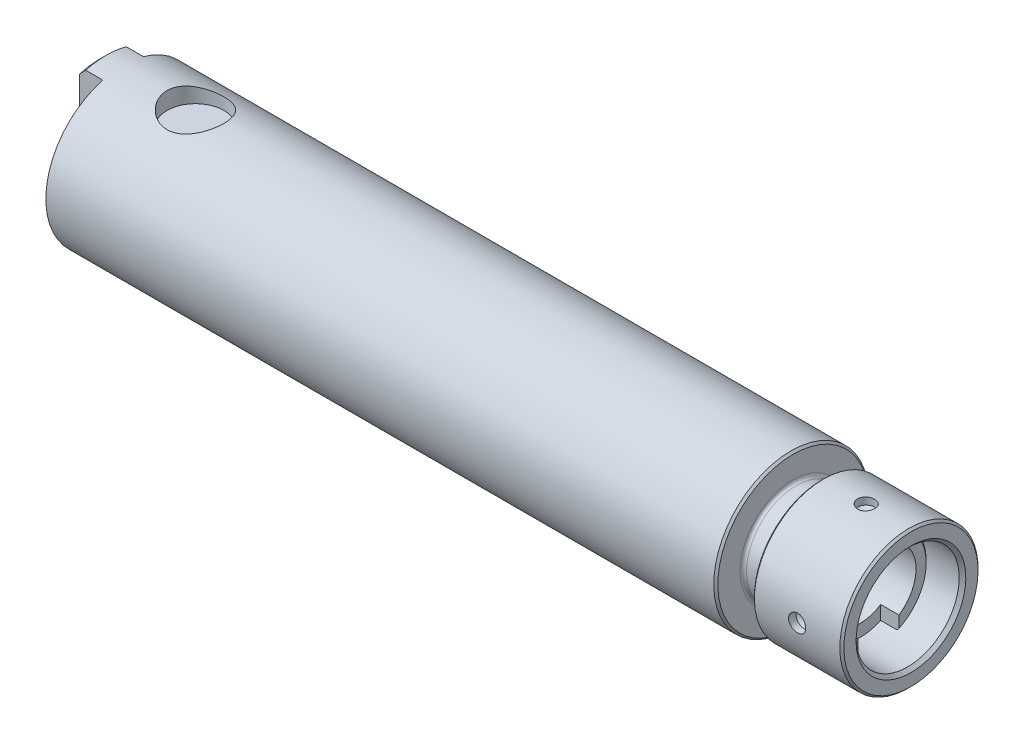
ISO-10303-21;
HEADER;
FILE_DESCRIPTION(('STEP AP214'),'2;1');
FILE_NAME('part.step','',(''),(''),'','','');
FILE_SCHEMA(('AUTOMOTIVE_DESIGN { 1 0 10303 214 1 1 1 1 }'));
ENDSEC;
DATA;
#1=APPLICATION_CONTEXT('core data for automotive mechanical design processes');
#2=APPLICATION_PROTOCOL_DEFINITION('international standard','automotive_design',2000,#1);
#3=PRODUCT_CONTEXT('',#1,'mechanical');
#4=PRODUCT('Part','Part','',(#3));
#5=PRODUCT_RELATED_PRODUCT_CATEGORY('part','',(#4));
#6=PRODUCT_DEFINITION_FORMATION('','',#4);
#7=PRODUCT_DEFINITION_CONTEXT('part definition',#1,'design');
#8=PRODUCT_DEFINITION('design','',#6,#7);
#9=PRODUCT_DEFINITION_SHAPE('','',#8);
#10=(LENGTH_UNIT() NAMED_UNIT(*) SI_UNIT(.MILLI.,.METRE.));
#11=(NAMED_UNIT(*) PLANE_ANGLE_UNIT() SI_UNIT($,.RADIAN.));
#12=(NAMED_UNIT(*) SI_UNIT($,.STERADIAN.) SOLID_ANGLE_UNIT());
#13=UNCERTAINTY_MEASURE_WITH_UNIT(LENGTH_MEASURE(1.E-05),#10,'distance_accuracy_value','');
#14=(GEOMETRIC_REPRESENTATION_CONTEXT(3) GLOBAL_UNCERTAINTY_ASSIGNED_CONTEXT((#13)) GLOBAL_UNIT_ASSIGNED_CONTEXT((#10,
#11,#12)) REPRESENTATION_CONTEXT('',''));
#15=CARTESIAN_POINT('',(0.,0.,0.));
#16=DIRECTION('',(0.,0.,1.));
#17=DIRECTION('',(1.,0.,0.));
#18=AXIS2_PLACEMENT_3D('',#15,#16,#17);
#19=CARTESIAN_POINT('',(176.,0.,0.));
#20=DIRECTION('',(1.,0.,0.));
#21=DIRECTION('',(0.,1.,0.));
#22=AXIS2_PLACEMENT_3D('',#19,#20,#21);
#23=CYLINDRICAL_SURFACE('',#22,17.);
#24=CARTESIAN_POINT('',(154.5,0.,0.));
#25=DIRECTION('',(1.,0.,0.));
#26=DIRECTION('',(0.,1.,0.));
#27=AXIS2_PLACEMENT_3D('',#24,#25,#26);
#28=CIRCLE('',#27,17.);
#29=CARTESIAN_POINT('',(154.5,17.,0.));
#30=VERTEX_POINT('',#29);
#31=EDGE_CURVE('E189',#30,#30,#28,.T.);
#32=ORIENTED_EDGE('',*,*,#31,.T.);
#33=EDGE_LOOP('',(#32));
#34=FACE_BOUND('',#33,.T.);
#35=CARTESIAN_POINT('',(165.,-2.1,16.8697954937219));
#36=CARTESIAN_POINT('',(164.88252590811,-2.09999499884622,16.8697971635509));
#37=CARTESIAN_POINT('',(164.764978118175,-2.09010948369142,16.8710358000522));
#38=CARTESIAN_POINT('',(164.533153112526,-2.05083005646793,16.8758547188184));
#39=CARTESIAN_POINT('',(164.418879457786,-2.02141568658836,16.8794374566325));
#40=CARTESIAN_POINT('',(164.196992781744,-1.94395823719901,16.8885327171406));
#41=CARTESIAN_POINT('',(164.089375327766,-1.89592771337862,16.894043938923));
#42=CARTESIAN_POINT('',(163.883748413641,-1.7826280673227,16.9063736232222));
#43=CARTESIAN_POINT('',(163.785737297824,-1.71736192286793,16.9131918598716));
#44=CARTESIAN_POINT('',(163.601548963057,-1.57106129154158,16.927409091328));
#45=CARTESIAN_POINT('',(163.515431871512,-1.4899513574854,16.9348107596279));
#46=CARTESIAN_POINT('',(163.357995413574,-1.3144279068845,16.9493368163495));
#47=CARTESIAN_POINT('',(163.286676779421,-1.22001373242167,16.9564611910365));
#48=CARTESIAN_POINT('',(163.160646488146,-1.02018451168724,16.9696572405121));
#49=CARTESIAN_POINT('',(163.105989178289,-0.914734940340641,16.9757254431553));
#50=CARTESIAN_POINT('',(163.015181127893,-0.696066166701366,16.9860960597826));
#51=CARTESIAN_POINT('',(162.979029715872,-0.582847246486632,16.9903985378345));
#52=CARTESIAN_POINT('',(162.926439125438,-0.352468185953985,16.9967341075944));
#53=CARTESIAN_POINT('',(162.909900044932,-0.235331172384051,16.9987786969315));
#54=CARTESIAN_POINT('',(162.8966940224,7.24128411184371E-05,17.0004073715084));
#55=CARTESIAN_POINT('',(162.90002631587,0.118338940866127,16.9999915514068));
#56=CARTESIAN_POINT('',(162.926388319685,0.351964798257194,16.9967555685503));
#57=CARTESIAN_POINT('',(162.949310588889,0.467336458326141,16.9939485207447));
#58=CARTESIAN_POINT('',(163.014033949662,0.692582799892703,16.9862602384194));
#59=CARTESIAN_POINT('',(163.05583539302,0.802457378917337,16.9813789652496));
#60=CARTESIAN_POINT('',(163.157244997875,1.01392363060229,16.9700681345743));
#61=CARTESIAN_POINT('',(163.21689972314,1.11549274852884,16.9636345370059));
#62=CARTESIAN_POINT('',(163.352288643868,1.30721886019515,16.9499389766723));
#63=CARTESIAN_POINT('',(163.428023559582,1.3973753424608,16.9426769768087));
#64=CARTESIAN_POINT('',(163.594024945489,1.56434805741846,16.928080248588));
#65=CARTESIAN_POINT('',(163.684385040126,1.64107122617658,16.9207453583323));
#66=CARTESIAN_POINT('',(163.876749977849,1.77827631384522,16.9068774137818));
#67=CARTESIAN_POINT('',(163.978754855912,1.83875818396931,16.9003443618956));
#68=CARTESIAN_POINT('',(164.191596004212,1.94176876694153,16.8888198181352));
#69=CARTESIAN_POINT('',(164.302435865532,1.98429013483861,16.8838289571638));
#70=CARTESIAN_POINT('',(164.529758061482,2.05009073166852,16.8759662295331));
#71=CARTESIAN_POINT('',(164.646240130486,2.07337086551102,16.8730942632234));
#72=CARTESIAN_POINT('',(164.880718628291,2.0999051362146,16.8698126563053));
#73=CARTESIAN_POINT('',(164.998700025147,2.10329019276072,16.8693869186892));
#74=CARTESIAN_POINT('',(165.233548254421,2.09028355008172,16.8710034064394));
#75=CARTESIAN_POINT('',(165.350415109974,2.0738922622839,16.8730455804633));
#76=CARTESIAN_POINT('',(165.579325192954,2.02190840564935,16.8793531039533));
#77=CARTESIAN_POINT('',(165.691383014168,1.9863791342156,16.8836111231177));
#78=CARTESIAN_POINT('',(165.907950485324,1.89719297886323,16.8938646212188));
#79=CARTESIAN_POINT('',(166.012459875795,1.84353547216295,16.8998601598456));
#80=CARTESIAN_POINT('',(166.21155645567,1.71929370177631,16.9129517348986));
#81=CARTESIAN_POINT('',(166.306089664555,1.6486235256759,16.9200532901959));
#82=CARTESIAN_POINT('',(166.481999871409,1.49248404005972,16.9345393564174));
#83=CARTESIAN_POINT('',(166.563376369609,1.40701416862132,16.9419238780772));
#84=CARTESIAN_POINT('',(166.711122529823,1.22312981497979,16.9561932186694));
#85=CARTESIAN_POINT('',(166.777406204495,1.12464597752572,16.9630750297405));
#86=CARTESIAN_POINT('',(166.892490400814,0.917866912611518,16.9755186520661));
#87=CARTESIAN_POINT('',(166.941291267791,0.809571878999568,16.9810804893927));
#88=CARTESIAN_POINT('',(167.019882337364,0.586531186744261,16.9902441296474));
#89=CARTESIAN_POINT('',(167.049722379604,0.471803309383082,16.993851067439));
#90=CARTESIAN_POINT('',(167.089706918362,0.238918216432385,16.9987198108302));
#91=CARTESIAN_POINT('',(167.099852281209,0.120761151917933,16.9999817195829));
#92=CARTESIAN_POINT('',(167.100143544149,-0.114788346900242,17.0000177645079));
#93=CARTESIAN_POINT('',(167.090422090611,-0.232180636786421,16.9988084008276));
#94=CARTESIAN_POINT('',(167.051536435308,-0.463649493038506,16.9940705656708));
#95=CARTESIAN_POINT('',(167.022372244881,-0.577726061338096,16.9905420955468));
#96=CARTESIAN_POINT('',(166.945470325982,-0.799308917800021,16.9815607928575));
#97=CARTESIAN_POINT('',(166.897738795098,-0.906817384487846,16.9761086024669));
#98=CARTESIAN_POINT('',(166.78507086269,-1.11231931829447,16.9638838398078));
#99=CARTESIAN_POINT('',(166.720134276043,-1.21031268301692,16.9571112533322));
#100=CARTESIAN_POINT('',(166.574408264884,-1.39468060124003,16.9429478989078));
#101=CARTESIAN_POINT('',(166.493520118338,-1.48097684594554,16.9355534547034));
#102=CARTESIAN_POINT('',(166.318391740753,-1.63882309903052,16.921009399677));
#103=CARTESIAN_POINT('',(166.224148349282,-1.71036960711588,16.9138598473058));
#104=CARTESIAN_POINT('',(166.024577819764,-1.83691538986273,16.9005863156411));
#105=CARTESIAN_POINT('',(165.919210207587,-1.8918512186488,16.8944663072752));
#106=CARTESIAN_POINT('',(165.700729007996,-1.98317097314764,16.883991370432));
#107=CARTESIAN_POINT('',(165.587624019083,-2.01957512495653,16.8796345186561));
#108=CARTESIAN_POINT('',(165.394941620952,-2.06405903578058,16.8742397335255));
#109=CARTESIAN_POINT('',(165.316580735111,-2.07751757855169,16.8725814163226));
#110=CARTESIAN_POINT('',(165.158824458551,-2.09548971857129,16.8703587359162));
#111=CARTESIAN_POINT('',(165.07942907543,-2.1000033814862,16.8697943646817));
#112=CARTESIAN_POINT('',(165.,-2.1,16.8697954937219));
#113=B_SPLINE_CURVE_WITH_KNOTS('',3,(#35,#36,#37,#38,#39,#40,#41,#42,#43,#44,#45,#46,#47,#48,
#49,#50,#51,#52,#53,#54,#55,#56,#57,#58,#59,#60,#61,#62,#63,#64,#65,#66,#67,#68,#69,#70,#71,#72,
#73,#74,#75,#76,#77,#78,#79,#80,#81,#82,#83,#84,#85,#86,#87,#88,#89,#90,#91,#92,#93,#94,#95,#96,
#97,#98,#99,#100,#101,#102,#103,#104,#105,#106,#107,#108,#109,#110,#111,#112),.UNSPECIFIED.,.T.,
.F.,(4,2,2,2,2,2,2,2,2,2,2,2,2,2,2,2,2,2,2,2,2,2,2,2,2,2,2,2,2,2,2,2,2,2,2,2,2,2,4),(0.,
0.352132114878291,0.704633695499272,1.05689794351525,1.40910137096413,1.76302476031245,
2.11696565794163,2.47204901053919,2.82711947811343,3.180373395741,3.53361372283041,
3.88492904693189,4.23625091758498,4.58849718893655,4.9407592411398,5.29537266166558,
5.64998714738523,6.00474651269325,6.35948919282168,6.71189484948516,7.06429317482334,
7.41553306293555,7.76678501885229,8.11984941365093,8.47292721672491,8.82796888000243,
9.183003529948,9.53710104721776,9.8911829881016,10.2429085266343,10.5946338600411,
10.9462418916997,11.2978537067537,11.6517140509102,12.0056582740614,12.3609378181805,
12.7158287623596,12.9539215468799,13.1920125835),.UNSPECIFIED.);
#114=CARTESIAN_POINT('',(165.,-2.1,16.8697954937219));
#115=VERTEX_POINT('',#114);
#116=EDGE_CURVE('E386',#115,#115,#113,.T.);
#117=ORIENTED_EDGE('',*,*,#116,.T.);
#118=EDGE_LOOP('',(#117));
#119=FACE_BOUND('',#118,.T.);
#120=CARTESIAN_POINT('',(162.9,17.,0.));
#121=CARTESIAN_POINT('',(162.900004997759,16.9999983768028,-0.117477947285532));
#122=CARTESIAN_POINT('',(162.909891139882,16.9987693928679,-0.235029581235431));
#123=CARTESIAN_POINT('',(162.949173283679,16.9939849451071,-0.466862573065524));
#124=CARTESIAN_POINT('',(162.978589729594,16.9904270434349,-0.581140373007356));
#125=CARTESIAN_POINT('',(163.056053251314,16.9813856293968,-0.803035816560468));
#126=CARTESIAN_POINT('',(163.104087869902,16.9759034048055,-0.910657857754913));
#127=CARTESIAN_POINT('',(163.217397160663,16.9636232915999,-1.11629246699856));
#128=CARTESIAN_POINT('',(163.2826688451,16.9568256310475,-1.21430669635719));
#129=CARTESIAN_POINT('',(163.428975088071,16.9426328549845,-1.39849155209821));
#130=CARTESIAN_POINT('',(163.510083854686,16.9352350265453,-1.48460302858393));
#131=CARTESIAN_POINT('',(163.685602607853,16.9206976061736,-1.6420286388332));
#132=CARTESIAN_POINT('',(163.780013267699,16.9135580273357,-1.71334202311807));
#133=CARTESIAN_POINT('',(163.979839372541,16.9003187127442,-1.83936679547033));
#134=CARTESIAN_POINT('',(164.085289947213,16.8942224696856,-1.89402288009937));
#135=CARTESIAN_POINT('',(164.303960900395,16.8837957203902,-1.98482838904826));
#136=CARTESIAN_POINT('',(164.417180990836,16.8794651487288,-2.02097849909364));
#137=CARTESIAN_POINT('',(164.647563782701,16.8730858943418,-2.07356641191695));
#138=CARTESIAN_POINT('',(164.764703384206,16.8710256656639,-2.09010398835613));
#139=CARTESIAN_POINT('',(165.000112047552,16.8693849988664,-2.10330610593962));
#140=CARTESIAN_POINT('',(165.118381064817,16.8698044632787,-2.09997142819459));
#141=CARTESIAN_POINT('',(165.351996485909,16.8730652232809,-2.07360562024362));
#142=CARTESIAN_POINT('',(165.467355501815,16.8758930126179,-2.05068433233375));
#143=CARTESIAN_POINT('',(165.692577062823,16.8836307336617,-1.98596730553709));
#144=CARTESIAN_POINT('',(165.802439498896,16.8885407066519,-1.9441711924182));
#145=CARTESIAN_POINT('',(166.013890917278,16.8999048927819,-1.84277268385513));
#146=CARTESIAN_POINT('',(166.115456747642,16.9063632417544,-1.78312249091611));
#147=CARTESIAN_POINT('',(166.307178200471,16.9200932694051,-1.64774327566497));
#148=CARTESIAN_POINT('',(166.397333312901,16.9273649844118,-1.57201353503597));
#149=CARTESIAN_POINT('',(166.564311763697,16.9419624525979,-1.40601585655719));
#150=CARTESIAN_POINT('',(166.641040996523,16.9492882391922,-1.31565322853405));
#151=CARTESIAN_POINT('',(166.778257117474,16.9631224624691,-1.12328104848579));
#152=CARTESIAN_POINT('',(166.838743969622,16.9696308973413,-1.02127147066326));
#153=CARTESIAN_POINT('',(166.941758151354,16.98110099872,-0.808428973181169));
#154=CARTESIAN_POINT('',(166.984279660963,16.9860621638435,-0.697593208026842));
#155=CARTESIAN_POINT('',(167.050081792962,16.9938741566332,-0.470279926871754));
#156=CARTESIAN_POINT('',(167.073363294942,16.9967250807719,-0.353802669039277));
#157=CARTESIAN_POINT('',(167.099902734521,16.9999828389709,-0.119326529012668));
#158=CARTESIAN_POINT('',(167.103290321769,17.0004054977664,-0.00134253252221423));
#159=CARTESIAN_POINT('',(167.090287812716,16.9988018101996,0.233511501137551));
#160=CARTESIAN_POINT('',(167.07389812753,16.9967755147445,0.350381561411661));
#161=CARTESIAN_POINT('',(167.021914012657,16.9905114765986,0.579308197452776));
#162=CARTESIAN_POINT('',(166.986381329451,16.9862808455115,0.691379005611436));
#163=CARTESIAN_POINT('',(166.897184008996,16.9760818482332,0.907970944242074));
#164=CARTESIAN_POINT('',(166.843518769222,16.9701134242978,1.01249182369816));
#165=CARTESIAN_POINT('',(166.719265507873,16.957064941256,1.21159642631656));
#166=CARTESIAN_POINT('',(166.648593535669,16.9499794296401,1.30612739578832));
#167=CARTESIAN_POINT('',(166.492451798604,16.9355066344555,1.48203224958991));
#168=CARTESIAN_POINT('',(166.406981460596,16.9281193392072,1.56340562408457));
#169=CARTESIAN_POINT('',(166.223098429,16.9138268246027,1.71114475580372));
#170=CARTESIAN_POINT('',(166.124616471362,16.9069245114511,1.77742462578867));
#171=CARTESIAN_POINT('',(165.917842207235,16.894431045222,1.89250215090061));
#172=CARTESIAN_POINT('',(165.809550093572,16.8888398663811,1.94130014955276));
#173=CARTESIAN_POINT('',(165.586507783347,16.8796214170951,2.01988938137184));
#174=CARTESIAN_POINT('',(165.471774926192,16.875989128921,2.04972921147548));
#175=CARTESIAN_POINT('',(165.238879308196,16.8710852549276,2.08971163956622));
#176=CARTESIAN_POINT('',(165.12071670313,16.8698135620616,2.09985513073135));
#177=CARTESIAN_POINT('',(164.885170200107,16.869777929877,2.10014081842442));
#178=CARTESIAN_POINT('',(164.767786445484,16.8709970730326,2.09041794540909));
#179=CARTESIAN_POINT('',(164.536335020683,16.8757693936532,2.05153244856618));
#180=CARTESIAN_POINT('',(164.422267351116,16.8793225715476,2.02236982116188));
#181=CARTESIAN_POINT('',(164.200702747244,16.8883574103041,1.94547451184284));
#182=CARTESIAN_POINT('',(164.093203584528,16.8938384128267,1.89774816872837));
#183=CARTESIAN_POINT('',(163.887718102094,16.9061124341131,1.78509350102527));
#184=CARTESIAN_POINT('',(163.789731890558,16.9129054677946,1.72016498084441));
#185=CARTESIAN_POINT('',(163.605363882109,16.9270934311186,1.57444797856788));
#186=CARTESIAN_POINT('',(163.519061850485,16.9344919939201,1.49355892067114));
#187=CARTESIAN_POINT('',(163.36120434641,16.9490252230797,1.3184263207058));
#188=CARTESIAN_POINT('',(163.28965235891,16.9561598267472,1.22417963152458));
#189=CARTESIAN_POINT('',(163.163100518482,16.9693904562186,1.02460628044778));
#190=CARTESIAN_POINT('',(163.108163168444,16.9754825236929,0.919239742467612));
#191=CARTESIAN_POINT('',(163.016840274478,16.9859014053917,0.70076079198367));
#192=CARTESIAN_POINT('',(162.980434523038,16.9902301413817,0.587656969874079));
#193=CARTESIAN_POINT('',(162.935946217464,16.9955882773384,0.394970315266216));
#194=CARTESIAN_POINT('',(162.92248569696,16.9972346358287,0.31660369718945));
#195=CARTESIAN_POINT('',(162.904510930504,16.9994410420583,0.158835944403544));
#196=CARTESIAN_POINT('',(162.899996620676,17.0000010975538,0.079434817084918));
#197=CARTESIAN_POINT('',(162.9,17.,0.));
#198=B_SPLINE_CURVE_WITH_KNOTS('',3,(#120,#121,#122,#123,#124,#125,#126,#127,#128,#129,#130,
#131,#132,#133,#134,#135,#136,#137,#138,#139,#140,#141,#142,#143,#144,#145,#146,#147,#148,#149,
#150,#151,#152,#153,#154,#155,#156,#157,#158,#159,#160,#161,#162,#163,#164,#165,#166,#167,#168,
#169,#170,#171,#172,#173,#174,#175,#176,#177,#178,#179,#180,#181,#182,#183,#184,#185,#186,#187,
#188,#189,#190,#191,#192,#193,#194,#195,#196,#197),.UNSPECIFIED.,.T.,.F.,(4,2,2,2,2,2,2,2,2,2,2,
2,2,2,2,2,2,2,2,2,2,2,2,2,2,2,2,2,2,2,2,2,2,2,2,2,2,2,4),(0.,0.352143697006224,
0.704656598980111,1.05693404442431,1.40915046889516,1.76305869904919,2.11698484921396,
2.47207357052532,2.82714913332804,3.18041048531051,3.53365795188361,3.88493730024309,
4.23622361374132,4.58845890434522,4.94070993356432,5.29533885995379,5.64996857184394,
6.00471308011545,6.35944136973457,6.71185528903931,7.06426188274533,7.4155385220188,
7.76682683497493,8.11988613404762,8.47295911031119,8.82799360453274,9.18302112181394,
9.53713485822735,9.89123253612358,10.2429332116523,10.5946339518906,10.9462147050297,
11.2977994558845,11.6516748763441,12.005633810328,12.3609082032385,12.7157943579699,
12.953904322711,13.1920125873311),.UNSPECIFIED.);
#199=CARTESIAN_POINT('',(162.9,17.,0.));
#200=VERTEX_POINT('',#199);
#201=EDGE_CURVE('E379',#200,#200,#198,.T.);
#202=ORIENTED_EDGE('',*,*,#201,.T.);
#203=EDGE_LOOP('',(#202));
#204=FACE_BOUND('',#203,.T.);
#205=CARTESIAN_POINT('',(175.5,0.,0.));
#206=DIRECTION('',(1.,0.,0.));
#207=DIRECTION('',(0.,1.,0.));
#208=AXIS2_PLACEMENT_3D('',#205,#206,#207);
#209=CIRCLE('',#208,17.);
#210=CARTESIAN_POINT('',(175.5,17.,0.));
#211=VERTEX_POINT('',#210);
#212=EDGE_CURVE('E192',#211,#211,#209,.T.);
#213=ORIENTED_EDGE('',*,*,#212,.F.);
#214=EDGE_LOOP('',(#213));
#215=FACE_BOUND('',#214,.T.);
#216=CARTESIAN_POINT('',(165.,-2.1,-16.8697954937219));
#217=CARTESIAN_POINT('',(165.11747409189,-2.09999499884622,-16.8697971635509));
#218=CARTESIAN_POINT('',(165.235021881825,-2.09010948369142,-16.8710358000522));
#219=CARTESIAN_POINT('',(165.466846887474,-2.05083005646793,-16.8758547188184));
#220=CARTESIAN_POINT('',(165.581120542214,-2.02141568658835,-16.8794374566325));
#221=CARTESIAN_POINT('',(165.803007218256,-1.94395823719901,-16.8885327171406));
#222=CARTESIAN_POINT('',(165.910624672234,-1.89592771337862,-16.894043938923));
#223=CARTESIAN_POINT('',(166.116251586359,-1.7826280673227,-16.9063736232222));
#224=CARTESIAN_POINT('',(166.214262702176,-1.71736192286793,-16.9131918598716));
#225=CARTESIAN_POINT('',(166.398451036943,-1.57106129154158,-16.927409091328));
#226=CARTESIAN_POINT('',(166.484568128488,-1.4899513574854,-16.9348107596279));
#227=CARTESIAN_POINT('',(166.642004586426,-1.3144279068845,-16.9493368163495));
#228=CARTESIAN_POINT('',(166.713323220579,-1.22001373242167,-16.9564611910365));
#229=CARTESIAN_POINT('',(166.839353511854,-1.02018451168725,-16.9696572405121));
#230=CARTESIAN_POINT('',(166.894010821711,-0.91473494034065,-16.9757254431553));
#231=CARTESIAN_POINT('',(166.984818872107,-0.696066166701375,-16.9860960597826));
#232=CARTESIAN_POINT('',(167.020970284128,-0.582847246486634,-16.9903985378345));
#233=CARTESIAN_POINT('',(167.073560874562,-0.352468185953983,-16.9967341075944));
#234=CARTESIAN_POINT('',(167.090099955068,-0.23533117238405,-16.9987786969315));
#235=CARTESIAN_POINT('',(167.1033059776,7.24128411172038E-05,-17.0004073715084));
#236=CARTESIAN_POINT('',(167.09997368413,0.118338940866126,-16.9999915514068));
#237=CARTESIAN_POINT('',(167.073611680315,0.351964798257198,-16.9967555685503));
#238=CARTESIAN_POINT('',(167.050689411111,0.467336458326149,-16.9939485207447));
#239=CARTESIAN_POINT('',(166.985966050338,0.692582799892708,-16.9862602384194));
#240=CARTESIAN_POINT('',(166.94416460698,0.802457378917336,-16.9813789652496));
#241=CARTESIAN_POINT('',(166.842755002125,1.0139236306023,-16.9700681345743));
#242=CARTESIAN_POINT('',(166.78310027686,1.11549274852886,-16.9636345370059));
#243=CARTESIAN_POINT('',(166.647711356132,1.30721886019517,-16.9499389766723));
#244=CARTESIAN_POINT('',(166.571976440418,1.39737534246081,-16.9426769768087));
#245=CARTESIAN_POINT('',(166.405975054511,1.56434805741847,-16.928080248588));
#246=CARTESIAN_POINT('',(166.315614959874,1.6410712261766,-16.9207453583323));
#247=CARTESIAN_POINT('',(166.123250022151,1.77827631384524,-16.9068774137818));
#248=CARTESIAN_POINT('',(166.021245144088,1.83875818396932,-16.9003443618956));
#249=CARTESIAN_POINT('',(165.808403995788,1.94176876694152,-16.8888198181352));
#250=CARTESIAN_POINT('',(165.697564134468,1.98429013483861,-16.8838289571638));
#251=CARTESIAN_POINT('',(165.470241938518,2.05009073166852,-16.8759662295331));
#252=CARTESIAN_POINT('',(165.353759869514,2.07337086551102,-16.8730942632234));
#253=CARTESIAN_POINT('',(165.119281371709,2.0999051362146,-16.8698126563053));
#254=CARTESIAN_POINT('',(165.001299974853,2.10329019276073,-16.8693869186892));
#255=CARTESIAN_POINT('',(164.766451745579,2.09028355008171,-16.8710034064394));
#256=CARTESIAN_POINT('',(164.649584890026,2.07389226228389,-16.8730455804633));
#257=CARTESIAN_POINT('',(164.420674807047,2.02190840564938,-16.8793531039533));
#258=CARTESIAN_POINT('',(164.308616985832,1.9863791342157,-16.8836111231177));
#259=CARTESIAN_POINT('',(164.092049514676,1.89719297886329,-16.8938646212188));
#260=CARTESIAN_POINT('',(163.987540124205,1.8435354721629,-16.8998601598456));
#261=CARTESIAN_POINT('',(163.78844354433,1.71929370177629,-16.9129517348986));
#262=CARTESIAN_POINT('',(163.693910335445,1.64862352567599,-16.9200532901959));
#263=CARTESIAN_POINT('',(163.518000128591,1.49248404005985,-16.9345393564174));
#264=CARTESIAN_POINT('',(163.436623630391,1.40701416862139,-16.9419238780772));
#265=CARTESIAN_POINT('',(163.288877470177,1.22312981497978,-16.9561932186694));
#266=CARTESIAN_POINT('',(163.222593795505,1.12464597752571,-16.9630750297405));
#267=CARTESIAN_POINT('',(163.107509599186,0.917866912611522,-16.9755186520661));
#268=CARTESIAN_POINT('',(163.058708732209,0.809571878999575,-16.9810804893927));
#269=CARTESIAN_POINT('',(162.980117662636,0.586531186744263,-16.9902441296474));
#270=CARTESIAN_POINT('',(162.950277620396,0.471803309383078,-16.993851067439));
#271=CARTESIAN_POINT('',(162.910293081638,0.238918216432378,-16.9987198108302));
#272=CARTESIAN_POINT('',(162.900147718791,0.120761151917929,-16.9999817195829));
#273=CARTESIAN_POINT('',(162.899856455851,-0.11478834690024,-17.0000177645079));
#274=CARTESIAN_POINT('',(162.909577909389,-0.232180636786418,-16.9988084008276));
#275=CARTESIAN_POINT('',(162.948463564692,-0.463649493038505,-16.9940705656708));
#276=CARTESIAN_POINT('',(162.977627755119,-0.577726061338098,-16.9905420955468));
#277=CARTESIAN_POINT('',(163.054529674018,-0.799308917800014,-16.9815607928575));
#278=CARTESIAN_POINT('',(163.102261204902,-0.906817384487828,-16.9761086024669));
#279=CARTESIAN_POINT('',(163.21492913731,-1.11231931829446,-16.9638838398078));
#280=CARTESIAN_POINT('',(163.279865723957,-1.21031268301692,-16.9571112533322));
#281=CARTESIAN_POINT('',(163.425591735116,-1.39468060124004,-16.9429478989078));
#282=CARTESIAN_POINT('',(163.506479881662,-1.48097684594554,-16.9355534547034));
#283=CARTESIAN_POINT('',(163.681608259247,-1.63882309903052,-16.921009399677));
#284=CARTESIAN_POINT('',(163.775851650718,-1.71036960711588,-16.9138598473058));
#285=CARTESIAN_POINT('',(163.975422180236,-1.83691538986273,-16.9005863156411));
#286=CARTESIAN_POINT('',(164.080789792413,-1.89185121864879,-16.8944663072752));
#287=CARTESIAN_POINT('',(164.299270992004,-1.98317097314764,-16.883991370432));
#288=CARTESIAN_POINT('',(164.412375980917,-2.01957512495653,-16.8796345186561));
#289=CARTESIAN_POINT('',(164.605058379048,-2.06405903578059,-16.8742397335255));
#290=CARTESIAN_POINT('',(164.683419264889,-2.07751757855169,-16.8725814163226));
#291=CARTESIAN_POINT('',(164.841175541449,-2.09548971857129,-16.8703587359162));
#292=CARTESIAN_POINT('',(164.92057092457,-2.1000033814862,-16.8697943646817));
#293=CARTESIAN_POINT('',(165.,-2.1,-16.8697954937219));
#294=B_SPLINE_CURVE_WITH_KNOTS('',3,(#216,#217,#218,#219,#220,#221,#222,#223,#224,#225,#226,
#227,#228,#229,#230,#231,#232,#233,#234,#235,#236,#237,#238,#239,#240,#241,#242,#243,#244,#245,
#246,#247,#248,#249,#250,#251,#252,#253,#254,#255,#256,#257,#258,#259,#260,#261,#262,#263,#264,
#265,#266,#267,#268,#269,#270,#271,#272,#273,#274,#275,#276,#277,#278,#279,#280,#281,#282,#283,
#284,#285,#286,#287,#288,#289,#290,#291,#292,#293),.UNSPECIFIED.,.T.,.F.,(4,2,2,2,2,2,2,2,2,2,2,
2,2,2,2,2,2,2,2,2,2,2,2,2,2,2,2,2,2,2,2,2,2,2,2,2,2,2,4),(0.,0.352132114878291,
0.704633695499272,1.05689794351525,1.40910137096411,1.76302476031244,2.11696565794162,
2.47204901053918,2.82711947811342,3.180373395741,3.53361372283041,3.88492904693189,
4.23625091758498,4.58849718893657,4.9407592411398,5.29537266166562,5.64998714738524,
6.00474651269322,6.35948919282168,6.71189484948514,7.06429317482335,7.41553306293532,
7.76678501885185,8.11984941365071,8.47292721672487,8.82796888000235,9.18300352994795,
9.53710104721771,9.89118298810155,10.2429085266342,10.5946338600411,10.9462418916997,
11.2978537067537,11.6517140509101,12.0056582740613,12.3609378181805,12.7158287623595,
12.9539215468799,13.1920125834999),.UNSPECIFIED.);
#295=CARTESIAN_POINT('',(165.,-2.1,-16.8697954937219));
#296=VERTEX_POINT('',#295);
#297=EDGE_CURVE('E27',#296,#296,#294,.T.);
#298=ORIENTED_EDGE('',*,*,#297,.T.);
#299=EDGE_LOOP('',(#298));
#300=FACE_BOUND('',#299,.T.);
#301=CARTESIAN_POINT('',(162.9,-17.,0.));
#302=CARTESIAN_POINT('',(162.900004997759,-16.9999983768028,0.117477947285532));
#303=CARTESIAN_POINT('',(162.909891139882,-16.9987693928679,0.235029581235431));
#304=CARTESIAN_POINT('',(162.949173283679,-16.9939849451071,0.466862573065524));
#305=CARTESIAN_POINT('',(162.978589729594,-16.9904270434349,0.581140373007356));
#306=CARTESIAN_POINT('',(163.056053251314,-16.9813856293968,0.803035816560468));
#307=CARTESIAN_POINT('',(163.104087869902,-16.9759034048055,0.910657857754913));
#308=CARTESIAN_POINT('',(163.217397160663,-16.9636232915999,1.11629246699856));
#309=CARTESIAN_POINT('',(163.2826688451,-16.9568256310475,1.21430669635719));
#310=CARTESIAN_POINT('',(163.428975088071,-16.9426328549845,1.39849155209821));
#311=CARTESIAN_POINT('',(163.510083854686,-16.9352350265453,1.48460302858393));
#312=CARTESIAN_POINT('',(163.685602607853,-16.9206976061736,1.6420286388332));
#313=CARTESIAN_POINT('',(163.780013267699,-16.9135580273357,1.71334202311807));
#314=CARTESIAN_POINT('',(163.979839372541,-16.9003187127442,1.83936679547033));
#315=CARTESIAN_POINT('',(164.085289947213,-16.8942224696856,1.89402288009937));
#316=CARTESIAN_POINT('',(164.303960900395,-16.8837957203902,1.98482838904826));
#317=CARTESIAN_POINT('',(164.417180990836,-16.8794651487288,2.02097849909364));
#318=CARTESIAN_POINT('',(164.647563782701,-16.8730858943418,2.07356641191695));
#319=CARTESIAN_POINT('',(164.764703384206,-16.8710256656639,2.09010398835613));
#320=CARTESIAN_POINT('',(165.000112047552,-16.8693849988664,2.10330610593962));
#321=CARTESIAN_POINT('',(165.118381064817,-16.8698044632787,2.09997142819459));
#322=CARTESIAN_POINT('',(165.351996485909,-16.8730652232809,2.07360562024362));
#323=CARTESIAN_POINT('',(165.467355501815,-16.8758930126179,2.05068433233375));
#324=CARTESIAN_POINT('',(165.692577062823,-16.8836307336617,1.98596730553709));
#325=CARTESIAN_POINT('',(165.802439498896,-16.8885407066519,1.9441711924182));
#326=CARTESIAN_POINT('',(166.013890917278,-16.8999048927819,1.84277268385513));
#327=CARTESIAN_POINT('',(166.115456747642,-16.9063632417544,1.78312249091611));
#328=CARTESIAN_POINT('',(166.307178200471,-16.9200932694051,1.64774327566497));
#329=CARTESIAN_POINT('',(166.397333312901,-16.9273649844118,1.57201353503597));
#330=CARTESIAN_POINT('',(166.564311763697,-16.9419624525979,1.40601585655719));
#331=CARTESIAN_POINT('',(166.641040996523,-16.9492882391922,1.31565322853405));
#332=CARTESIAN_POINT('',(166.778257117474,-16.9631224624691,1.12328104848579));
#333=CARTESIAN_POINT('',(166.838743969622,-16.9696308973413,1.02127147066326));
#334=CARTESIAN_POINT('',(166.941758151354,-16.98110099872,0.808428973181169));
#335=CARTESIAN_POINT('',(166.984279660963,-16.9860621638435,0.697593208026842));
#336=CARTESIAN_POINT('',(167.050081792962,-16.9938741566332,0.470279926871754));
#337=CARTESIAN_POINT('',(167.073363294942,-16.9967250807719,0.353802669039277));
#338=CARTESIAN_POINT('',(167.099902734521,-16.9999828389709,0.119326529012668));
#339=CARTESIAN_POINT('',(167.103290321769,-17.0004054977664,0.00134253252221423));
#340=CARTESIAN_POINT('',(167.090287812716,-16.9988018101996,-0.233511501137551));
#341=CARTESIAN_POINT('',(167.07389812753,-16.9967755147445,-0.350381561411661));
#342=CARTESIAN_POINT('',(167.021914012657,-16.9905114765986,-0.579308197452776));
#343=CARTESIAN_POINT('',(166.986381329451,-16.9862808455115,-0.691379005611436));
#344=CARTESIAN_POINT('',(166.897184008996,-16.9760818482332,-0.907970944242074));
#345=CARTESIAN_POINT('',(166.843518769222,-16.9701134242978,-1.01249182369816));
#346=CARTESIAN_POINT('',(166.719265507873,-16.957064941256,-1.21159642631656));
#347=CARTESIAN_POINT('',(166.648593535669,-16.9499794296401,-1.30612739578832));
#348=CARTESIAN_POINT('',(166.492451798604,-16.9355066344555,-1.48203224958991));
#349=CARTESIAN_POINT('',(166.406981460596,-16.9281193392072,-1.56340562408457));
#350=CARTESIAN_POINT('',(166.223098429,-16.9138268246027,-1.71114475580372));
#351=CARTESIAN_POINT('',(166.124616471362,-16.9069245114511,-1.77742462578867));
#352=CARTESIAN_POINT('',(165.917842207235,-16.894431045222,-1.89250215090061));
#353=CARTESIAN_POINT('',(165.809550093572,-16.8888398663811,-1.94130014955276));
#354=CARTESIAN_POINT('',(165.586507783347,-16.8796214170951,-2.01988938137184));
#355=CARTESIAN_POINT('',(165.471774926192,-16.875989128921,-2.04972921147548));
#356=CARTESIAN_POINT('',(165.238879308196,-16.8710852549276,-2.08971163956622));
#357=CARTESIAN_POINT('',(165.12071670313,-16.8698135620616,-2.09985513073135));
#358=CARTESIAN_POINT('',(164.885170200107,-16.869777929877,-2.10014081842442));
#359=CARTESIAN_POINT('',(164.767786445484,-16.8709970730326,-2.09041794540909));
#360=CARTESIAN_POINT('',(164.536335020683,-16.8757693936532,-2.05153244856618));
#361=CARTESIAN_POINT('',(164.422267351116,-16.8793225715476,-2.02236982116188));
#362=CARTESIAN_POINT('',(164.200702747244,-16.8883574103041,-1.94547451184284));
#363=CARTESIAN_POINT('',(164.093203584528,-16.8938384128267,-1.89774816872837));
#364=CARTESIAN_POINT('',(163.887718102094,-16.9061124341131,-1.78509350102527));
#365=CARTESIAN_POINT('',(163.789731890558,-16.9129054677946,-1.72016498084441));
#366=CARTESIAN_POINT('',(163.605363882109,-16.9270934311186,-1.57444797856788));
#367=CARTESIAN_POINT('',(163.519061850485,-16.9344919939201,-1.49355892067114));
#368=CARTESIAN_POINT('',(163.36120434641,-16.9490252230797,-1.3184263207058));
#369=CARTESIAN_POINT('',(163.28965235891,-16.9561598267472,-1.22417963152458));
#370=CARTESIAN_POINT('',(163.163100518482,-16.9693904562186,-1.02460628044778));
#371=CARTESIAN_POINT('',(163.108163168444,-16.9754825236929,-0.919239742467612));
#372=CARTESIAN_POINT('',(163.016840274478,-16.9859014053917,-0.70076079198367));
#373=CARTESIAN_POINT('',(162.980434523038,-16.9902301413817,-0.587656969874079));
#374=CARTESIAN_POINT('',(162.935946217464,-16.9955882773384,-0.394970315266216));
#375=CARTESIAN_POINT('',(162.92248569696,-16.9972346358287,-0.31660369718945));
#376=CARTESIAN_POINT('',(162.904510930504,-16.9994410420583,-0.158835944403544));
#377=CARTESIAN_POINT('',(162.899996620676,-17.0000010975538,-0.079434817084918));
#378=CARTESIAN_POINT('',(162.9,-17.,0.));
#379=B_SPLINE_CURVE_WITH_KNOTS('',3,(#301,#302,#303,#304,#305,#306,#307,#308,#309,#310,#311,
#312,#313,#314,#315,#316,#317,#318,#319,#320,#321,#322,#323,#324,#325,#326,#327,#328,#329,#330,
#331,#332,#333,#334,#335,#336,#337,#338,#339,#340,#341,#342,#343,#344,#345,#346,#347,#348,#349,
#350,#351,#352,#353,#354,#355,#356,#357,#358,#359,#360,#361,#362,#363,#364,#365,#366,#367,#368,
#369,#370,#371,#372,#373,#374,#375,#376,#377,#378),.UNSPECIFIED.,.T.,.F.,(4,2,2,2,2,2,2,2,2,2,2,
2,2,2,2,2,2,2,2,2,2,2,2,2,2,2,2,2,2,2,2,2,2,2,2,2,2,2,4),(0.,0.352143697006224,
0.704656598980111,1.05693404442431,1.40915046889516,1.76305869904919,2.11698484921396,
2.47207357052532,2.82714913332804,3.18041048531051,3.53365795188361,3.88493730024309,
4.23622361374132,4.58845890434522,4.94070993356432,5.29533885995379,5.64996857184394,
6.00471308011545,6.35944136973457,6.71185528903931,7.06426188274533,7.4155385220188,
7.76682683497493,8.11988613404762,8.47295911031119,8.82799360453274,9.18302112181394,
9.53713485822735,9.89123253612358,10.2429332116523,10.5946339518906,10.9462147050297,
11.2977994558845,11.6516748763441,12.005633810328,12.3609082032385,12.7157943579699,
12.953904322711,13.1920125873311),.UNSPECIFIED.);
#380=CARTESIAN_POINT('',(162.9,-17.,0.));
#381=VERTEX_POINT('',#380);
#382=EDGE_CURVE('E9',#381,#381,#379,.T.);
#383=ORIENTED_EDGE('',*,*,#382,.T.);
#384=EDGE_LOOP('',(#383));
#385=FACE_BOUND('',#384,.T.);
#386=ADVANCED_FACE('F14',(#34,#119,#204,#215,#300,#385),#23,.T.);
#387=CARTESIAN_POINT('',(168.,0.,0.));
#388=DIRECTION('',(1.,0.,0.));
#389=DIRECTION('',(0.,1.,0.));
#390=AXIS2_PLACEMENT_3D('',#387,#388,#389);
#391=CYLINDRICAL_SURFACE('',#390,19.);
#392=CARTESIAN_POINT('',(146.5,0.,0.));
#393=DIRECTION('',(1.,0.,0.));
#394=DIRECTION('',(0.,1.,0.));
#395=AXIS2_PLACEMENT_3D('',#392,#393,#394);
#396=CIRCLE('',#395,19.);
#397=CARTESIAN_POINT('',(146.5,19.,0.));
#398=VERTEX_POINT('',#397);
#399=EDGE_CURVE('E559',#398,#398,#396,.T.);
#400=ORIENTED_EDGE('',*,*,#399,.F.);
#401=EDGE_LOOP('',(#400));
#402=FACE_BOUND('',#401,.T.);
#403=CARTESIAN_POINT('',(-7.,-19.,0.));
#404=CARTESIAN_POINT('',(-7.00000073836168,-19.0000005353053,-0.189735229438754));
#405=CARTESIAN_POINT('',(-6.99227992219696,-18.9971517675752,-0.379460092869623));
#406=CARTESIAN_POINT('',(-6.96147185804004,-18.9858337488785,-0.757558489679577));
#407=CARTESIAN_POINT('',(-6.93837931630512,-18.9773625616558,-0.945931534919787));
#408=CARTESIAN_POINT('',(-6.87706807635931,-18.9550323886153,-1.3197721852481));
#409=CARTESIAN_POINT('',(-6.83885699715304,-18.9411761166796,-1.50524120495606));
#410=CARTESIAN_POINT('',(-6.74765745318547,-18.9084391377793,-1.87212834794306));
#411=CARTESIAN_POINT('',(-6.69466326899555,-18.8895564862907,-2.05354487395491));
#412=CARTESIAN_POINT('',(-6.57452217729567,-18.8473125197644,-2.41061437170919));
#413=CARTESIAN_POINT('',(-6.50740816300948,-18.8239616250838,-2.58627966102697));
#414=CARTESIAN_POINT('',(-6.35949041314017,-18.7733398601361,-2.93123074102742));
#415=CARTESIAN_POINT('',(-6.27868185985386,-18.7460676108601,-3.10051426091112));
#416=CARTESIAN_POINT('',(-6.1040127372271,-18.6882899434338,-3.43162738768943));
#417=CARTESIAN_POINT('',(-6.01015203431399,-18.6577844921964,-3.59345691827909));
#418=CARTESIAN_POINT('',(-5.81003692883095,-18.5942874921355,-3.9087516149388));
#419=CARTESIAN_POINT('',(-5.70378193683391,-18.5612958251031,-4.06221638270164));
#420=CARTESIAN_POINT('',(-5.47537891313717,-18.492362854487,-4.36550044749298));
#421=CARTESIAN_POINT('',(-5.3527858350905,-18.4563574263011,-4.51497012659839));
#422=CARTESIAN_POINT('',(-5.09582605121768,-18.3834782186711,-4.80310422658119));
#423=CARTESIAN_POINT('',(-4.96146286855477,-18.3466047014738,-4.94177185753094));
#424=CARTESIAN_POINT('',(-4.68164626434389,-18.2729195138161,-5.20763434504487));
#425=CARTESIAN_POINT('',(-4.53618600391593,-18.2361078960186,-5.33482201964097));
#426=CARTESIAN_POINT('',(-4.23514216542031,-18.163565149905,-5.57681406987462));
#427=CARTESIAN_POINT('',(-4.07956223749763,-18.1278336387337,-5.69162287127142));
#428=CARTESIAN_POINT('',(-3.75318453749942,-18.0571340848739,-5.91217516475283));
#429=CARTESIAN_POINT('',(-3.58203673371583,-18.0222431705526,-6.0174262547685));
#430=CARTESIAN_POINT('',(-3.23089743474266,-17.9557511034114,-6.21302459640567));
#431=CARTESIAN_POINT('',(-3.05090928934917,-17.9241487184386,-6.30337743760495));
#432=CARTESIAN_POINT('',(-2.6832365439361,-17.8652411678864,-6.46844982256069));
#433=CARTESIAN_POINT('',(-2.49555269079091,-17.8379355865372,-6.54317087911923));
#434=CARTESIAN_POINT('',(-2.11381108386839,-17.7885466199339,-6.67627561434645));
#435=CARTESIAN_POINT('',(-1.9197536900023,-17.7664629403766,-6.73466021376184));
#436=CARTESIAN_POINT('',(-1.53457742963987,-17.7290627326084,-6.83249356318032));
#437=CARTESIAN_POINT('',(-1.34364934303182,-17.7135117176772,-6.87260386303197));
#438=CARTESIAN_POINT('',(-0.958726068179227,-17.6884787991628,-6.93677944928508));
#439=CARTESIAN_POINT('',(-0.764731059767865,-17.6789965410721,-6.9608456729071));
#440=CARTESIAN_POINT('',(-0.375263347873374,-17.6664357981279,-6.99266330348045));
#441=CARTESIAN_POINT('',(-0.179791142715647,-17.6633552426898,-7.00041998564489));
#442=CARTESIAN_POINT('',(0.211107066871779,-17.6637021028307,-6.99954498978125));
#443=CARTESIAN_POINT('',(0.406533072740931,-17.6671292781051,-6.99091391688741));
#444=CARTESIAN_POINT('',(0.784517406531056,-17.6799848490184,-6.95833427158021));
#445=CARTESIAN_POINT('',(0.967167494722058,-17.6890555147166,-6.93529838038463));
#446=CARTESIAN_POINT('',(1.32980866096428,-17.7125842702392,-6.87498404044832));
#447=CARTESIAN_POINT('',(1.50979885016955,-17.7270441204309,-6.83770093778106));
#448=CARTESIAN_POINT('',(1.8658033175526,-17.7609072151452,-6.74925273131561));
#449=CARTESIAN_POINT('',(2.04181861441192,-17.7803091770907,-6.69809122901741));
#450=CARTESIAN_POINT('',(2.38887871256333,-17.8234979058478,-6.58230489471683));
#451=CARTESIAN_POINT('',(2.55992158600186,-17.8472863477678,-6.51767491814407));
#452=CARTESIAN_POINT('',(2.8990027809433,-17.8990399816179,-6.37418901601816));
#453=CARTESIAN_POINT('',(3.06693065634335,-17.9270729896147,-6.29509673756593));
#454=CARTESIAN_POINT('',(3.39561110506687,-17.9862176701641,-6.12406402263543));
#455=CARTESIAN_POINT('',(3.55636121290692,-18.0173303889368,-6.03211921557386));
#456=CARTESIAN_POINT('',(3.86977291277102,-18.0818035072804,-5.83601172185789));
#457=CARTESIAN_POINT('',(4.02243364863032,-18.1151641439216,-5.73184774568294));
#458=CARTESIAN_POINT('',(4.31885263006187,-18.1832801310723,-5.51194801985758));
#459=CARTESIAN_POINT('',(4.4626104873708,-18.2180355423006,-5.39621176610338));
#460=CARTESIAN_POINT('',(4.74949823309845,-18.2903589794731,-5.14595100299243));
#461=CARTESIAN_POINT('',(4.89198134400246,-18.3279631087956,-5.01069451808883));
#462=CARTESIAN_POINT('',(5.1650901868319,-18.402741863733,-4.72867467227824));
#463=CARTESIAN_POINT('',(5.29571952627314,-18.4399166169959,-4.5819148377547));
#464=CARTESIAN_POINT('',(5.54440453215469,-18.5128679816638,-4.27763991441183));
#465=CARTESIAN_POINT('',(5.66245359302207,-18.548643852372,-4.12011924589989));
#466=CARTESIAN_POINT('',(5.88503906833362,-18.6178005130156,-3.79539799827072));
#467=CARTESIAN_POINT('',(5.98958086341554,-18.6511822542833,-3.62820131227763));
#468=CARTESIAN_POINT('',(6.18587575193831,-18.7151360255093,-3.28253416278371));
#469=CARTESIAN_POINT('',(6.27741431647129,-18.745658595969,-3.10393253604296));
#470=CARTESIAN_POINT('',(6.44499812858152,-18.8024409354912,-2.73903088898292));
#471=CARTESIAN_POINT('',(6.52104950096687,-18.8287023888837,-2.5527339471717));
#472=CARTESIAN_POINT('',(6.65698163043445,-18.8762111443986,-2.17373360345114));
#473=CARTESIAN_POINT('',(6.71686465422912,-18.8974591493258,-1.98103110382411));
#474=CARTESIAN_POINT('',(6.81986149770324,-18.9343126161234,-1.59066948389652));
#475=CARTESIAN_POINT('',(6.86297628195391,-18.9499184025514,-1.39301064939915));
#476=CARTESIAN_POINT('',(6.93019147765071,-18.9743676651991,-1.00461979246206));
#477=CARTESIAN_POINT('',(6.95515831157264,-18.9835185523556,-0.814056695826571));
#478=CARTESIAN_POINT('',(6.98933861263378,-18.9960679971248,-0.431337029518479));
#479=CARTESIAN_POINT('',(6.9985527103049,-18.9994667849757,-0.239180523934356));
#480=CARTESIAN_POINT('',(7.0011319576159,-19.0004170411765,0.145216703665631));
#481=CARTESIAN_POINT('',(6.99450002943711,-18.9979695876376,0.337457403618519));
#482=CARTESIAN_POINT('',(6.96546263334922,-18.9872980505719,0.720579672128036));
#483=CARTESIAN_POINT('',(6.94305739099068,-18.9790740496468,0.911461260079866));
#484=CARTESIAN_POINT('',(6.88382466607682,-18.9574870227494,1.283392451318));
#485=CARTESIAN_POINT('',(6.84756252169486,-18.944325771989,1.46454424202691));
#486=CARTESIAN_POINT('',(6.76094557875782,-18.913189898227,1.82308519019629));
#487=CARTESIAN_POINT('',(6.71058612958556,-18.8952136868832,2.00047308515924));
#488=CARTESIAN_POINT('',(6.59623141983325,-18.8549041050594,2.35022877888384));
#489=CARTESIAN_POINT('',(6.53223985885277,-18.8325719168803,2.52259792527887));
#490=CARTESIAN_POINT('',(6.39110336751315,-18.784083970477,2.86137828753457));
#491=CARTESIAN_POINT('',(6.31395344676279,-18.7579267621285,3.02778721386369));
#492=CARTESIAN_POINT('',(6.14470228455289,-18.7016260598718,3.35828550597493));
#493=CARTESIAN_POINT('',(6.05223649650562,-18.6713899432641,3.52217236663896));
#494=CARTESIAN_POINT('',(5.85464691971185,-18.6082810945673,3.84166680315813));
#495=CARTESIAN_POINT('',(5.74951877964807,-18.5754074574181,3.99727150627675));
#496=CARTESIAN_POINT('',(5.52730698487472,-18.5078340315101,4.29930614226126));
#497=CARTESIAN_POINT('',(5.41022166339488,-18.4731339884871,4.44573479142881));
#498=CARTESIAN_POINT('',(5.16481791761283,-18.4027587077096,4.72860648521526));
#499=CARTESIAN_POINT('',(5.03649910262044,-18.3670834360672,4.86504918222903));
#500=CARTESIAN_POINT('',(4.76184466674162,-18.293624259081,5.13457929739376));
#501=CARTESIAN_POINT('',(4.61490176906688,-18.2558345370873,5.26704710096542));
#502=CARTESIAN_POINT('',(4.31024131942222,-18.1812095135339,5.51913947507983));
#503=CARTESIAN_POINT('',(4.15252725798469,-18.1443739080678,5.63876817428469));
#504=CARTESIAN_POINT('',(3.82714267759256,-18.0726819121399,5.86448648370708));
#505=CARTESIAN_POINT('',(3.6594673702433,-18.0378264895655,5.97056950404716));
#506=CARTESIAN_POINT('',(3.31532478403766,-17.9711685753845,6.16830500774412));
#507=CARTESIAN_POINT('',(3.13886124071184,-17.9393648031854,6.25996355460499));
#508=CARTESIAN_POINT('',(2.77758515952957,-17.8796851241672,6.4284430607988));
#509=CARTESIAN_POINT('',(2.59274608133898,-17.8518230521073,6.50521209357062));
#510=CARTESIAN_POINT('',(2.21663493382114,-17.8010891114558,6.64278601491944));
#511=CARTESIAN_POINT('',(2.02536558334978,-17.7782151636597,6.70359755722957));
#512=CARTESIAN_POINT('',(1.63779361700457,-17.738242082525,6.80866593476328));
#513=CARTESIAN_POINT('',(1.44149243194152,-17.7211413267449,6.85292742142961));
#514=CARTESIAN_POINT('',(1.04537073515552,-17.6933258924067,6.92442760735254));
#515=CARTESIAN_POINT('',(0.845550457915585,-17.6826107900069,6.95166743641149));
#516=CARTESIAN_POINT('',(0.456559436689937,-17.6684194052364,6.98765343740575));
#517=CARTESIAN_POINT('',(0.267499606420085,-17.6645342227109,6.99744478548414));
#518=CARTESIAN_POINT('',(-0.110816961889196,-17.6628567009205,7.00167842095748));
#519=CARTESIAN_POINT('',(-0.300073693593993,-17.6650641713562,6.99612118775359));
#520=CARTESIAN_POINT('',(-0.67732946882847,-17.675497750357,6.96971867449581));
#521=CARTESIAN_POINT('',(-0.865328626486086,-17.683723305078,6.94887480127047));
#522=CARTESIAN_POINT('',(-1.23869109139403,-17.7059206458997,6.89211869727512));
#523=CARTESIAN_POINT('',(-1.42405439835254,-17.7198924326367,6.85620646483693));
#524=CARTESIAN_POINT('',(-1.78555886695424,-17.7526545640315,6.77091398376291));
#525=CARTESIAN_POINT('',(-1.96181204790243,-17.7712952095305,6.72194956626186));
#526=CARTESIAN_POINT('',(-2.30952525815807,-17.8130317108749,6.6105549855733));
#527=CARTESIAN_POINT('',(-2.48098368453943,-17.8361290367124,6.54812037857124));
#528=CARTESIAN_POINT('',(-2.81801106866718,-17.8861237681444,6.4102998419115));
#529=CARTESIAN_POINT('',(-2.98358099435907,-17.9130205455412,6.33491605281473));
#530=CARTESIAN_POINT('',(-3.30796697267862,-17.9698942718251,6.17173914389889));
#531=CARTESIAN_POINT('',(-3.46678037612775,-17.9998724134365,6.08394121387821));
#532=CARTESIAN_POINT('',(-3.94748583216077,-18.0964377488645,5.79327378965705));
#533=CARTESIAN_POINT('',(-4.256577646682,-18.1670177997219,5.57007051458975));
#534=CARTESIAN_POINT('',(-4.83421126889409,-18.3109542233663,5.07688007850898));
#535=CARTESIAN_POINT('',(-5.10274037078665,-18.3843114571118,4.80687831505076));
#536=CARTESIAN_POINT('',(-5.47669475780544,-18.4926738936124,4.36415111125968));
#537=CARTESIAN_POINT('',(-5.59912868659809,-18.5293864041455,4.2059284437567));
#538=CARTESIAN_POINT('',(-5.83020637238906,-18.6005166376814,3.87926172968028));
#539=CARTESIAN_POINT('',(-5.938855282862,-18.6349352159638,3.71082153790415));
#540=CARTESIAN_POINT('',(-6.14159043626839,-18.7005327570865,3.36468771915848));
#541=CARTESIAN_POINT('',(-6.23566971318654,-18.7317101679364,3.18698971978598));
#542=CARTESIAN_POINT('',(-6.40837876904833,-18.7899097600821,2.82367064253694));
#543=CARTESIAN_POINT('',(-6.48701516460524,-18.8169337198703,2.63805299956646));
#544=CARTESIAN_POINT('',(-6.63020186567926,-18.866768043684,2.25466110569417));
#545=CARTESIAN_POINT('',(-6.69427794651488,-18.889433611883,2.05669044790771));
#546=CARTESIAN_POINT('',(-6.80466217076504,-18.9288342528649,1.65526533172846));
#547=CARTESIAN_POINT('',(-6.85096968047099,-18.9455691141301,1.45181067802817));
#548=CARTESIAN_POINT('',(-6.92526754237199,-18.9725625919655,1.04123725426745));
#549=CARTESIAN_POINT('',(-6.95326492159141,-18.9828236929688,0.834119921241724));
#550=CARTESIAN_POINT('',(-6.9906298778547,-18.996541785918,0.417997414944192));
#551=CARTESIAN_POINT('',(-6.99999918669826,-18.9999994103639,0.208992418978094));
#552=CARTESIAN_POINT('',(-7.,-19.,0.));
#553=B_SPLINE_CURVE_WITH_KNOTS('',3,(#403,#404,#405,#406,#407,#408,#409,#410,#411,#412,#413,
#414,#415,#416,#417,#418,#419,#420,#421,#422,#423,#424,#425,#426,#427,#428,#429,#430,#431,#432,
#433,#434,#435,#436,#437,#438,#439,#440,#441,#442,#443,#444,#445,#446,#447,#448,#449,#450,#451,
#452,#453,#454,#455,#456,#457,#458,#459,#460,#461,#462,#463,#464,#465,#466,#467,#468,#469,#470,
#471,#472,#473,#474,#475,#476,#477,#478,#479,#480,#481,#482,#483,#484,#485,#486,#487,#488,#489,
#490,#491,#492,#493,#494,#495,#496,#497,#498,#499,#500,#501,#502,#503,#504,#505,#506,#507,#508,
#509,#510,#511,#512,#513,#514,#515,#516,#517,#518,#519,#520,#521,#522,#523,#524,#525,#526,#527,
#528,#529,#530,#531,#532,#533,#534,#535,#536,#537,#538,#539,#540,#541,#542,#543,#544,#545,#546,
#547,#548,#549,#550,#551,#552),.UNSPECIFIED.,.T.,.F.,(4,2,2,2,2,2,2,2,2,2,2,2,2,2,2,2,2,2,2,2,2,
2,2,2,2,2,2,2,2,2,2,2,2,2,2,2,2,2,2,2,2,2,2,2,2,2,2,2,2,2,2,2,2,2,2,2,2,2,2,2,2,2,2,2,2,2,2,2,2,
2,2,2,2,2,4),(0.,0.569010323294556,1.13821670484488,1.70713659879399,2.27627690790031,
2.84410575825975,3.41213478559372,3.98016962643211,4.54823149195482,5.13748687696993,
5.72656647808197,6.3160120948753,6.90524626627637,7.51627580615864,8.12707557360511,
8.7378162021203,9.34852240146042,9.93490596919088,10.5212552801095,11.1074149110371,
11.6935528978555,12.2458661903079,12.7983600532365,13.3507106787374,13.903272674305,
14.4658377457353,15.0285945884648,15.5914108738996,16.1542516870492,16.7536358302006,
17.3528369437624,17.952351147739,18.5516257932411,19.1598585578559,19.7678503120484,
20.3757567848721,20.9836282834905,21.5601304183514,22.1366094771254,22.7129822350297,
23.2893467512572,23.8443484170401,24.3995333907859,24.954567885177,25.5098133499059,
26.0809411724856,26.6522658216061,27.2236702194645,27.7950944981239,28.398635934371,
29.001982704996,29.6056218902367,30.2090066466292,30.8144592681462,31.4196590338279,
32.0246885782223,32.6296779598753,33.1970266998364,33.7643577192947,34.3316365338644,
34.8989154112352,35.4499236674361,36.0011139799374,36.5522132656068,37.1035266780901,
38.2613515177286,39.4195382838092,40.0291181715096,40.6384694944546,41.2481112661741,
41.857491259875,42.4845300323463,43.111591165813,43.7384115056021,44.365173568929),.UNSPECIFIED.);
#554=CARTESIAN_POINT('',(-7.,-19.,0.));
#555=VERTEX_POINT('',#554);
#556=EDGE_CURVE('E453',#555,#555,#553,.T.);
#557=ORIENTED_EDGE('',*,*,#556,.F.);
#558=EDGE_LOOP('',(#557));
#559=FACE_BOUND('',#558,.T.);
#560=CARTESIAN_POINT('',(-22.,0.,0.));
#561=DIRECTION('',(1.,0.,0.));
#562=DIRECTION('',(0.,1.,0.));
#563=AXIS2_PLACEMENT_3D('',#560,#561,#562);
#564=CIRCLE('',#563,19.);
#565=CARTESIAN_POINT('',(-22.,18.3303027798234,-5.));
#566=VERTEX_POINT('',#565);
#567=CARTESIAN_POINT('',(-22.,18.3303027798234,5.));
#568=VERTEX_POINT('',#567);
#569=EDGE_CURVE('E562',#566,#568,#564,.T.);
#570=ORIENTED_EDGE('',*,*,#569,.T.);
#571=DIRECTION('',(1.,0.,0.));
#572=VECTOR('',#571,1.);
#573=CARTESIAN_POINT('',(168.,18.3303027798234,5.));
#574=LINE('',#573,#572);
#575=CARTESIAN_POINT('',(-17.8,18.3303027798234,5.));
#576=VERTEX_POINT('',#575);
#577=EDGE_CURVE('E516',#568,#576,#574,.T.);
#578=ORIENTED_EDGE('',*,*,#577,.T.);
#579=CARTESIAN_POINT('',(-17.8,0.,0.));
#580=DIRECTION('',(1.,0.,0.));
#581=DIRECTION('',(0.,1.,0.));
#582=AXIS2_PLACEMENT_3D('',#579,#580,#581);
#583=CIRCLE('',#582,19.);
#584=CARTESIAN_POINT('',(-17.8,-18.3303027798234,5.));
#585=VERTEX_POINT('',#584);
#586=EDGE_CURVE('E309',#576,#585,#583,.T.);
#587=ORIENTED_EDGE('',*,*,#586,.T.);
#588=DIRECTION('',(1.,0.,0.));
#589=VECTOR('',#588,1.);
#590=CARTESIAN_POINT('',(168.,-18.3303027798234,5.));
#591=LINE('',#590,#589);
#592=CARTESIAN_POINT('',(-22.,-18.3303027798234,5.));
#593=VERTEX_POINT('',#592);
#594=EDGE_CURVE('E510',#585,#593,#591,.F.);
#595=ORIENTED_EDGE('',*,*,#594,.T.);
#596=CARTESIAN_POINT('',(-22.,-18.3303027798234,-5.));
#597=VERTEX_POINT('',#596);
#598=EDGE_CURVE('E508',#593,#597,#564,.T.);
#599=ORIENTED_EDGE('',*,*,#598,.T.);
#600=DIRECTION('',(1.,0.,0.));
#601=VECTOR('',#600,1.);
#602=CARTESIAN_POINT('',(168.,-18.3303027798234,-5.));
#603=LINE('',#602,#601);
#604=CARTESIAN_POINT('',(-17.8,-18.3303027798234,-5.));
#605=VERTEX_POINT('',#604);
#606=EDGE_CURVE('E321',#597,#605,#603,.T.);
#607=ORIENTED_EDGE('',*,*,#606,.T.);
#608=CARTESIAN_POINT('',(-17.8,18.3303027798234,-5.));
#609=VERTEX_POINT('',#608);
#610=EDGE_CURVE('E306',#605,#609,#583,.T.);
#611=ORIENTED_EDGE('',*,*,#610,.T.);
#612=DIRECTION('',(1.,0.,0.));
#613=VECTOR('',#612,1.);
#614=CARTESIAN_POINT('',(168.,18.3303027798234,-5.));
#615=LINE('',#614,#613);
#616=EDGE_CURVE('E310',#609,#566,#615,.F.);
#617=ORIENTED_EDGE('',*,*,#616,.T.);
#618=EDGE_LOOP('',(#570,#578,#587,#595,#599,#607,#611,#617));
#619=FACE_BOUND('',#618,.T.);
#620=CARTESIAN_POINT('',(-7.,19.,0.));
#621=CARTESIAN_POINT('',(-7.00000073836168,19.0000005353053,0.189735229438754));
#622=CARTESIAN_POINT('',(-6.99227992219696,18.9971517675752,0.379460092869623));
#623=CARTESIAN_POINT('',(-6.96147185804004,18.9858337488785,0.757558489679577));
#624=CARTESIAN_POINT('',(-6.93837931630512,18.9773625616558,0.945931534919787));
#625=CARTESIAN_POINT('',(-6.87706807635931,18.9550323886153,1.3197721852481));
#626=CARTESIAN_POINT('',(-6.83885699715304,18.9411761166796,1.50524120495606));
#627=CARTESIAN_POINT('',(-6.74765745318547,18.9084391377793,1.87212834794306));
#628=CARTESIAN_POINT('',(-6.69466326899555,18.8895564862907,2.05354487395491));
#629=CARTESIAN_POINT('',(-6.57452217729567,18.8473125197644,2.41061437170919));
#630=CARTESIAN_POINT('',(-6.50740816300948,18.8239616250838,2.58627966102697));
#631=CARTESIAN_POINT('',(-6.35949041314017,18.7733398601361,2.93123074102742));
#632=CARTESIAN_POINT('',(-6.27868185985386,18.7460676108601,3.10051426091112));
#633=CARTESIAN_POINT('',(-6.1040127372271,18.6882899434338,3.43162738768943));
#634=CARTESIAN_POINT('',(-6.01015203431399,18.6577844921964,3.59345691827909));
#635=CARTESIAN_POINT('',(-5.81003692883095,18.5942874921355,3.9087516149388));
#636=CARTESIAN_POINT('',(-5.70378193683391,18.5612958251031,4.06221638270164));
#637=CARTESIAN_POINT('',(-5.47537891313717,18.492362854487,4.36550044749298));
#638=CARTESIAN_POINT('',(-5.3527858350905,18.4563574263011,4.51497012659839));
#639=CARTESIAN_POINT('',(-5.09582605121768,18.3834782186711,4.80310422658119));
#640=CARTESIAN_POINT('',(-4.96146286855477,18.3466047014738,4.94177185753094));
#641=CARTESIAN_POINT('',(-4.68164626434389,18.2729195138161,5.20763434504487));
#642=CARTESIAN_POINT('',(-4.53618600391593,18.2361078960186,5.33482201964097));
#643=CARTESIAN_POINT('',(-4.23514216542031,18.163565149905,5.57681406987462));
#644=CARTESIAN_POINT('',(-4.07956223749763,18.1278336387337,5.69162287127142));
#645=CARTESIAN_POINT('',(-3.75318453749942,18.0571340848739,5.91217516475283));
#646=CARTESIAN_POINT('',(-3.58203673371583,18.0222431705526,6.0174262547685));
#647=CARTESIAN_POINT('',(-3.23089743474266,17.9557511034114,6.21302459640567));
#648=CARTESIAN_POINT('',(-3.05090928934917,17.9241487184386,6.30337743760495));
#649=CARTESIAN_POINT('',(-2.6832365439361,17.8652411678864,6.46844982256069));
#650=CARTESIAN_POINT('',(-2.49555269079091,17.8379355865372,6.54317087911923));
#651=CARTESIAN_POINT('',(-2.11381108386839,17.7885466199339,6.67627561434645));
#652=CARTESIAN_POINT('',(-1.9197536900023,17.7664629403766,6.73466021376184));
#653=CARTESIAN_POINT('',(-1.53457742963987,17.7290627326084,6.83249356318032));
#654=CARTESIAN_POINT('',(-1.34364934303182,17.7135117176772,6.87260386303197));
#655=CARTESIAN_POINT('',(-0.958726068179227,17.6884787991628,6.93677944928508));
#656=CARTESIAN_POINT('',(-0.764731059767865,17.6789965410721,6.9608456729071));
#657=CARTESIAN_POINT('',(-0.375263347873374,17.6664357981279,6.99266330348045));
#658=CARTESIAN_POINT('',(-0.179791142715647,17.6633552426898,7.00041998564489));
#659=CARTESIAN_POINT('',(0.211107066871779,17.6637021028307,6.99954498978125));
#660=CARTESIAN_POINT('',(0.406533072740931,17.6671292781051,6.99091391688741));
#661=CARTESIAN_POINT('',(0.784517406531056,17.6799848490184,6.95833427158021));
#662=CARTESIAN_POINT('',(0.967167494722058,17.6890555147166,6.93529838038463));
#663=CARTESIAN_POINT('',(1.32980866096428,17.7125842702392,6.87498404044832));
#664=CARTESIAN_POINT('',(1.50979885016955,17.7270441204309,6.83770093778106));
#665=CARTESIAN_POINT('',(1.8658033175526,17.7609072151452,6.74925273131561));
#666=CARTESIAN_POINT('',(2.04181861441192,17.7803091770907,6.69809122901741));
#667=CARTESIAN_POINT('',(2.38887871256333,17.8234979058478,6.58230489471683));
#668=CARTESIAN_POINT('',(2.55992158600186,17.8472863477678,6.51767491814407));
#669=CARTESIAN_POINT('',(2.8990027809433,17.8990399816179,6.37418901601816));
#670=CARTESIAN_POINT('',(3.06693065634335,17.9270729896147,6.29509673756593));
#671=CARTESIAN_POINT('',(3.39561110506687,17.9862176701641,6.12406402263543));
#672=CARTESIAN_POINT('',(3.55636121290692,18.0173303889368,6.03211921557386));
#673=CARTESIAN_POINT('',(3.86977291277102,18.0818035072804,5.83601172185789));
#674=CARTESIAN_POINT('',(4.02243364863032,18.1151641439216,5.73184774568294));
#675=CARTESIAN_POINT('',(4.31885263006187,18.1832801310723,5.51194801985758));
#676=CARTESIAN_POINT('',(4.4626104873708,18.2180355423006,5.39621176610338));
#677=CARTESIAN_POINT('',(4.74949823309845,18.2903589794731,5.14595100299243));
#678=CARTESIAN_POINT('',(4.89198134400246,18.3279631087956,5.01069451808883));
#679=CARTESIAN_POINT('',(5.1650901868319,18.402741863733,4.72867467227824));
#680=CARTESIAN_POINT('',(5.29571952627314,18.4399166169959,4.5819148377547));
#681=CARTESIAN_POINT('',(5.54440453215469,18.5128679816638,4.27763991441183));
#682=CARTESIAN_POINT('',(5.66245359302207,18.548643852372,4.12011924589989));
#683=CARTESIAN_POINT('',(5.88503906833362,18.6178005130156,3.79539799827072));
#684=CARTESIAN_POINT('',(5.98958086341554,18.6511822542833,3.62820131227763));
#685=CARTESIAN_POINT('',(6.18587575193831,18.7151360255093,3.28253416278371));
#686=CARTESIAN_POINT('',(6.27741431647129,18.745658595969,3.10393253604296));
#687=CARTESIAN_POINT('',(6.44499812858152,18.8024409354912,2.73903088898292));
#688=CARTESIAN_POINT('',(6.52104950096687,18.8287023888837,2.5527339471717));
#689=CARTESIAN_POINT('',(6.65698163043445,18.8762111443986,2.17373360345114));
#690=CARTESIAN_POINT('',(6.71686465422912,18.8974591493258,1.98103110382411));
#691=CARTESIAN_POINT('',(6.81986149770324,18.9343126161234,1.59066948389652));
#692=CARTESIAN_POINT('',(6.86297628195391,18.9499184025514,1.39301064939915));
#693=CARTESIAN_POINT('',(6.93019147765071,18.9743676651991,1.00461979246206));
#694=CARTESIAN_POINT('',(6.95515831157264,18.9835185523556,0.814056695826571));
#695=CARTESIAN_POINT('',(6.98933861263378,18.9960679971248,0.431337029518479));
#696=CARTESIAN_POINT('',(6.9985527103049,18.9994667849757,0.239180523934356));
#697=CARTESIAN_POINT('',(7.0011319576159,19.0004170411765,-0.145216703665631));
#698=CARTESIAN_POINT('',(6.99450002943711,18.9979695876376,-0.337457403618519));
#699=CARTESIAN_POINT('',(6.96546263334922,18.9872980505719,-0.720579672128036));
#700=CARTESIAN_POINT('',(6.94305739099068,18.9790740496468,-0.911461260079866));
#701=CARTESIAN_POINT('',(6.88382466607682,18.9574870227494,-1.283392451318));
#702=CARTESIAN_POINT('',(6.84756252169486,18.944325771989,-1.46454424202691));
#703=CARTESIAN_POINT('',(6.76094557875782,18.913189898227,-1.82308519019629));
#704=CARTESIAN_POINT('',(6.71058612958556,18.8952136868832,-2.00047308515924));
#705=CARTESIAN_POINT('',(6.59623141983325,18.8549041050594,-2.35022877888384));
#706=CARTESIAN_POINT('',(6.53223985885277,18.8325719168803,-2.52259792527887));
#707=CARTESIAN_POINT('',(6.39110336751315,18.784083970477,-2.86137828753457));
#708=CARTESIAN_POINT('',(6.31395344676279,18.7579267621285,-3.02778721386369));
#709=CARTESIAN_POINT('',(6.14470228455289,18.7016260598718,-3.35828550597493));
#710=CARTESIAN_POINT('',(6.05223649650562,18.6713899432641,-3.52217236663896));
#711=CARTESIAN_POINT('',(5.85464691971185,18.6082810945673,-3.84166680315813));
#712=CARTESIAN_POINT('',(5.74951877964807,18.5754074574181,-3.99727150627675));
#713=CARTESIAN_POINT('',(5.52730698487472,18.5078340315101,-4.29930614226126));
#714=CARTESIAN_POINT('',(5.41022166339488,18.4731339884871,-4.44573479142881));
#715=CARTESIAN_POINT('',(5.16481791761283,18.4027587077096,-4.72860648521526));
#716=CARTESIAN_POINT('',(5.03649910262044,18.3670834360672,-4.86504918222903));
#717=CARTESIAN_POINT('',(4.76184466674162,18.293624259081,-5.13457929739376));
#718=CARTESIAN_POINT('',(4.61490176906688,18.2558345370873,-5.26704710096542));
#719=CARTESIAN_POINT('',(4.31024131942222,18.1812095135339,-5.51913947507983));
#720=CARTESIAN_POINT('',(4.15252725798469,18.1443739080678,-5.63876817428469));
#721=CARTESIAN_POINT('',(3.82714267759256,18.0726819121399,-5.86448648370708));
#722=CARTESIAN_POINT('',(3.6594673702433,18.0378264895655,-5.97056950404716));
#723=CARTESIAN_POINT('',(3.31532478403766,17.9711685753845,-6.16830500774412));
#724=CARTESIAN_POINT('',(3.13886124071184,17.9393648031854,-6.25996355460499));
#725=CARTESIAN_POINT('',(2.77758515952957,17.8796851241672,-6.4284430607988));
#726=CARTESIAN_POINT('',(2.59274608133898,17.8518230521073,-6.50521209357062));
#727=CARTESIAN_POINT('',(2.21663493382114,17.8010891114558,-6.64278601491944));
#728=CARTESIAN_POINT('',(2.02536558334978,17.7782151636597,-6.70359755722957));
#729=CARTESIAN_POINT('',(1.63779361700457,17.738242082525,-6.80866593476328));
#730=CARTESIAN_POINT('',(1.44149243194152,17.7211413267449,-6.85292742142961));
#731=CARTESIAN_POINT('',(1.04537073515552,17.6933258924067,-6.92442760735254));
#732=CARTESIAN_POINT('',(0.845550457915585,17.6826107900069,-6.95166743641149));
#733=CARTESIAN_POINT('',(0.456559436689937,17.6684194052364,-6.98765343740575));
#734=CARTESIAN_POINT('',(0.267499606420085,17.6645342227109,-6.99744478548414));
#735=CARTESIAN_POINT('',(-0.110816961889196,17.6628567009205,-7.00167842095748));
#736=CARTESIAN_POINT('',(-0.300073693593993,17.6650641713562,-6.99612118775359));
#737=CARTESIAN_POINT('',(-0.67732946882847,17.675497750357,-6.96971867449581));
#738=CARTESIAN_POINT('',(-0.865328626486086,17.683723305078,-6.94887480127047));
#739=CARTESIAN_POINT('',(-1.23869109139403,17.7059206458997,-6.89211869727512));
#740=CARTESIAN_POINT('',(-1.42405439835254,17.7198924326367,-6.85620646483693));
#741=CARTESIAN_POINT('',(-1.78555886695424,17.7526545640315,-6.77091398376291));
#742=CARTESIAN_POINT('',(-1.96181204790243,17.7712952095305,-6.72194956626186));
#743=CARTESIAN_POINT('',(-2.30952525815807,17.8130317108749,-6.6105549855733));
#744=CARTESIAN_POINT('',(-2.48098368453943,17.8361290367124,-6.54812037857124));
#745=CARTESIAN_POINT('',(-2.81801106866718,17.8861237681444,-6.4102998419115));
#746=CARTESIAN_POINT('',(-2.98358099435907,17.9130205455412,-6.33491605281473));
#747=CARTESIAN_POINT('',(-3.30796697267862,17.9698942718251,-6.17173914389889));
#748=CARTESIAN_POINT('',(-3.46678037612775,17.9998724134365,-6.08394121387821));
#749=CARTESIAN_POINT('',(-3.94748583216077,18.0964377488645,-5.79327378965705));
#750=CARTESIAN_POINT('',(-4.256577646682,18.1670177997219,-5.57007051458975));
#751=CARTESIAN_POINT('',(-4.83421126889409,18.3109542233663,-5.07688007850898));
#752=CARTESIAN_POINT('',(-5.10274037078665,18.3843114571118,-4.80687831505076));
#753=CARTESIAN_POINT('',(-5.47669475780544,18.4926738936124,-4.36415111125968));
#754=CARTESIAN_POINT('',(-5.59912868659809,18.5293864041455,-4.2059284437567));
#755=CARTESIAN_POINT('',(-5.83020637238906,18.6005166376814,-3.87926172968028));
#756=CARTESIAN_POINT('',(-5.938855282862,18.6349352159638,-3.71082153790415));
#757=CARTESIAN_POINT('',(-6.14159043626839,18.7005327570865,-3.36468771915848));
#758=CARTESIAN_POINT('',(-6.23566971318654,18.7317101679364,-3.18698971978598));
#759=CARTESIAN_POINT('',(-6.40837876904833,18.7899097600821,-2.82367064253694));
#760=CARTESIAN_POINT('',(-6.48701516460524,18.8169337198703,-2.63805299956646));
#761=CARTESIAN_POINT('',(-6.63020186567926,18.866768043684,-2.25466110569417));
#762=CARTESIAN_POINT('',(-6.69427794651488,18.889433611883,-2.05669044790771));
#763=CARTESIAN_POINT('',(-6.80466217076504,18.9288342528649,-1.65526533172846));
#764=CARTESIAN_POINT('',(-6.85096968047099,18.9455691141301,-1.45181067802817));
#765=CARTESIAN_POINT('',(-6.92526754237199,18.9725625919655,-1.04123725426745));
#766=CARTESIAN_POINT('',(-6.95326492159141,18.9828236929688,-0.834119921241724));
#767=CARTESIAN_POINT('',(-6.9906298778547,18.996541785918,-0.417997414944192));
#768=CARTESIAN_POINT('',(-6.99999918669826,18.9999994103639,-0.208992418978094));
#769=CARTESIAN_POINT('',(-7.,19.,0.));
#770=B_SPLINE_CURVE_WITH_KNOTS('',3,(#620,#621,#622,#623,#624,#625,#626,#627,#628,#629,#630,
#631,#632,#633,#634,#635,#636,#637,#638,#639,#640,#641,#642,#643,#644,#645,#646,#647,#648,#649,
#650,#651,#652,#653,#654,#655,#656,#657,#658,#659,#660,#661,#662,#663,#664,#665,#666,#667,#668,
#669,#670,#671,#672,#673,#674,#675,#676,#677,#678,#679,#680,#681,#682,#683,#684,#685,#686,#687,
#688,#689,#690,#691,#692,#693,#694,#695,#696,#697,#698,#699,#700,#701,#702,#703,#704,#705,#706,
#707,#708,#709,#710,#711,#712,#713,#714,#715,#716,#717,#718,#719,#720,#721,#722,#723,#724,#725,
#726,#727,#728,#729,#730,#731,#732,#733,#734,#735,#736,#737,#738,#739,#740,#741,#742,#743,#744,
#745,#746,#747,#748,#749,#750,#751,#752,#753,#754,#755,#756,#757,#758,#759,#760,#761,#762,#763,
#764,#765,#766,#767,#768,#769),.UNSPECIFIED.,.T.,.F.,(4,2,2,2,2,2,2,2,2,2,2,2,2,2,2,2,2,2,2,2,2,
2,2,2,2,2,2,2,2,2,2,2,2,2,2,2,2,2,2,2,2,2,2,2,2,2,2,2,2,2,2,2,2,2,2,2,2,2,2,2,2,2,2,2,2,2,2,2,2,
2,2,2,2,2,4),(0.,0.569010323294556,1.13821670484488,1.70713659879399,2.27627690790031,
2.84410575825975,3.41213478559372,3.98016962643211,4.54823149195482,5.13748687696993,
5.72656647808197,6.3160120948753,6.90524626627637,7.51627580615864,8.12707557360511,
8.7378162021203,9.34852240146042,9.93490596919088,10.5212552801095,11.1074149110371,
11.6935528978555,12.2458661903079,12.7983600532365,13.3507106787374,13.903272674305,
14.4658377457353,15.0285945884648,15.5914108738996,16.1542516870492,16.7536358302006,
17.3528369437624,17.952351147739,18.5516257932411,19.1598585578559,19.7678503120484,
20.3757567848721,20.9836282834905,21.5601304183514,22.1366094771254,22.7129822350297,
23.2893467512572,23.8443484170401,24.3995333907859,24.954567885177,25.5098133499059,
26.0809411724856,26.6522658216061,27.2236702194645,27.7950944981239,28.398635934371,
29.001982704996,29.6056218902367,30.2090066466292,30.8144592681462,31.4196590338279,
32.0246885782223,32.6296779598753,33.1970266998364,33.7643577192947,34.3316365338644,
34.8989154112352,35.4499236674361,36.0011139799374,36.5522132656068,37.1035266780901,
38.2613515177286,39.4195382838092,40.0291181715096,40.6384694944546,41.2481112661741,
41.857491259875,42.4845300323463,43.111591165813,43.7384115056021,44.365173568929),.UNSPECIFIED.);
#771=CARTESIAN_POINT('',(-7.,19.,0.));
#772=VERTEX_POINT('',#771);
#773=EDGE_CURVE('E447',#772,#772,#770,.T.);
#774=ORIENTED_EDGE('',*,*,#773,.F.);
#775=EDGE_LOOP('',(#774));
#776=FACE_BOUND('',#775,.T.);
#777=ADVANCED_FACE('F360',(#402,#559,#619,#776),#391,.T.);
#778=CARTESIAN_POINT('',(-23.5,0.,0.));
#779=DIRECTION('',(1.,0.,0.));
#780=DIRECTION('',(0.,1.,0.));
#781=AXIS2_PLACEMENT_3D('',#778,#779,#780);
#782=PLANE('',#781);
#783=CARTESIAN_POINT('',(-23.5,0.,0.));
#784=DIRECTION('',(1.,0.,0.));
#785=DIRECTION('',(0.,1.,0.));
#786=AXIS2_PLACEMENT_3D('',#783,#784,#785);
#787=CIRCLE('',#786,9.25);
#788=CARTESIAN_POINT('',(-23.5,7.78219120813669,-5.));
#789=VERTEX_POINT('',#788);
#790=CARTESIAN_POINT('',(-23.5,7.78219120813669,5.));
#791=VERTEX_POINT('',#790);
#792=EDGE_CURVE('E529',#789,#791,#787,.T.);
#793=ORIENTED_EDGE('',*,*,#792,.T.);
#794=DIRECTION('',(0.,-1.,0.));
#795=VECTOR('',#794,1.);
#796=CARTESIAN_POINT('',(-23.5,19.,5.));
#797=LINE('',#796,#795);
#798=CARTESIAN_POINT('',(-23.5,16.7705098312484,5.));
#799=VERTEX_POINT('',#798);
#800=EDGE_CURVE('E297',#799,#791,#797,.T.);
#801=ORIENTED_EDGE('',*,*,#800,.F.);
#802=CARTESIAN_POINT('',(-23.5,0.,0.));
#803=DIRECTION('',(1.,0.,0.));
#804=DIRECTION('',(0.,1.,0.));
#805=AXIS2_PLACEMENT_3D('',#802,#803,#804);
#806=CIRCLE('',#805,17.5);
#807=CARTESIAN_POINT('',(-23.5,16.7705098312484,-5.));
#808=VERTEX_POINT('',#807);
#809=EDGE_CURVE('E564',#808,#799,#806,.T.);
#810=ORIENTED_EDGE('',*,*,#809,.F.);
#811=DIRECTION('',(0.,1.,0.));
#812=VECTOR('',#811,1.);
#813=CARTESIAN_POINT('',(-23.5,-19.,-5.));
#814=LINE('',#813,#812);
#815=EDGE_CURVE('E293',#789,#808,#814,.T.);
#816=ORIENTED_EDGE('',*,*,#815,.F.);
#817=EDGE_LOOP('',(#793,#801,#810,#816));
#818=FACE_BOUND('',#817,.T.);
#819=ADVANCED_FACE('F366',(#818),#782,.F.);
#820=CARTESIAN_POINT('',(-23.5,0.,0.));
#821=DIRECTION('',(1.,0.,0.));
#822=DIRECTION('',(0.,1.,0.));
#823=AXIS2_PLACEMENT_3D('',#820,#821,#822);
#824=CONICAL_SURFACE('',#823,17.5,0.785398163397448);
#825=ORIENTED_EDGE('',*,*,#809,.T.);
#826=CARTESIAN_POINT('',(0.817956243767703,-41.5179655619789,5.));
#827=CARTESIAN_POINT('',(-0.419910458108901,-40.2711124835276,5.));
#828=CARTESIAN_POINT('',(-1.65741610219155,-39.023900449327,5.));
#829=CARTESIAN_POINT('',(-4.13163928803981,-36.5281218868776,5.));
#830=CARTESIAN_POINT('',(-5.36835658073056,-35.2795551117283,5.));
#831=CARTESIAN_POINT('',(-7.8461701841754,-32.7751385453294,5.));
#832=CARTESIAN_POINT('',(-9.08725976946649,-31.5192820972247,5.));
#833=CARTESIAN_POINT('',(-10.947208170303,-29.6341138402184,5.));
#834=CARTESIAN_POINT('',(-11.5668401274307,-29.0055648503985,5.));
#835=CARTESIAN_POINT('',(-12.8054728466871,-27.7478518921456,5.));
#836=CARTESIAN_POINT('',(-13.4244736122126,-27.1186879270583,5.));
#837=CARTESIAN_POINT('',(-14.8586082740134,-25.6592308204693,5.));
#838=CARTESIAN_POINT('',(-15.6734594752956,-24.8286598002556,5.));
#839=CARTESIAN_POINT('',(-17.3014031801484,-23.1657574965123,5.));
#840=CARTESIAN_POINT('',(-18.1144956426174,-22.3334261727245,5.));
#841=CARTESIAN_POINT('',(-19.738854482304,-20.6657214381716,5.));
#842=CARTESIAN_POINT('',(-20.55011894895,-19.830346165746,5.));
#843=CARTESIAN_POINT('',(-22.1690649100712,-18.1562635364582,5.));
#844=CARTESIAN_POINT('',(-22.9767467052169,-17.3175564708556,5.));
#845=CARTESIAN_POINT('',(-24.1827696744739,-16.0572055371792,5.));
#846=CARTESIAN_POINT('',(-24.5831230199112,-15.6374876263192,5.));
#847=CARTESIAN_POINT('',(-25.3821403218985,-14.7964466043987,5.));
#848=CARTESIAN_POINT('',(-25.780804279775,-14.3751234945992,5.));
#849=CARTESIAN_POINT('',(-26.5761085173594,-13.5302992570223,5.));
#850=CARTESIAN_POINT('',(-26.9727480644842,-13.1067974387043,5.));
#851=CARTESIAN_POINT('',(-27.5655672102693,-12.4695639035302,5.));
#852=CARTESIAN_POINT('',(-27.7628143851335,-12.2568253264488,5.));
#853=CARTESIAN_POINT('',(-28.1564824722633,-11.8305796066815,5.));
#854=CARTESIAN_POINT('',(-28.3529033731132,-11.6170724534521,5.));
#855=CARTESIAN_POINT('',(-28.9401641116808,-10.9758462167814,5.));
#856=CARTESIAN_POINT('',(-29.3295709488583,-10.5468121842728,5.));
#857=CARTESIAN_POINT('',(-30.1030788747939,-9.68398844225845,5.));
#858=CARTESIAN_POINT('',(-30.4871801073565,-9.25019886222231,5.));
#859=CARTESIAN_POINT('',(-31.0574159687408,-8.59456085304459,5.));
#860=CARTESIAN_POINT('',(-31.2464616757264,-8.37524515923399,5.));
#861=CARTESIAN_POINT('',(-31.6221506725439,-7.9345676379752,5.));
#862=CARTESIAN_POINT('',(-31.8087939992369,-7.71320584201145,5.));
#863=CARTESIAN_POINT('',(-32.179061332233,-7.2680276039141,5.));
#864=CARTESIAN_POINT('',(-32.3626858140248,-7.04421155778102,5.));
#865=CARTESIAN_POINT('',(-32.7261396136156,-6.59352378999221,5.));
#866=CARTESIAN_POINT('',(-32.9059691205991,-6.36665222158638,5.));
#867=CARTESIAN_POINT('',(-33.1428309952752,-6.06114165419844,5.));
#868=CARTESIAN_POINT('',(-33.2020465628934,-5.9841926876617,5.));
#869=CARTESIAN_POINT('',(-33.3198694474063,-5.82982796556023,5.));
#870=CARTESIAN_POINT('',(-33.3784767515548,-5.75241220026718,5.));
#871=CARTESIAN_POINT('',(-33.5533042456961,-5.5194054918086,5.));
#872=CARTESIAN_POINT('',(-33.6685250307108,-5.36306154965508,5.));
#873=CARTESIAN_POINT('',(-33.8958279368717,-5.04788966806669,5.));
#874=CARTESIAN_POINT('',(-34.0079071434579,-4.88905962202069,5.));
#875=CARTESIAN_POINT('',(-34.2280718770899,-4.5686501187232,5.));
#876=CARTESIAN_POINT('',(-34.3361574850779,-4.40707071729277,5.));
#877=CARTESIAN_POINT('',(-34.5461420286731,-4.08257403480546,5.));
#878=CARTESIAN_POINT('',(-34.6480980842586,-3.91969387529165,5.));
#879=CARTESIAN_POINT('',(-34.8459154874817,-3.59027926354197,5.));
#880=CARTESIAN_POINT('',(-34.9417775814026,-3.42374526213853,5.));
#881=CARTESIAN_POINT('',(-35.1256866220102,-3.08666260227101,5.));
#882=CARTESIAN_POINT('',(-35.2137434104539,-2.91611935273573,5.));
#883=CARTESIAN_POINT('',(-35.3800571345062,-2.57035365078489,5.));
#884=CARTESIAN_POINT('',(-35.4583181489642,-2.39513318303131,5.));
#885=CARTESIAN_POINT('',(-35.5953395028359,-2.05713266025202,5.));
#886=CARTESIAN_POINT('',(-35.655261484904,-1.8948279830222,5.));
#887=CARTESIAN_POINT('',(-35.7627580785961,-1.56614153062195,5.));
#888=CARTESIAN_POINT('',(-35.8103340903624,-1.39976022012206,5.));
#889=CARTESIAN_POINT('',(-35.8905059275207,-1.06452424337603,5.));
#890=CARTESIAN_POINT('',(-35.9231981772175,-0.8956930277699,5.));
#891=CARTESIAN_POINT('',(-35.9720338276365,-0.55562921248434,5.));
#892=CARTESIAN_POINT('',(-35.9881793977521,-0.384396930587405,5.));
#893=CARTESIAN_POINT('',(-36.002835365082,-0.0396167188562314,5.));
#894=CARTESIAN_POINT('',(-36.001185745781,0.133938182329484,5.));
#895=CARTESIAN_POINT('',(-35.9799897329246,0.479938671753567,5.));
#896=CARTESIAN_POINT('',(-35.960442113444,0.652384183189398,5.));
#897=CARTESIAN_POINT('',(-35.9046961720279,0.995469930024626,5.));
#898=CARTESIAN_POINT('',(-35.8684080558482,1.16609528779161,5.));
#899=CARTESIAN_POINT('',(-35.7813652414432,1.50358499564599,5.));
#900=CARTESIAN_POINT('',(-35.7306078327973,1.67044863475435,5.));
#901=CARTESIAN_POINT('',(-35.6184650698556,1.99592035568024,5.));
#902=CARTESIAN_POINT('',(-35.5573718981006,2.15463054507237,5.));
#903=CARTESIAN_POINT('',(-35.4258251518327,2.46813348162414,5.));
#904=CARTESIAN_POINT('',(-35.3553690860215,2.62292517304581,5.));
#905=CARTESIAN_POINT('',(-35.2067851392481,2.92903988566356,5.));
#906=CARTESIAN_POINT('',(-35.1286458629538,3.08035733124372,5.));
#907=CARTESIAN_POINT('',(-34.9662521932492,3.37963123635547,5.));
#908=CARTESIAN_POINT('',(-34.8819985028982,3.52758807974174,5.));
#909=CARTESIAN_POINT('',(-34.7079140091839,3.82158004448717,5.));
#910=CARTESIAN_POINT('',(-34.618048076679,3.96759426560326,5.));
#911=CARTESIAN_POINT('',(-34.4342080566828,4.25700731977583,5.));
#912=CARTESIAN_POINT('',(-34.3402338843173,4.40040609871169,5.));
#913=CARTESIAN_POINT('',(-34.1489983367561,4.68479318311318,5.));
#914=CARTESIAN_POINT('',(-34.0517401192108,4.82578361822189,5.));
#915=CARTESIAN_POINT('',(-33.8544303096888,5.10578383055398,5.));
#916=CARTESIAN_POINT('',(-33.7543788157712,5.24479367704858,5.));
#917=CARTESIAN_POINT('',(-33.5419879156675,5.53467373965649,5.));
#918=CARTESIAN_POINT('',(-33.4294072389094,5.68536691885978,5.));
#919=CARTESIAN_POINT('',(-33.2018971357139,5.98497177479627,5.));
#920=CARTESIAN_POINT('',(-33.0869676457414,6.13388340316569,5.));
#921=CARTESIAN_POINT('',(-32.7392165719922,6.57835357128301,5.));
#922=CARTESIAN_POINT('',(-32.5034571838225,6.87161391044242,5.));
#923=CARTESIAN_POINT('',(-32.026207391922,7.45363023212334,5.));
#924=CARTESIAN_POINT('',(-31.7847144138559,7.74238409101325,5.));
#925=CARTESIAN_POINT('',(-31.2975150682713,8.3163220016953,5.));
#926=CARTESIAN_POINT('',(-31.0518085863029,8.60150595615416,5.));
#927=CARTESIAN_POINT('',(-30.5567693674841,9.16954052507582,5.));
#928=CARTESIAN_POINT('',(-30.3074312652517,9.45238645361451,5.));
#929=CARTESIAN_POINT('',(-29.8062318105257,10.0158375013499,5.));
#930=CARTESIAN_POINT('',(-29.5543704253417,10.2964425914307,5.));
#931=CARTESIAN_POINT('',(-29.0487155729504,10.8557578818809,5.));
#932=CARTESIAN_POINT('',(-28.7949226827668,11.1344686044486,5.));
#933=CARTESIAN_POINT('',(-28.2857123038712,11.6904027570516,5.));
#934=CARTESIAN_POINT('',(-28.0302948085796,11.9676261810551,5.));
#935=CARTESIAN_POINT('',(-27.263816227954,12.7955626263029,5.));
#936=CARTESIAN_POINT('',(-26.7507902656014,13.3444563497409,5.));
#937=CARTESIAN_POINT('',(-25.7210577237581,14.4388436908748,5.));
#938=CARTESIAN_POINT('',(-25.2043508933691,14.9843370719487,5.));
#939=CARTESIAN_POINT('',(-24.1687778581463,16.0722681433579,5.));
#940=CARTESIAN_POINT('',(-23.6499142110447,16.6147082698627,5.));
#941=CARTESIAN_POINT('',(-22.6102072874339,17.6976643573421,5.));
#942=CARTESIAN_POINT('',(-22.0893640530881,18.2381803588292,5.));
#943=CARTESIAN_POINT('',(-20.6440078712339,19.7339133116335,5.));
#944=CARTESIAN_POINT('',(-19.7178732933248,20.687562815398,5.));
#945=CARTESIAN_POINT('',(-17.8624752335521,22.5918253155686,5.));
#946=CARTESIAN_POINT('',(-16.9332117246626,23.5424382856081,5.));
#947=CARTESIAN_POINT('',(-15.0721488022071,25.4418854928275,5.));
#948=CARTESIAN_POINT('',(-14.1403485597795,26.3907189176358,5.));
#949=CARTESIAN_POINT('',(-12.2751692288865,28.2868328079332,5.));
#950=CARTESIAN_POINT('',(-11.3417901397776,29.2341132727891,5.));
#951=CARTESIAN_POINT('',(-9.47388244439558,31.1274798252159,5.));
#952=CARTESIAN_POINT('',(-8.53935387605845,32.0735659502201,5.));
#953=CARTESIAN_POINT('',(-6.66939149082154,33.9648448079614,5.));
#954=CARTESIAN_POINT('',(-5.73395767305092,34.9100375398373,5.));
#955=CARTESIAN_POINT('',(-3.86276445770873,36.7993387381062,5.));
#956=CARTESIAN_POINT('',(-2.92700534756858,37.7434474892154,5.));
#957=CARTESIAN_POINT('',(-1.05491791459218,39.6310980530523,5.));
#958=CARTESIAN_POINT('',(-0.118589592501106,40.574639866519,5.));
#959=CARTESIAN_POINT('',(0.8179562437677,41.5179655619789,5.));
#960=B_SPLINE_CURVE_WITH_KNOTS('',3,(#826,#827,#828,#829,#830,#831,#832,#833,#834,#835,#836,
#837,#838,#839,#840,#841,#842,#843,#844,#845,#846,#847,#848,#849,#850,#851,#852,#853,#854,#855,
#856,#857,#858,#859,#860,#861,#862,#863,#864,#865,#866,#867,#868,#869,#870,#871,#872,#873,#874,
#875,#876,#877,#878,#879,#880,#881,#882,#883,#884,#885,#886,#887,#888,#889,#890,#891,#892,#893,
#894,#895,#896,#897,#898,#899,#900,#901,#902,#903,#904,#905,#906,#907,#908,#909,#910,#911,#912,
#913,#914,#915,#916,#917,#918,#919,#920,#921,#922,#923,#924,#925,#926,#927,#928,#929,#930,#931,
#932,#933,#934,#935,#936,#937,#938,#939,#940,#941,#942,#943,#944,#945,#946,#947,#948,#949,#950,
#951,#952,#953,#954,#955,#956,#957,#958,#959),.UNSPECIFIED.,.F.,.F.,(4,2,2,2,2,2,2,2,2,2,2,2,2,
2,2,2,2,2,2,2,2,2,2,2,2,2,2,2,2,2,2,2,2,2,2,2,2,2,2,2,2,2,2,2,2,2,2,2,2,2,2,2,2,2,2,2,2,2,2,2,2,
2,2,2,2,2,4),(0.,5.27092151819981,10.5430644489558,15.8399775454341,18.4878363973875,
21.1356809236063,24.6263059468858,28.1170116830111,31.6104306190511,35.1035506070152,
36.8436657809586,38.5837795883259,40.3244838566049,41.1948137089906,42.0651555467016,
43.803336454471,45.5414701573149,46.4100991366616,47.2787147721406,48.1471922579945,
49.0156263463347,49.3069117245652,49.5982031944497,50.1808105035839,50.763941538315,
51.3470607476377,51.9234318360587,52.4997322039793,53.0752952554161,53.6506178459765,
54.1692522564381,54.6878278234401,55.2029942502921,55.7180931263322,56.2378276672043,
56.7575978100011,57.280188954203,57.8028780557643,58.3127082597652,58.8226743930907,
59.3334086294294,59.8440842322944,60.358359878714,60.8726461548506,61.3864512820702,
61.9002383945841,62.4645199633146,63.0288168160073,64.1575354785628,65.2867708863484,
66.4160370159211,67.5471869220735,68.6783515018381,69.8091904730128,70.9400340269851,
73.1939626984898,75.4480465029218,77.6999602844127,79.9518263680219,83.9398651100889,
87.9279383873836,91.9175258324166,95.9071149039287,99.8965756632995,103.886040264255,
107.873881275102,111.86171707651),.UNSPECIFIED.);
#961=EDGE_CURVE('E518',#799,#568,#960,.T.);
#962=ORIENTED_EDGE('',*,*,#961,.T.);
#963=ORIENTED_EDGE('',*,*,#569,.F.);
#964=CARTESIAN_POINT('',(0.817956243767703,41.5179655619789,-5.));
#965=CARTESIAN_POINT('',(-0.419910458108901,40.2711124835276,-5.));
#966=CARTESIAN_POINT('',(-1.65741610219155,39.023900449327,-5.));
#967=CARTESIAN_POINT('',(-4.13163928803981,36.5281218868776,-5.));
#968=CARTESIAN_POINT('',(-5.36835658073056,35.2795551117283,-5.));
#969=CARTESIAN_POINT('',(-7.8461701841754,32.7751385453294,-5.));
#970=CARTESIAN_POINT('',(-9.08725976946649,31.5192820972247,-5.));
#971=CARTESIAN_POINT('',(-10.947208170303,29.6341138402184,-5.));
#972=CARTESIAN_POINT('',(-11.5668401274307,29.0055648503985,-5.));
#973=CARTESIAN_POINT('',(-12.8054728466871,27.7478518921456,-5.));
#974=CARTESIAN_POINT('',(-13.4244736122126,27.1186879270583,-5.));
#975=CARTESIAN_POINT('',(-14.8586082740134,25.6592308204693,-5.));
#976=CARTESIAN_POINT('',(-15.6734594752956,24.8286598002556,-5.));
#977=CARTESIAN_POINT('',(-17.3014031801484,23.1657574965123,-5.));
#978=CARTESIAN_POINT('',(-18.1144956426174,22.3334261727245,-5.));
#979=CARTESIAN_POINT('',(-19.738854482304,20.6657214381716,-5.));
#980=CARTESIAN_POINT('',(-20.55011894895,19.830346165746,-5.));
#981=CARTESIAN_POINT('',(-22.1690649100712,18.1562635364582,-5.));
#982=CARTESIAN_POINT('',(-22.9767467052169,17.3175564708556,-5.));
#983=CARTESIAN_POINT('',(-24.1827696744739,16.0572055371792,-5.));
#984=CARTESIAN_POINT('',(-24.5831230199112,15.6374876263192,-5.));
#985=CARTESIAN_POINT('',(-25.3821403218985,14.7964466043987,-5.));
#986=CARTESIAN_POINT('',(-25.780804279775,14.3751234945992,-5.));
#987=CARTESIAN_POINT('',(-26.5761085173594,13.5302992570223,-5.));
#988=CARTESIAN_POINT('',(-26.9727480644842,13.1067974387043,-5.));
#989=CARTESIAN_POINT('',(-27.5655672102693,12.4695639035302,-5.));
#990=CARTESIAN_POINT('',(-27.7628143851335,12.2568253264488,-5.));
#991=CARTESIAN_POINT('',(-28.1564824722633,11.8305796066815,-5.));
#992=CARTESIAN_POINT('',(-28.3529033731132,11.6170724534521,-5.));
#993=CARTESIAN_POINT('',(-28.9401641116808,10.9758462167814,-5.));
#994=CARTESIAN_POINT('',(-29.3295709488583,10.5468121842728,-5.));
#995=CARTESIAN_POINT('',(-30.1030788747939,9.68398844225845,-5.));
#996=CARTESIAN_POINT('',(-30.4871801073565,9.25019886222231,-5.));
#997=CARTESIAN_POINT('',(-31.0574159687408,8.59456085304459,-5.));
#998=CARTESIAN_POINT('',(-31.2464616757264,8.37524515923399,-5.));
#999=CARTESIAN_POINT('',(-31.6221506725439,7.9345676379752,-5.));
#1000=CARTESIAN_POINT('',(-31.8087939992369,7.71320584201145,-5.));
#1001=CARTESIAN_POINT('',(-32.179061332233,7.2680276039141,-5.));
#1002=CARTESIAN_POINT('',(-32.3626858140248,7.04421155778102,-5.));
#1003=CARTESIAN_POINT('',(-32.7261396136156,6.59352378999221,-5.));
#1004=CARTESIAN_POINT('',(-32.9059691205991,6.36665222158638,-5.));
#1005=CARTESIAN_POINT('',(-33.1428309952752,6.06114165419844,-5.));
#1006=CARTESIAN_POINT('',(-33.2020465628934,5.9841926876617,-5.));
#1007=CARTESIAN_POINT('',(-33.3198694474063,5.82982796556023,-5.));
#1008=CARTESIAN_POINT('',(-33.3784767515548,5.75241220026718,-5.));
#1009=CARTESIAN_POINT('',(-33.5533042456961,5.5194054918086,-5.));
#1010=CARTESIAN_POINT('',(-33.6685250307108,5.36306154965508,-5.));
#1011=CARTESIAN_POINT('',(-33.8958279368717,5.04788966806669,-5.));
#1012=CARTESIAN_POINT('',(-34.0079071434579,4.88905962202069,-5.));
#1013=CARTESIAN_POINT('',(-34.2280718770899,4.5686501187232,-5.));
#1014=CARTESIAN_POINT('',(-34.3361574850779,4.40707071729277,-5.));
#1015=CARTESIAN_POINT('',(-34.5461420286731,4.08257403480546,-5.));
#1016=CARTESIAN_POINT('',(-34.6480980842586,3.91969387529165,-5.));
#1017=CARTESIAN_POINT('',(-34.8459154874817,3.59027926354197,-5.));
#1018=CARTESIAN_POINT('',(-34.9417775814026,3.42374526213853,-5.));
#1019=CARTESIAN_POINT('',(-35.1256866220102,3.08666260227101,-5.));
#1020=CARTESIAN_POINT('',(-35.2137434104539,2.91611935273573,-5.));
#1021=CARTESIAN_POINT('',(-35.3800571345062,2.57035365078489,-5.));
#1022=CARTESIAN_POINT('',(-35.4583181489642,2.39513318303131,-5.));
#1023=CARTESIAN_POINT('',(-35.5953395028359,2.05713266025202,-5.));
#1024=CARTESIAN_POINT('',(-35.655261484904,1.8948279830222,-5.));
#1025=CARTESIAN_POINT('',(-35.7627580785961,1.56614153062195,-5.));
#1026=CARTESIAN_POINT('',(-35.8103340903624,1.39976022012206,-5.));
#1027=CARTESIAN_POINT('',(-35.8905059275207,1.06452424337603,-5.));
#1028=CARTESIAN_POINT('',(-35.9231981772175,0.8956930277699,-5.));
#1029=CARTESIAN_POINT('',(-35.9720338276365,0.55562921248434,-5.));
#1030=CARTESIAN_POINT('',(-35.9881793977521,0.384396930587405,-5.));
#1031=CARTESIAN_POINT('',(-36.002835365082,0.0396167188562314,-5.));
#1032=CARTESIAN_POINT('',(-36.001185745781,-0.133938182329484,-5.));
#1033=CARTESIAN_POINT('',(-35.9799897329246,-0.479938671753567,-5.));
#1034=CARTESIAN_POINT('',(-35.960442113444,-0.652384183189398,-5.));
#1035=CARTESIAN_POINT('',(-35.9046961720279,-0.995469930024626,-5.));
#1036=CARTESIAN_POINT('',(-35.8684080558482,-1.16609528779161,-5.));
#1037=CARTESIAN_POINT('',(-35.7813652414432,-1.50358499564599,-5.));
#1038=CARTESIAN_POINT('',(-35.7306078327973,-1.67044863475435,-5.));
#1039=CARTESIAN_POINT('',(-35.6184650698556,-1.99592035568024,-5.));
#1040=CARTESIAN_POINT('',(-35.5573718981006,-2.15463054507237,-5.));
#1041=CARTESIAN_POINT('',(-35.4258251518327,-2.46813348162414,-5.));
#1042=CARTESIAN_POINT('',(-35.3553690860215,-2.62292517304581,-5.));
#1043=CARTESIAN_POINT('',(-35.2067851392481,-2.92903988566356,-5.));
#1044=CARTESIAN_POINT('',(-35.1286458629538,-3.08035733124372,-5.));
#1045=CARTESIAN_POINT('',(-34.9662521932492,-3.37963123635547,-5.));
#1046=CARTESIAN_POINT('',(-34.8819985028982,-3.52758807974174,-5.));
#1047=CARTESIAN_POINT('',(-34.7079140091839,-3.82158004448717,-5.));
#1048=CARTESIAN_POINT('',(-34.618048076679,-3.96759426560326,-5.));
#1049=CARTESIAN_POINT('',(-34.4342080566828,-4.25700731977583,-5.));
#1050=CARTESIAN_POINT('',(-34.3402338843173,-4.40040609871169,-5.));
#1051=CARTESIAN_POINT('',(-34.1489983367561,-4.68479318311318,-5.));
#1052=CARTESIAN_POINT('',(-34.0517401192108,-4.82578361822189,-5.));
#1053=CARTESIAN_POINT('',(-33.8544303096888,-5.10578383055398,-5.));
#1054=CARTESIAN_POINT('',(-33.7543788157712,-5.24479367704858,-5.));
#1055=CARTESIAN_POINT('',(-33.5419879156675,-5.53467373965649,-5.));
#1056=CARTESIAN_POINT('',(-33.4294072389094,-5.68536691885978,-5.));
#1057=CARTESIAN_POINT('',(-33.2018971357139,-5.98497177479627,-5.));
#1058=CARTESIAN_POINT('',(-33.0869676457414,-6.13388340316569,-5.));
#1059=CARTESIAN_POINT('',(-32.7392165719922,-6.57835357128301,-5.));
#1060=CARTESIAN_POINT('',(-32.5034571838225,-6.87161391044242,-5.));
#1061=CARTESIAN_POINT('',(-32.026207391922,-7.45363023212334,-5.));
#1062=CARTESIAN_POINT('',(-31.7847144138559,-7.74238409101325,-5.));
#1063=CARTESIAN_POINT('',(-31.2975150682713,-8.3163220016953,-5.));
#1064=CARTESIAN_POINT('',(-31.0518085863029,-8.60150595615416,-5.));
#1065=CARTESIAN_POINT('',(-30.5567693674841,-9.16954052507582,-5.));
#1066=CARTESIAN_POINT('',(-30.3074312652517,-9.45238645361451,-5.));
#1067=CARTESIAN_POINT('',(-29.8062318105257,-10.0158375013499,-5.));
#1068=CARTESIAN_POINT('',(-29.5543704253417,-10.2964425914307,-5.));
#1069=CARTESIAN_POINT('',(-29.0487155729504,-10.8557578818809,-5.));
#1070=CARTESIAN_POINT('',(-28.7949226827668,-11.1344686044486,-5.));
#1071=CARTESIAN_POINT('',(-28.2857123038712,-11.6904027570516,-5.));
#1072=CARTESIAN_POINT('',(-28.0302948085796,-11.9676261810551,-5.));
#1073=CARTESIAN_POINT('',(-27.263816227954,-12.7955626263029,-5.));
#1074=CARTESIAN_POINT('',(-26.7507902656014,-13.3444563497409,-5.));
#1075=CARTESIAN_POINT('',(-25.7210577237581,-14.4388436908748,-5.));
#1076=CARTESIAN_POINT('',(-25.2043508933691,-14.9843370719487,-5.));
#1077=CARTESIAN_POINT('',(-24.1687778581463,-16.0722681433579,-5.));
#1078=CARTESIAN_POINT('',(-23.6499142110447,-16.6147082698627,-5.));
#1079=CARTESIAN_POINT('',(-22.6102072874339,-17.6976643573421,-5.));
#1080=CARTESIAN_POINT('',(-22.0893640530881,-18.2381803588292,-5.));
#1081=CARTESIAN_POINT('',(-20.6440078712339,-19.7339133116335,-5.));
#1082=CARTESIAN_POINT('',(-19.7178732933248,-20.687562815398,-5.));
#1083=CARTESIAN_POINT('',(-17.8624752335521,-22.5918253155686,-5.));
#1084=CARTESIAN_POINT('',(-16.9332117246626,-23.5424382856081,-5.));
#1085=CARTESIAN_POINT('',(-15.0721488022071,-25.4418854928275,-5.));
#1086=CARTESIAN_POINT('',(-14.1403485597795,-26.3907189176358,-5.));
#1087=CARTESIAN_POINT('',(-12.2751692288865,-28.2868328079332,-5.));
#1088=CARTESIAN_POINT('',(-11.3417901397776,-29.2341132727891,-5.));
#1089=CARTESIAN_POINT('',(-9.47388244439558,-31.1274798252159,-5.));
#1090=CARTESIAN_POINT('',(-8.53935387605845,-32.0735659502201,-5.));
#1091=CARTESIAN_POINT('',(-6.66939149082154,-33.9648448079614,-5.));
#1092=CARTESIAN_POINT('',(-5.73395767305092,-34.9100375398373,-5.));
#1093=CARTESIAN_POINT('',(-3.86276445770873,-36.7993387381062,-5.));
#1094=CARTESIAN_POINT('',(-2.92700534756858,-37.7434474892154,-5.));
#1095=CARTESIAN_POINT('',(-1.05491791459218,-39.6310980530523,-5.));
#1096=CARTESIAN_POINT('',(-0.118589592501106,-40.574639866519,-5.));
#1097=CARTESIAN_POINT('',(0.8179562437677,-41.5179655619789,-5.));
#1098=B_SPLINE_CURVE_WITH_KNOTS('',3,(#964,#965,#966,#967,#968,#969,#970,#971,#972,#973,#974,
#975,#976,#977,#978,#979,#980,#981,#982,#983,#984,#985,#986,#987,#988,#989,#990,#991,#992,#993,
#994,#995,#996,#997,#998,#999,#1000,#1001,#1002,#1003,#1004,#1005,#1006,#1007,#1008,#1009,#1010,
#1011,#1012,#1013,#1014,#1015,#1016,#1017,#1018,#1019,#1020,#1021,#1022,#1023,#1024,#1025,#1026,
#1027,#1028,#1029,#1030,#1031,#1032,#1033,#1034,#1035,#1036,#1037,#1038,#1039,#1040,#1041,#1042,
#1043,#1044,#1045,#1046,#1047,#1048,#1049,#1050,#1051,#1052,#1053,#1054,#1055,#1056,#1057,#1058,
#1059,#1060,#1061,#1062,#1063,#1064,#1065,#1066,#1067,#1068,#1069,#1070,#1071,#1072,#1073,#1074,
#1075,#1076,#1077,#1078,#1079,#1080,#1081,#1082,#1083,#1084,#1085,#1086,#1087,#1088,#1089,#1090,
#1091,#1092,#1093,#1094,#1095,#1096,#1097),.UNSPECIFIED.,.F.,.F.,(4,2,2,2,2,2,2,2,2,2,2,2,2,2,2,
2,2,2,2,2,2,2,2,2,2,2,2,2,2,2,2,2,2,2,2,2,2,2,2,2,2,2,2,2,2,2,2,2,2,2,2,2,2,2,2,2,2,2,2,2,2,2,2,
2,2,2,4),(0.,5.27092151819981,10.5430644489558,15.8399775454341,18.4878363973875,
21.1356809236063,24.6263059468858,28.1170116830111,31.6104306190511,35.1035506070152,
36.8436657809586,38.5837795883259,40.3244838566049,41.1948137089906,42.0651555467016,
43.803336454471,45.5414701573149,46.4100991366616,47.2787147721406,48.1471922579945,
49.0156263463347,49.3069117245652,49.5982031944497,50.1808105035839,50.763941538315,
51.3470607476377,51.9234318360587,52.4997322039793,53.0752952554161,53.6506178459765,
54.1692522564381,54.6878278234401,55.2029942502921,55.7180931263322,56.2378276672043,
56.7575978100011,57.280188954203,57.8028780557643,58.3127082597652,58.8226743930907,
59.3334086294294,59.8440842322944,60.358359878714,60.8726461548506,61.3864512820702,
61.9002383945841,62.4645199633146,63.0288168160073,64.1575354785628,65.2867708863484,
66.4160370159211,67.5471869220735,68.6783515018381,69.8091904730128,70.9400340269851,
73.1939626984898,75.4480465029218,77.6999602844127,79.9518263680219,83.9398651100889,
87.9279383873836,91.9175258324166,95.9071149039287,99.8965756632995,103.886040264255,
107.873881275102,111.86171707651),.UNSPECIFIED.);
#1099=EDGE_CURVE('E313',#566,#808,#1098,.T.);
#1100=ORIENTED_EDGE('',*,*,#1099,.T.);
#1101=EDGE_LOOP('',(#825,#962,#963,#1100));
#1102=FACE_BOUND('',#1101,.T.);
#1103=ADVANCED_FACE('F602',(#1102),#824,.T.);
#1104=CARTESIAN_POINT('',(-23.5,-16.7705098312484,5.));
#1105=VERTEX_POINT('',#1104);
#1106=CARTESIAN_POINT('',(-23.5,-16.7705098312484,-5.));
#1107=VERTEX_POINT('',#1106);
#1108=EDGE_CURVE('E567',#1105,#1107,#806,.T.);
#1109=ORIENTED_EDGE('',*,*,#1108,.F.);
#1110=CARTESIAN_POINT('',(-23.5,-7.78219120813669,5.));
#1111=VERTEX_POINT('',#1110);
#1112=EDGE_CURVE('E304',#1111,#1105,#797,.T.);
#1113=ORIENTED_EDGE('',*,*,#1112,.F.);
#1114=CARTESIAN_POINT('',(-23.5,-7.78219120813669,-5.));
#1115=VERTEX_POINT('',#1114);
#1116=EDGE_CURVE('E532',#1111,#1115,#787,.T.);
#1117=ORIENTED_EDGE('',*,*,#1116,.T.);
#1118=EDGE_CURVE('E303',#1107,#1115,#814,.T.);
#1119=ORIENTED_EDGE('',*,*,#1118,.F.);
#1120=EDGE_LOOP('',(#1109,#1113,#1117,#1119));
#1121=FACE_BOUND('',#1120,.T.);
#1122=ADVANCED_FACE('F16',(#1121),#782,.F.);
#1123=ORIENTED_EDGE('',*,*,#598,.F.);
#1124=EDGE_CURVE('E513',#593,#1105,#960,.T.);
#1125=ORIENTED_EDGE('',*,*,#1124,.T.);
#1126=ORIENTED_EDGE('',*,*,#1108,.T.);
#1127=EDGE_CURVE('E322',#1107,#597,#1098,.T.);
#1128=ORIENTED_EDGE('',*,*,#1127,.T.);
#1129=EDGE_LOOP('',(#1123,#1125,#1126,#1128));
#1130=FACE_BOUND('',#1129,.T.);
#1131=ADVANCED_FACE('F324',(#1130),#824,.T.);
#1132=CARTESIAN_POINT('',(146.5,0.,0.));
#1133=DIRECTION('',(-1.,0.,0.));
#1134=DIRECTION('',(0.,-1.,0.));
#1135=AXIS2_PLACEMENT_3D('',#1132,#1133,#1134);
#1136=CONICAL_SURFACE('',#1135,19.,0.785398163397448);
#1137=CARTESIAN_POINT('',(147.,0.,0.));
#1138=DIRECTION('',(1.,0.,0.));
#1139=DIRECTION('',(0.,1.,0.));
#1140=AXIS2_PLACEMENT_3D('',#1137,#1138,#1139);
#1141=CIRCLE('',#1140,18.5);
#1142=CARTESIAN_POINT('',(147.,18.5,0.));
#1143=VERTEX_POINT('',#1142);
#1144=EDGE_CURVE('E556',#1143,#1143,#1141,.T.);
#1145=ORIENTED_EDGE('',*,*,#1144,.F.);
#1146=EDGE_LOOP('',(#1145));
#1147=FACE_BOUND('',#1146,.T.);
#1148=ORIENTED_EDGE('',*,*,#399,.T.);
#1149=EDGE_LOOP('',(#1148));
#1150=FACE_BOUND('',#1149,.T.);
#1151=ADVANCED_FACE('F610',(#1147,#1150),#1136,.T.);
#1152=CARTESIAN_POINT('',(147.,0.,18.5));
#1153=DIRECTION('',(-1.,0.,0.));
#1154=DIRECTION('',(0.,-1.,0.));
#1155=AXIS2_PLACEMENT_3D('',#1152,#1153,#1154);
#1156=PLANE('',#1155);
#1157=CARTESIAN_POINT('',(147.,0.,0.));
#1158=DIRECTION('',(1.,0.,0.));
#1159=DIRECTION('',(0.,1.,0.));
#1160=AXIS2_PLACEMENT_3D('',#1157,#1158,#1159);
#1161=CIRCLE('',#1160,13.05);
#1162=CARTESIAN_POINT('',(147.,13.05,0.));
#1163=VERTEX_POINT('',#1162);
#1164=EDGE_CURVE('E553',#1163,#1163,#1161,.T.);
#1165=ORIENTED_EDGE('',*,*,#1164,.F.);
#1166=EDGE_LOOP('',(#1165));
#1167=FACE_BOUND('',#1166,.T.);
#1168=ORIENTED_EDGE('',*,*,#1144,.T.);
#1169=EDGE_LOOP('',(#1168));
#1170=FACE_BOUND('',#1169,.T.);
#1171=ADVANCED_FACE('F615',(#1167,#1170),#1156,.F.);
#1172=CARTESIAN_POINT('',(147.8,0.,0.));
#1173=DIRECTION('',(1.,0.,0.));
#1174=DIRECTION('',(0.,1.,0.));
#1175=AXIS2_PLACEMENT_3D('',#1172,#1173,#1174);
#1176=TOROIDAL_SURFACE('',#1175,13.05,0.800000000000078);
#1177=CARTESIAN_POINT('',(147.8,0.,0.));
#1178=DIRECTION('',(1.,0.,0.));
#1179=DIRECTION('',(0.,1.,0.));
#1180=AXIS2_PLACEMENT_3D('',#1177,#1178,#1179);
#1181=CIRCLE('',#1180,12.25);
#1182=CARTESIAN_POINT('',(147.8,12.25,0.));
#1183=VERTEX_POINT('',#1182);
#1184=EDGE_CURVE('E550',#1183,#1183,#1181,.T.);
#1185=ORIENTED_EDGE('',*,*,#1184,.F.);
#1186=EDGE_LOOP('',(#1185));
#1187=FACE_BOUND('',#1186,.T.);
#1188=ORIENTED_EDGE('',*,*,#1164,.T.);
#1189=EDGE_LOOP('',(#1188));
#1190=FACE_BOUND('',#1189,.T.);
#1191=ADVANCED_FACE('F621',(#1187,#1190),#1176,.F.);
#1192=CARTESIAN_POINT('',(168.,0.,0.));
#1193=DIRECTION('',(1.,0.,0.));
#1194=DIRECTION('',(0.,1.,0.));
#1195=AXIS2_PLACEMENT_3D('',#1192,#1193,#1194);
#1196=CYLINDRICAL_SURFACE('',#1195,12.25);
#1197=CARTESIAN_POINT('',(155.168629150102,0.,0.));
#1198=DIRECTION('',(1.,0.,0.));
#1199=DIRECTION('',(0.,1.,0.));
#1200=AXIS2_PLACEMENT_3D('',#1197,#1198,#1199);
#1201=CIRCLE('',#1200,12.25);
#1202=CARTESIAN_POINT('',(155.168629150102,12.25,0.));
#1203=VERTEX_POINT('',#1202);
#1204=EDGE_CURVE('E547',#1203,#1203,#1201,.T.);
#1205=ORIENTED_EDGE('',*,*,#1204,.F.);
#1206=EDGE_LOOP('',(#1205));
#1207=FACE_BOUND('',#1206,.T.);
#1208=ORIENTED_EDGE('',*,*,#1184,.T.);
#1209=EDGE_LOOP('',(#1208));
#1210=FACE_BOUND('',#1209,.T.);
#1211=ADVANCED_FACE('F629',(#1207,#1210),#1196,.T.);
#1212=CARTESIAN_POINT('',(155.168629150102,0.,0.));
#1213=DIRECTION('',(1.,0.,0.));
#1214=DIRECTION('',(0.,1.,0.));
#1215=AXIS2_PLACEMENT_3D('',#1212,#1213,#1214);
#1216=TOROIDAL_SURFACE('',#1215,13.05,0.8);
#1217=CARTESIAN_POINT('',(155.734314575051,0.,0.));
#1218=DIRECTION('',(1.,0.,0.));
#1219=DIRECTION('',(0.,1.,0.));
#1220=AXIS2_PLACEMENT_3D('',#1217,#1218,#1219);
#1221=CIRCLE('',#1220,12.4843145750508);
#1222=CARTESIAN_POINT('',(155.734314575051,12.4843145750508,0.));
#1223=VERTEX_POINT('',#1222);
#1224=EDGE_CURVE('E544',#1223,#1223,#1221,.T.);
#1225=ORIENTED_EDGE('',*,*,#1224,.F.);
#1226=EDGE_LOOP('',(#1225));
#1227=FACE_BOUND('',#1226,.T.);
#1228=ORIENTED_EDGE('',*,*,#1204,.T.);
#1229=EDGE_LOOP('',(#1228));
#1230=FACE_BOUND('',#1229,.T.);
#1231=ADVANCED_FACE('F633',(#1227,#1230),#1216,.F.);
#1232=CARTESIAN_POINT('',(155.734314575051,0.,0.));
#1233=DIRECTION('',(1.,0.,0.));
#1234=DIRECTION('',(0.,1.,0.));
#1235=AXIS2_PLACEMENT_3D('',#1232,#1233,#1234);
#1236=CONICAL_SURFACE('',#1235,12.4843145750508,0.785398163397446);
#1237=CARTESIAN_POINT('',(155.938,0.,0.));
#1238=DIRECTION('',(1.,0.,0.));
#1239=DIRECTION('',(0.,1.,0.));
#1240=AXIS2_PLACEMENT_3D('',#1237,#1238,#1239);
#1241=CIRCLE('',#1240,12.688);
#1242=CARTESIAN_POINT('',(155.938,12.688,0.));
#1243=VERTEX_POINT('',#1242);
#1244=EDGE_CURVE('E213',#1243,#1243,#1241,.F.);
#1245=ORIENTED_EDGE('',*,*,#1244,.T.);
#1246=EDGE_LOOP('',(#1245));
#1247=FACE_BOUND('',#1246,.T.);
#1248=ORIENTED_EDGE('',*,*,#1224,.T.);
#1249=EDGE_LOOP('',(#1248));
#1250=FACE_BOUND('',#1249,.T.);
#1251=ADVANCED_FACE('F344',(#1247,#1250),#1236,.T.);
#1252=CARTESIAN_POINT('',(-14.,0.,0.));
#1253=DIRECTION('',(1.,0.,0.));
#1254=DIRECTION('',(0.,1.,0.));
#1255=AXIS2_PLACEMENT_3D('',#1252,#1253,#1254);
#1256=CYLINDRICAL_SURFACE('',#1255,9.25);
#1257=CARTESIAN_POINT('',(-14.,0.,0.));
#1258=DIRECTION('',(1.,0.,0.));
#1259=DIRECTION('',(0.,1.,0.));
#1260=AXIS2_PLACEMENT_3D('',#1257,#1258,#1259);
#1261=CIRCLE('',#1260,9.25);
#1262=CARTESIAN_POINT('',(-14.,9.25,0.));
#1263=VERTEX_POINT('',#1262);
#1264=EDGE_CURVE('E526',#1263,#1263,#1261,.T.);
#1265=ORIENTED_EDGE('',*,*,#1264,.T.);
#1266=EDGE_LOOP('',(#1265));
#1267=FACE_BOUND('',#1266,.T.);
#1268=DIRECTION('',(1.,0.,0.));
#1269=VECTOR('',#1268,1.);
#1270=CARTESIAN_POINT('',(-14.,7.78219120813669,5.));
#1271=LINE('',#1270,#1269);
#1272=CARTESIAN_POINT('',(-17.8,7.78219120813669,5.));
#1273=VERTEX_POINT('',#1272);
#1274=EDGE_CURVE('E575',#791,#1273,#1271,.T.);
#1275=ORIENTED_EDGE('',*,*,#1274,.F.);
#1276=ORIENTED_EDGE('',*,*,#792,.F.);
#1277=DIRECTION('',(1.,0.,0.));
#1278=VECTOR('',#1277,1.);
#1279=CARTESIAN_POINT('',(-14.,7.78219120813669,-5.));
#1280=LINE('',#1279,#1278);
#1281=CARTESIAN_POINT('',(-17.8,7.78219120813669,-5.));
#1282=VERTEX_POINT('',#1281);
#1283=EDGE_CURVE('E569',#1282,#789,#1280,.F.);
#1284=ORIENTED_EDGE('',*,*,#1283,.F.);
#1285=CARTESIAN_POINT('',(-17.8,0.,0.));
#1286=DIRECTION('',(1.,0.,0.));
#1287=DIRECTION('',(0.,1.,0.));
#1288=AXIS2_PLACEMENT_3D('',#1285,#1286,#1287);
#1289=CIRCLE('',#1288,9.25);
#1290=CARTESIAN_POINT('',(-17.8,-7.78219120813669,-5.));
#1291=VERTEX_POINT('',#1290);
#1292=EDGE_CURVE('E502',#1291,#1282,#1289,.T.);
#1293=ORIENTED_EDGE('',*,*,#1292,.F.);
#1294=DIRECTION('',(1.,0.,0.));
#1295=VECTOR('',#1294,1.);
#1296=CARTESIAN_POINT('',(-14.,-7.78219120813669,-5.));
#1297=LINE('',#1296,#1295);
#1298=EDGE_CURVE('E572',#1115,#1291,#1297,.T.);
#1299=ORIENTED_EDGE('',*,*,#1298,.F.);
#1300=ORIENTED_EDGE('',*,*,#1116,.F.);
#1301=DIRECTION('',(1.,0.,0.));
#1302=VECTOR('',#1301,1.);
#1303=CARTESIAN_POINT('',(-14.,-7.78219120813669,5.));
#1304=LINE('',#1303,#1302);
#1305=CARTESIAN_POINT('',(-17.8,-7.78219120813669,5.));
#1306=VERTEX_POINT('',#1305);
#1307=EDGE_CURVE('E574',#1306,#1111,#1304,.F.);
#1308=ORIENTED_EDGE('',*,*,#1307,.F.);
#1309=EDGE_CURVE('E570',#1273,#1306,#1289,.T.);
#1310=ORIENTED_EDGE('',*,*,#1309,.F.);
#1311=EDGE_LOOP('',(#1275,#1276,#1284,#1293,#1299,#1300,#1308,#1310));
#1312=FACE_BOUND('',#1311,.T.);
#1313=ADVANCED_FACE('F341',(#1267,#1312),#1256,.F.);
#1314=CARTESIAN_POINT('',(-14.,0.,9.25));
#1315=DIRECTION('',(-1.,0.,0.));
#1316=DIRECTION('',(0.,-1.,0.));
#1317=AXIS2_PLACEMENT_3D('',#1314,#1315,#1316);
#1318=PLANE('',#1317);
#1319=ORIENTED_EDGE('',*,*,#1264,.F.);
#1320=EDGE_LOOP('',(#1319));
#1321=FACE_BOUND('',#1320,.T.);
#1322=ADVANCED_FACE('F337',(#1321),#1318,.T.);
#1323=CARTESIAN_POINT('',(-17.8,0.,0.));
#1324=DIRECTION('',(1.,0.,0.));
#1325=DIRECTION('',(0.,1.,0.));
#1326=AXIS2_PLACEMENT_3D('',#1323,#1324,#1325);
#1327=PLANE('',#1326);
#1328=DIRECTION('',(0.,1.,0.));
#1329=VECTOR('',#1328,1.);
#1330=CARTESIAN_POINT('',(-17.8,-19.,-5.));
#1331=LINE('',#1330,#1329);
#1332=EDGE_CURVE('E42',#605,#1291,#1331,.T.);
#1333=ORIENTED_EDGE('',*,*,#1332,.T.);
#1334=ORIENTED_EDGE('',*,*,#1292,.T.);
#1335=EDGE_CURVE('E294',#1282,#609,#1331,.T.);
#1336=ORIENTED_EDGE('',*,*,#1335,.T.);
#1337=ORIENTED_EDGE('',*,*,#610,.F.);
#1338=EDGE_LOOP('',(#1333,#1334,#1336,#1337));
#1339=FACE_BOUND('',#1338,.T.);
#1340=ADVANCED_FACE('F340',(#1339),#1327,.F.);
#1341=CARTESIAN_POINT('',(-17.8,-19.,-5.));
#1342=DIRECTION('',(0.,0.,1.));
#1343=DIRECTION('',(0.,-1.,0.));
#1344=AXIS2_PLACEMENT_3D('',#1341,#1342,#1343);
#1345=PLANE('',#1344);
#1346=ORIENTED_EDGE('',*,*,#616,.F.);
#1347=ORIENTED_EDGE('',*,*,#1335,.F.);
#1348=ORIENTED_EDGE('',*,*,#1283,.T.);
#1349=ORIENTED_EDGE('',*,*,#815,.T.);
#1350=ORIENTED_EDGE('',*,*,#1099,.F.);
#1351=EDGE_LOOP('',(#1346,#1347,#1348,#1349,#1350));
#1352=FACE_BOUND('',#1351,.T.);
#1353=ADVANCED_FACE('F333',(#1352),#1345,.F.);
#1354=ORIENTED_EDGE('',*,*,#1118,.T.);
#1355=ORIENTED_EDGE('',*,*,#1298,.T.);
#1356=ORIENTED_EDGE('',*,*,#1332,.F.);
#1357=ORIENTED_EDGE('',*,*,#606,.F.);
#1358=ORIENTED_EDGE('',*,*,#1127,.F.);
#1359=EDGE_LOOP('',(#1354,#1355,#1356,#1357,#1358));
#1360=FACE_BOUND('',#1359,.T.);
#1361=ADVANCED_FACE('F327',(#1360),#1345,.F.);
#1362=CARTESIAN_POINT('',(-17.8,19.,5.));
#1363=DIRECTION('',(0.,0.,-1.));
#1364=DIRECTION('',(0.,1.,0.));
#1365=AXIS2_PLACEMENT_3D('',#1362,#1363,#1364);
#1366=PLANE('',#1365);
#1367=ORIENTED_EDGE('',*,*,#800,.T.);
#1368=ORIENTED_EDGE('',*,*,#1274,.T.);
#1369=DIRECTION('',(0.,-1.,0.));
#1370=VECTOR('',#1369,1.);
#1371=CARTESIAN_POINT('',(-17.8,19.,5.));
#1372=LINE('',#1371,#1370);
#1373=EDGE_CURVE('E301',#576,#1273,#1372,.T.);
#1374=ORIENTED_EDGE('',*,*,#1373,.F.);
#1375=ORIENTED_EDGE('',*,*,#577,.F.);
#1376=ORIENTED_EDGE('',*,*,#961,.F.);
#1377=EDGE_LOOP('',(#1367,#1368,#1374,#1375,#1376));
#1378=FACE_BOUND('',#1377,.T.);
#1379=ADVANCED_FACE('F332',(#1378),#1366,.F.);
#1380=ORIENTED_EDGE('',*,*,#594,.F.);
#1381=EDGE_CURVE('E298',#1306,#585,#1372,.T.);
#1382=ORIENTED_EDGE('',*,*,#1381,.F.);
#1383=ORIENTED_EDGE('',*,*,#1307,.T.);
#1384=ORIENTED_EDGE('',*,*,#1112,.T.);
#1385=ORIENTED_EDGE('',*,*,#1124,.F.);
#1386=EDGE_LOOP('',(#1380,#1382,#1383,#1384,#1385));
#1387=FACE_BOUND('',#1386,.T.);
#1388=ADVANCED_FACE('F480',(#1387),#1366,.F.);
#1389=ORIENTED_EDGE('',*,*,#1373,.T.);
#1390=ORIENTED_EDGE('',*,*,#1309,.T.);
#1391=ORIENTED_EDGE('',*,*,#1381,.T.);
#1392=ORIENTED_EDGE('',*,*,#586,.F.);
#1393=EDGE_LOOP('',(#1389,#1390,#1391,#1392));
#1394=FACE_BOUND('',#1393,.T.);
#1395=ADVANCED_FACE('F477',(#1394),#1327,.F.);
#1396=CARTESIAN_POINT('',(0.,-14.75,0.));
#1397=DIRECTION('',(0.,1.,0.));
#1398=DIRECTION('',(-1.,0.,0.));
#1399=AXIS2_PLACEMENT_3D('',#1396,#1397,#1398);
#1400=CYLINDRICAL_SURFACE('',#1399,7.);
#1401=CARTESIAN_POINT('',(0.,-14.75,0.));
#1402=DIRECTION('',(0.,1.,0.));
#1403=DIRECTION('',(-1.,0.,0.));
#1404=AXIS2_PLACEMENT_3D('',#1401,#1402,#1403);
#1405=CIRCLE('',#1404,7.);
#1406=CARTESIAN_POINT('',(-7.,-14.75,0.));
#1407=VERTEX_POINT('',#1406);
#1408=EDGE_CURVE('E290',#1407,#1407,#1405,.T.);
#1409=ORIENTED_EDGE('',*,*,#1408,.T.);
#1410=EDGE_LOOP('',(#1409));
#1411=FACE_BOUND('',#1410,.T.);
#1412=ORIENTED_EDGE('',*,*,#556,.T.);
#1413=EDGE_LOOP('',(#1412));
#1414=FACE_BOUND('',#1413,.T.);
#1415=ADVANCED_FACE('F473',(#1411,#1414),#1400,.F.);
#1416=CARTESIAN_POINT('',(-7.,-14.75,0.));
#1417=DIRECTION('',(0.,-1.,0.));
#1418=DIRECTION('',(1.,0.,0.));
#1419=AXIS2_PLACEMENT_3D('',#1416,#1417,#1418);
#1420=PLANE('',#1419);
#1421=ORIENTED_EDGE('',*,*,#1408,.F.);
#1422=EDGE_LOOP('',(#1421));
#1423=FACE_BOUND('',#1422,.T.);
#1424=ADVANCED_FACE('F466',(#1423),#1420,.T.);
#1425=CARTESIAN_POINT('',(0.,24.75,0.));
#1426=DIRECTION('',(0.,1.,0.));
#1427=DIRECTION('',(-1.,0.,0.));
#1428=AXIS2_PLACEMENT_3D('',#1425,#1426,#1427);
#1429=CYLINDRICAL_SURFACE('',#1428,7.);
#1430=ORIENTED_EDGE('',*,*,#773,.T.);
#1431=EDGE_LOOP('',(#1430));
#1432=FACE_BOUND('',#1431,.T.);
#1433=CARTESIAN_POINT('',(0.,14.75,0.));
#1434=DIRECTION('',(0.,1.,0.));
#1435=DIRECTION('',(-1.,0.,0.));
#1436=AXIS2_PLACEMENT_3D('',#1433,#1434,#1435);
#1437=CIRCLE('',#1436,7.);
#1438=CARTESIAN_POINT('',(-7.,14.75,0.));
#1439=VERTEX_POINT('',#1438);
#1440=EDGE_CURVE('E287',#1439,#1439,#1437,.T.);
#1441=ORIENTED_EDGE('',*,*,#1440,.F.);
#1442=EDGE_LOOP('',(#1441));
#1443=FACE_BOUND('',#1442,.T.);
#1444=ADVANCED_FACE('F461',(#1432,#1443),#1429,.F.);
#1445=CARTESIAN_POINT('',(0.,14.75,0.));
#1446=DIRECTION('',(0.,1.,0.));
#1447=DIRECTION('',(-1.,0.,0.));
#1448=AXIS2_PLACEMENT_3D('',#1445,#1446,#1447);
#1449=PLANE('',#1448);
#1450=ORIENTED_EDGE('',*,*,#1440,.T.);
#1451=EDGE_LOOP('',(#1450));
#1452=FACE_BOUND('',#1451,.T.);
#1453=ADVANCED_FACE('F465',(#1452),#1449,.T.);
#1454=CARTESIAN_POINT('',(176.,0.,0.));
#1455=DIRECTION('',(1.,0.,0.));
#1456=DIRECTION('',(0.,1.,0.));
#1457=AXIS2_PLACEMENT_3D('',#1454,#1455,#1456);
#1458=CYLINDRICAL_SURFACE('',#1457,12.688);
#1459=ORIENTED_EDGE('',*,*,#1244,.F.);
#1460=EDGE_LOOP('',(#1459));
#1461=FACE_BOUND('',#1460,.T.);
#1462=CARTESIAN_POINT('',(154.812,0.,0.));
#1463=DIRECTION('',(1.,0.,0.));
#1464=DIRECTION('',(0.,1.,0.));
#1465=AXIS2_PLACEMENT_3D('',#1462,#1463,#1464);
#1466=CIRCLE('',#1465,12.688);
#1467=CARTESIAN_POINT('',(154.812,12.688,0.));
#1468=VERTEX_POINT('',#1467);
#1469=EDGE_CURVE('E204',#1468,#1468,#1466,.T.);
#1470=ORIENTED_EDGE('',*,*,#1469,.F.);
#1471=EDGE_LOOP('',(#1470));
#1472=FACE_BOUND('',#1471,.T.);
#1473=ADVANCED_FACE('F470',(#1461,#1472),#1458,.F.);
#1474=CARTESIAN_POINT('',(175.188,0.,0.));
#1475=DIRECTION('',(1.,0.,0.));
#1476=DIRECTION('',(0.,1.,0.));
#1477=AXIS2_PLACEMENT_3D('',#1474,#1475,#1476);
#1478=CIRCLE('',#1477,12.688);
#1479=CARTESIAN_POINT('',(175.188,12.688,0.));
#1480=VERTEX_POINT('',#1479);
#1481=EDGE_CURVE('E201',#1480,#1480,#1478,.T.);
#1482=ORIENTED_EDGE('',*,*,#1481,.T.);
#1483=EDGE_LOOP('',(#1482));
#1484=FACE_BOUND('',#1483,.T.);
#1485=CARTESIAN_POINT('',(162.562,0.,0.));
#1486=DIRECTION('',(-1.,0.,0.));
#1487=DIRECTION('',(0.,-1.,0.));
#1488=AXIS2_PLACEMENT_3D('',#1485,#1486,#1487);
#1489=CIRCLE('',#1488,12.688);
#1490=CARTESIAN_POINT('',(162.562,-12.688,0.));
#1491=VERTEX_POINT('',#1490);
#1492=EDGE_CURVE('E426',#1491,#1491,#1489,.F.);
#1493=ORIENTED_EDGE('',*,*,#1492,.F.);
#1494=EDGE_LOOP('',(#1493));
#1495=FACE_BOUND('',#1494,.T.);
#1496=ADVANCED_FACE('F919',(#1484,#1495),#1458,.F.);
#1497=CARTESIAN_POINT('',(154.5,0.,0.));
#1498=DIRECTION('',(1.,0.,0.));
#1499=DIRECTION('',(0.,1.,0.));
#1500=AXIS2_PLACEMENT_3D('',#1497,#1498,#1499);
#1501=CONICAL_SURFACE('',#1500,17.,0.785398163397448);
#1502=CARTESIAN_POINT('',(154.,0.,0.));
#1503=DIRECTION('',(1.,0.,0.));
#1504=DIRECTION('',(0.,1.,0.));
#1505=AXIS2_PLACEMENT_3D('',#1502,#1503,#1504);
#1506=CIRCLE('',#1505,16.5);
#1507=CARTESIAN_POINT('',(154.,16.5,0.));
#1508=VERTEX_POINT('',#1507);
#1509=EDGE_CURVE('E210',#1508,#1508,#1506,.T.);
#1510=ORIENTED_EDGE('',*,*,#1509,.T.);
#1511=EDGE_LOOP('',(#1510));
#1512=FACE_BOUND('',#1511,.T.);
#1513=ORIENTED_EDGE('',*,*,#31,.F.);
#1514=EDGE_LOOP('',(#1513));
#1515=FACE_BOUND('',#1514,.T.);
#1516=ADVANCED_FACE('F928',(#1512,#1515),#1501,.T.);
#1517=CARTESIAN_POINT('',(154.,0.,16.5));
#1518=DIRECTION('',(-1.,0.,0.));
#1519=DIRECTION('',(0.,-1.,0.));
#1520=AXIS2_PLACEMENT_3D('',#1517,#1518,#1519);
#1521=PLANE('',#1520);
#1522=CARTESIAN_POINT('',(154.,0.,0.));
#1523=DIRECTION('',(1.,0.,0.));
#1524=DIRECTION('',(0.,1.,0.));
#1525=AXIS2_PLACEMENT_3D('',#1522,#1523,#1524);
#1526=CIRCLE('',#1525,13.5);
#1527=CARTESIAN_POINT('',(154.,13.5,0.));
#1528=VERTEX_POINT('',#1527);
#1529=EDGE_CURVE('E207',#1528,#1528,#1526,.T.);
#1530=ORIENTED_EDGE('',*,*,#1529,.T.);
#1531=EDGE_LOOP('',(#1530));
#1532=FACE_BOUND('',#1531,.T.);
#1533=ORIENTED_EDGE('',*,*,#1509,.F.);
#1534=EDGE_LOOP('',(#1533));
#1535=FACE_BOUND('',#1534,.T.);
#1536=ADVANCED_FACE('F936',(#1532,#1535),#1521,.T.);
#1537=CARTESIAN_POINT('',(154.,0.,0.));
#1538=DIRECTION('',(-1.,0.,0.));
#1539=DIRECTION('',(0.,-1.,0.));
#1540=AXIS2_PLACEMENT_3D('',#1537,#1538,#1539);
#1541=CONICAL_SURFACE('',#1540,13.5,0.785398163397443);
#1542=ORIENTED_EDGE('',*,*,#1469,.T.);
#1543=EDGE_LOOP('',(#1542));
#1544=FACE_BOUND('',#1543,.T.);
#1545=ORIENTED_EDGE('',*,*,#1529,.F.);
#1546=EDGE_LOOP('',(#1545));
#1547=FACE_BOUND('',#1546,.T.);
#1548=ADVANCED_FACE('F945',(#1544,#1547),#1541,.F.);
#1549=CARTESIAN_POINT('',(175.188,0.,0.));
#1550=DIRECTION('',(1.,0.,0.));
#1551=DIRECTION('',(0.,1.,0.));
#1552=AXIS2_PLACEMENT_3D('',#1549,#1550,#1551);
#1553=CONICAL_SURFACE('',#1552,12.688,0.785398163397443);
#1554=CARTESIAN_POINT('',(176.,0.,0.));
#1555=DIRECTION('',(1.,0.,0.));
#1556=DIRECTION('',(0.,1.,0.));
#1557=AXIS2_PLACEMENT_3D('',#1554,#1555,#1556);
#1558=CIRCLE('',#1557,13.5);
#1559=CARTESIAN_POINT('',(176.,13.5,0.));
#1560=VERTEX_POINT('',#1559);
#1561=EDGE_CURVE('E198',#1560,#1560,#1558,.T.);
#1562=ORIENTED_EDGE('',*,*,#1561,.T.);
#1563=EDGE_LOOP('',(#1562));
#1564=FACE_BOUND('',#1563,.T.);
#1565=ORIENTED_EDGE('',*,*,#1481,.F.);
#1566=EDGE_LOOP('',(#1565));
#1567=FACE_BOUND('',#1566,.T.);
#1568=ADVANCED_FACE('F954',(#1564,#1567),#1553,.F.);
#1569=CARTESIAN_POINT('',(176.,0.,13.5));
#1570=DIRECTION('',(1.,0.,0.));
#1571=DIRECTION('',(0.,1.,0.));
#1572=AXIS2_PLACEMENT_3D('',#1569,#1570,#1571);
#1573=PLANE('',#1572);
#1574=CARTESIAN_POINT('',(176.,0.,0.));
#1575=DIRECTION('',(1.,0.,0.));
#1576=DIRECTION('',(0.,1.,0.));
#1577=AXIS2_PLACEMENT_3D('',#1574,#1575,#1576);
#1578=CIRCLE('',#1577,16.5);
#1579=CARTESIAN_POINT('',(176.,16.5,0.));
#1580=VERTEX_POINT('',#1579);
#1581=EDGE_CURVE('E195',#1580,#1580,#1578,.T.);
#1582=ORIENTED_EDGE('',*,*,#1581,.T.);
#1583=EDGE_LOOP('',(#1582));
#1584=FACE_BOUND('',#1583,.T.);
#1585=ORIENTED_EDGE('',*,*,#1561,.F.);
#1586=EDGE_LOOP('',(#1585));
#1587=FACE_BOUND('',#1586,.T.);
#1588=ADVANCED_FACE('F963',(#1584,#1587),#1573,.T.);
#1589=CARTESIAN_POINT('',(176.,0.,0.));
#1590=DIRECTION('',(-1.,0.,0.));
#1591=DIRECTION('',(0.,-1.,0.));
#1592=AXIS2_PLACEMENT_3D('',#1589,#1590,#1591);
#1593=CONICAL_SURFACE('',#1592,16.5,0.785398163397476);
#1594=ORIENTED_EDGE('',*,*,#212,.T.);
#1595=EDGE_LOOP('',(#1594));
#1596=FACE_BOUND('',#1595,.T.);
#1597=ORIENTED_EDGE('',*,*,#1581,.F.);
#1598=EDGE_LOOP('',(#1597));
#1599=FACE_BOUND('',#1598,.T.);
#1600=ADVANCED_FACE('F374',(#1596,#1599),#1593,.T.);
#1601=CARTESIAN_POINT('',(87.4420392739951,0.,0.));
#1602=DIRECTION('',(1.,0.,0.));
#1603=DIRECTION('',(0.,1.,0.));
#1604=AXIS2_PLACEMENT_3D('',#1601,#1602,#1603);
#1605=CONICAL_SURFACE('',#1604,0.,1.02974425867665);
#1606=CARTESIAN_POINT('',(93.,0.,0.));
#1607=DIRECTION('',(1.,0.,0.));
#1608=DIRECTION('',(0.,1.,0.));
#1609=AXIS2_PLACEMENT_3D('',#1606,#1607,#1608);
#1610=CIRCLE('',#1609,9.25);
#1611=CARTESIAN_POINT('',(93.,9.25,0.));
#1612=VERTEX_POINT('',#1611);
#1613=EDGE_CURVE('E218',#1612,#1612,#1610,.T.);
#1614=ORIENTED_EDGE('',*,*,#1613,.T.);
#1615=EDGE_LOOP('',(#1614));
#1616=FACE_BOUND('',#1615,.T.);
#1617=CARTESIAN_POINT('',(87.4420392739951,0.,0.));
#1618=VERTEX_POINT('',#1617);
#1619=VERTEX_LOOP('',#1618);
#1620=FACE_BOUND('',#1619,.T.);
#1621=ADVANCED_FACE('F263',(#1616,#1620),#1605,.F.);
#1622=CARTESIAN_POINT('',(168.,0.,11.75));
#1623=DIRECTION('',(-1.,0.,0.));
#1624=DIRECTION('',(0.,-1.,0.));
#1625=AXIS2_PLACEMENT_3D('',#1622,#1623,#1624);
#1626=PLANE('',#1625);
#1627=CARTESIAN_POINT('',(168.,0.,0.));
#1628=DIRECTION('',(1.,0.,0.));
#1629=DIRECTION('',(0.,1.,0.));
#1630=AXIS2_PLACEMENT_3D('',#1627,#1628,#1629);
#1631=CIRCLE('',#1630,9.25);
#1632=CARTESIAN_POINT('',(168.,7.74983870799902,5.05));
#1633=VERTEX_POINT('',#1632);
#1634=CARTESIAN_POINT('',(168.,-7.74983870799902,5.05));
#1635=VERTEX_POINT('',#1634);
#1636=EDGE_CURVE('E34',#1633,#1635,#1631,.T.);
#1637=ORIENTED_EDGE('',*,*,#1636,.F.);
#1638=DIRECTION('',(0.,-1.,0.));
#1639=VECTOR('',#1638,1.);
#1640=CARTESIAN_POINT('',(168.,0.,5.05));
#1641=LINE('',#1640,#1639);
#1642=CARTESIAN_POINT('',(168.,10.6094297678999,5.05));
#1643=VERTEX_POINT('',#1642);
#1644=EDGE_CURVE('E446',#1643,#1633,#1641,.T.);
#1645=ORIENTED_EDGE('',*,*,#1644,.F.);
#1646=CARTESIAN_POINT('',(168.,0.,0.));
#1647=DIRECTION('',(1.,0.,0.));
#1648=DIRECTION('',(0.,1.,0.));
#1649=AXIS2_PLACEMENT_3D('',#1646,#1647,#1648);
#1650=CIRCLE('',#1649,11.75);
#1651=CARTESIAN_POINT('',(168.,-10.6094297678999,5.05));
#1652=VERTEX_POINT('',#1651);
#1653=EDGE_CURVE('E533',#1643,#1652,#1650,.T.);
#1654=ORIENTED_EDGE('',*,*,#1653,.T.);
#1655=EDGE_CURVE('E444',#1635,#1652,#1641,.T.);
#1656=ORIENTED_EDGE('',*,*,#1655,.F.);
#1657=EDGE_LOOP('',(#1637,#1645,#1654,#1656));
#1658=FACE_BOUND('',#1657,.T.);
#1659=ADVANCED_FACE('F349',(#1658),#1626,.F.);
#1660=CARTESIAN_POINT('',(168.,-7.74983870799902,-5.05));
#1661=VERTEX_POINT('',#1660);
#1662=CARTESIAN_POINT('',(168.,7.74983870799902,-5.05));
#1663=VERTEX_POINT('',#1662);
#1664=EDGE_CURVE('E216',#1661,#1663,#1631,.T.);
#1665=ORIENTED_EDGE('',*,*,#1664,.F.);
#1666=DIRECTION('',(0.,1.,0.));
#1667=VECTOR('',#1666,1.);
#1668=CARTESIAN_POINT('',(168.,0.,-5.05));
#1669=LINE('',#1668,#1667);
#1670=CARTESIAN_POINT('',(168.,-10.6094297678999,-5.05));
#1671=VERTEX_POINT('',#1670);
#1672=EDGE_CURVE('E440',#1671,#1661,#1669,.T.);
#1673=ORIENTED_EDGE('',*,*,#1672,.F.);
#1674=CARTESIAN_POINT('',(168.,10.6094297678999,-5.05));
#1675=VERTEX_POINT('',#1674);
#1676=EDGE_CURVE('E537',#1671,#1675,#1650,.T.);
#1677=ORIENTED_EDGE('',*,*,#1676,.T.);
#1678=EDGE_CURVE('E443',#1663,#1675,#1669,.T.);
#1679=ORIENTED_EDGE('',*,*,#1678,.F.);
#1680=EDGE_LOOP('',(#1665,#1673,#1677,#1679));
#1681=FACE_BOUND('',#1680,.T.);
#1682=ADVANCED_FACE('F346',(#1681),#1626,.F.);
#1683=CARTESIAN_POINT('',(168.,0.,0.));
#1684=DIRECTION('',(1.,0.,0.));
#1685=DIRECTION('',(0.,1.,0.));
#1686=AXIS2_PLACEMENT_3D('',#1683,#1684,#1685);
#1687=CYLINDRICAL_SURFACE('',#1686,9.25);
#1688=DIRECTION('',(1.,0.,0.));
#1689=VECTOR('',#1688,1.);
#1690=CARTESIAN_POINT('',(168.,7.74983870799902,5.05));
#1691=LINE('',#1690,#1689);
#1692=CARTESIAN_POINT('',(163.5,7.74983870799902,5.05));
#1693=VERTEX_POINT('',#1692);
#1694=EDGE_CURVE('E429',#1633,#1693,#1691,.F.);
#1695=ORIENTED_EDGE('',*,*,#1694,.F.);
#1696=ORIENTED_EDGE('',*,*,#1636,.T.);
#1697=DIRECTION('',(1.,0.,0.));
#1698=VECTOR('',#1697,1.);
#1699=CARTESIAN_POINT('',(168.,-7.74983870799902,5.05));
#1700=LINE('',#1699,#1698);
#1701=CARTESIAN_POINT('',(163.5,-7.74983870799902,5.05));
#1702=VERTEX_POINT('',#1701);
#1703=EDGE_CURVE('E433',#1702,#1635,#1700,.T.);
#1704=ORIENTED_EDGE('',*,*,#1703,.F.);
#1705=CARTESIAN_POINT('',(163.5,0.,0.));
#1706=DIRECTION('',(1.,0.,0.));
#1707=DIRECTION('',(0.,1.,0.));
#1708=AXIS2_PLACEMENT_3D('',#1705,#1706,#1707);
#1709=CIRCLE('',#1708,9.25);
#1710=CARTESIAN_POINT('',(163.5,-7.74983870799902,-5.05));
#1711=VERTEX_POINT('',#1710);
#1712=EDGE_CURVE('E221',#1711,#1702,#1709,.F.);
#1713=ORIENTED_EDGE('',*,*,#1712,.F.);
#1714=DIRECTION('',(1.,0.,0.));
#1715=VECTOR('',#1714,1.);
#1716=CARTESIAN_POINT('',(168.,-7.74983870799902,-5.05));
#1717=LINE('',#1716,#1715);
#1718=EDGE_CURVE('E224',#1661,#1711,#1717,.F.);
#1719=ORIENTED_EDGE('',*,*,#1718,.F.);
#1720=ORIENTED_EDGE('',*,*,#1664,.T.);
#1721=DIRECTION('',(1.,0.,0.));
#1722=VECTOR('',#1721,1.);
#1723=CARTESIAN_POINT('',(168.,7.74983870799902,-5.05));
#1724=LINE('',#1723,#1722);
#1725=CARTESIAN_POINT('',(163.5,7.74983870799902,-5.05));
#1726=VERTEX_POINT('',#1725);
#1727=EDGE_CURVE('E228',#1726,#1663,#1724,.T.);
#1728=ORIENTED_EDGE('',*,*,#1727,.F.);
#1729=EDGE_CURVE('E225',#1693,#1726,#1709,.F.);
#1730=ORIENTED_EDGE('',*,*,#1729,.F.);
#1731=EDGE_LOOP('',(#1695,#1696,#1704,#1713,#1719,#1720,#1728,#1730));
#1732=FACE_BOUND('',#1731,.T.);
#1733=ORIENTED_EDGE('',*,*,#1613,.F.);
#1734=EDGE_LOOP('',(#1733));
#1735=FACE_BOUND('',#1734,.T.);
#1736=ADVANCED_FACE('F348',(#1732,#1735),#1687,.F.);
#1737=CARTESIAN_POINT('',(163.5,-12.5,5.05));
#1738=DIRECTION('',(1.,0.,0.));
#1739=DIRECTION('',(0.,1.,0.));
#1740=AXIS2_PLACEMENT_3D('',#1737,#1738,#1739);
#1741=PLANE('',#1740);
#1742=DIRECTION('',(0.,1.,0.));
#1743=VECTOR('',#1742,1.);
#1744=CARTESIAN_POINT('',(163.5,-12.5,5.05));
#1745=LINE('',#1744,#1743);
#1746=CARTESIAN_POINT('',(163.5,11.160645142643,5.05));
#1747=VERTEX_POINT('',#1746);
#1748=EDGE_CURVE('E231',#1693,#1747,#1745,.T.);
#1749=ORIENTED_EDGE('',*,*,#1748,.F.);
#1750=ORIENTED_EDGE('',*,*,#1729,.T.);
#1751=DIRECTION('',(0.,1.,0.));
#1752=VECTOR('',#1751,1.);
#1753=CARTESIAN_POINT('',(163.5,-12.5,-5.05));
#1754=LINE('',#1753,#1752);
#1755=CARTESIAN_POINT('',(163.5,11.160645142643,-5.05));
#1756=VERTEX_POINT('',#1755);
#1757=EDGE_CURVE('E235',#1726,#1756,#1754,.T.);
#1758=ORIENTED_EDGE('',*,*,#1757,.T.);
#1759=CARTESIAN_POINT('',(163.5,0.,0.));
#1760=DIRECTION('',(1.,0.,0.));
#1761=DIRECTION('',(0.,1.,0.));
#1762=AXIS2_PLACEMENT_3D('',#1759,#1760,#1761);
#1763=CIRCLE('',#1762,12.25);
#1764=EDGE_CURVE('E437',#1756,#1747,#1763,.T.);
#1765=ORIENTED_EDGE('',*,*,#1764,.T.);
#1766=EDGE_LOOP('',(#1749,#1750,#1758,#1765));
#1767=FACE_BOUND('',#1766,.T.);
#1768=ADVANCED_FACE('F260',(#1767),#1741,.T.);
#1769=CARTESIAN_POINT('',(168.,-12.5,5.05));
#1770=DIRECTION('',(0.,0.,-1.));
#1771=DIRECTION('',(0.,1.,0.));
#1772=AXIS2_PLACEMENT_3D('',#1769,#1770,#1771);
#1773=PLANE('',#1772);
#1774=ORIENTED_EDGE('',*,*,#1644,.T.);
#1775=ORIENTED_EDGE('',*,*,#1694,.T.);
#1776=ORIENTED_EDGE('',*,*,#1748,.T.);
#1777=DIRECTION('',(1.,0.,0.));
#1778=VECTOR('',#1777,1.);
#1779=CARTESIAN_POINT('',(168.,11.160645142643,5.05));
#1780=LINE('',#1779,#1778);
#1781=CARTESIAN_POINT('',(167.5,11.160645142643,5.05));
#1782=VERTEX_POINT('',#1781);
#1783=EDGE_CURVE('E281',#1747,#1782,#1780,.T.);
#1784=ORIENTED_EDGE('',*,*,#1783,.T.);
#1785=CARTESIAN_POINT('',(152.796739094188,26.4759470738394,5.05));
#1786=CARTESIAN_POINT('',(153.474116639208,25.7863220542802,5.05));
#1787=CARTESIAN_POINT('',(154.15105572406,25.0962651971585,5.05));
#1788=CARTESIAN_POINT('',(155.504597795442,23.7140705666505,5.05));
#1789=CARTESIAN_POINT('',(156.181199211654,23.0219312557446,5.05));
#1790=CARTESIAN_POINT('',(157.548072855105,21.6205322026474,5.05));
#1791=CARTESIAN_POINT('',(158.238309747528,20.9112379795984,5.05));
#1792=CARTESIAN_POINT('',(159.615709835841,19.4914560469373,5.05));
#1793=CARTESIAN_POINT('',(160.302875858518,18.7809710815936,5.05));
#1794=CARTESIAN_POINT('',(161.569764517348,17.4655328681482,5.05));
#1795=CARTESIAN_POINT('',(162.149910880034,16.8609880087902,5.05));
#1796=CARTESIAN_POINT('',(163.307341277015,15.6489901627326,5.05));
#1797=CARTESIAN_POINT('',(163.884624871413,15.041536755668,5.05));
#1798=CARTESIAN_POINT('',(165.037938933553,13.8196761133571,5.05));
#1799=CARTESIAN_POINT('',(165.613948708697,13.2052492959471,5.05));
#1800=CARTESIAN_POINT('',(166.473149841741,12.2794659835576,5.05));
#1801=CARTESIAN_POINT('',(166.758667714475,11.9702692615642,5.05));
#1802=CARTESIAN_POINT('',(167.327763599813,11.3500968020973,5.05));
#1803=CARTESIAN_POINT('',(167.611341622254,11.0391210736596,5.05));
#1804=CARTESIAN_POINT('',(168.170384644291,10.4212264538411,5.05));
#1805=CARTESIAN_POINT('',(168.445898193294,10.1143515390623,5.05));
#1806=CARTESIAN_POINT('',(168.993933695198,9.4979154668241,5.05));
#1807=CARTESIAN_POINT('',(169.266455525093,9.18835419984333,5.05));
#1808=CARTESIAN_POINT('',(169.80818503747,8.56510485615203,5.05));
#1809=CARTESIAN_POINT('',(170.077383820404,8.25140902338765,5.05));
#1810=CARTESIAN_POINT('',(170.610439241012,7.61957081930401,5.05));
#1811=CARTESIAN_POINT('',(170.874296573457,7.30142903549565,5.05));
#1812=CARTESIAN_POINT('',(171.392148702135,6.66228853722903,5.05));
#1813=CARTESIAN_POINT('',(171.64621451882,6.34134781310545,5.05));
#1814=CARTESIAN_POINT('',(172.019589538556,5.85385066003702,5.05));
#1815=CARTESIAN_POINT('',(172.142799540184,5.69028289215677,5.05));
#1816=CARTESIAN_POINT('',(172.386020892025,5.36079025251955,5.05));
#1817=CARTESIAN_POINT('',(172.50603238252,5.19486548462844,5.05));
#1818=CARTESIAN_POINT('',(172.741664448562,4.86088639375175,5.05));
#1819=CARTESIAN_POINT('',(172.857300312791,4.69284288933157,5.05));
#1820=CARTESIAN_POINT('',(173.08372141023,4.35347635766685,5.05));
#1821=CARTESIAN_POINT('',(173.194506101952,4.18215296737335,5.05));
#1822=CARTESIAN_POINT('',(173.409805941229,3.83587471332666,5.05));
#1823=CARTESIAN_POINT('',(173.514328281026,3.66092433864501,5.05));
#1824=CARTESIAN_POINT('',(173.715533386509,3.3065927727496,5.05));
#1825=CARTESIAN_POINT('',(173.812218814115,3.12721311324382,5.05));
#1826=CARTESIAN_POINT('',(173.923620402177,2.90608699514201,5.05));
#1827=CARTESIAN_POINT('',(173.943146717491,2.86674543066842,5.05));
#1828=CARTESIAN_POINT('',(173.981705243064,2.78781486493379,5.05));
#1829=CARTESIAN_POINT('',(174.000737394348,2.74822583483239,5.05));
#1830=CARTESIAN_POINT('',(174.057057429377,2.62906766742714,5.05));
#1831=CARTESIAN_POINT('',(174.093559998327,2.54912505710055,5.05));
#1832=CARTESIAN_POINT('',(174.164228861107,2.38821342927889,5.05));
#1833=CARTESIAN_POINT('',(174.198395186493,2.30724442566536,5.05));
#1834=CARTESIAN_POINT('',(174.264128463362,2.14425916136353,5.05));
#1835=CARTESIAN_POINT('',(174.295695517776,2.06224294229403,5.05));
#1836=CARTESIAN_POINT('',(174.355583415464,1.89815472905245,5.05));
#1837=CARTESIAN_POINT('',(174.383938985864,1.816095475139,5.05));
#1838=CARTESIAN_POINT('',(174.437550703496,1.65097568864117,5.05));
#1839=CARTESIAN_POINT('',(174.462806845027,1.56791515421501,5.05));
#1840=CARTESIAN_POINT('',(174.533485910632,1.31726248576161,5.05));
#1841=CARTESIAN_POINT('',(174.573825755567,1.14818240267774,5.05));
#1842=CARTESIAN_POINT('',(174.633939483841,0.831891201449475,5.05));
#1843=CARTESIAN_POINT('',(174.655854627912,0.685086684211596,5.05));
#1844=CARTESIAN_POINT('',(174.687070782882,0.390164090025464,5.05));
#1845=CARTESIAN_POINT('',(174.696376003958,0.242046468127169,5.05));
#1846=CARTESIAN_POINT('',(174.70187856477,-0.0542677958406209,5.05));
#1847=CARTESIAN_POINT('',(174.698090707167,-0.202464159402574,5.05));
#1848=CARTESIAN_POINT('',(174.677650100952,-0.497981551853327,5.05));
#1849=CARTESIAN_POINT('',(174.660994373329,-0.645302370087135,5.05));
#1850=CARTESIAN_POINT('',(174.609347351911,-0.97873890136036,5.05));
#1851=CARTESIAN_POINT('',(174.57054820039,-1.16426453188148,5.05));
#1852=CARTESIAN_POINT('',(174.47601233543,-1.53098995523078,5.05));
#1853=CARTESIAN_POINT('',(174.420264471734,-1.71218681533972,5.05));
#1854=CARTESIAN_POINT('',(174.326052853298,-1.9808595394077,5.05));
#1855=CARTESIAN_POINT('',(174.292751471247,-2.0701974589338,5.05));
#1856=CARTESIAN_POINT('',(174.223016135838,-2.24759842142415,5.05));
#1857=CARTESIAN_POINT('',(174.186583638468,-2.33566203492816,5.05));
#1858=CARTESIAN_POINT('',(174.110920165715,-2.51056547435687,5.05));
#1859=CARTESIAN_POINT('',(174.07168939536,-2.5974053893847,5.05));
#1860=CARTESIAN_POINT('',(173.99073130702,-2.76992357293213,5.05));
#1861=CARTESIAN_POINT('',(173.949003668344,-2.85560169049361,5.05));
#1862=CARTESIAN_POINT('',(173.835144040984,-3.08186828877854,5.05));
#1863=CARTESIAN_POINT('',(173.761076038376,-3.22148402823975,5.05));
#1864=CARTESIAN_POINT('',(173.607936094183,-3.49795543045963,5.05));
#1865=CARTESIAN_POINT('',(173.528863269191,-3.63481060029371,5.05));
#1866=CARTESIAN_POINT('',(173.366547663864,-3.90612207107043,5.05));
#1867=CARTESIAN_POINT('',(173.283302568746,-4.04057698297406,5.05));
#1868=CARTESIAN_POINT('',(173.113374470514,-4.30730134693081,5.05));
#1869=CARTESIAN_POINT('',(173.026691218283,-4.43957063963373,5.05));
#1870=CARTESIAN_POINT('',(172.761913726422,-4.83415964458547,5.05));
#1871=CARTESIAN_POINT('',(172.579504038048,-5.09358417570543,5.05));
#1872=CARTESIAN_POINT('',(172.206592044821,-5.60636762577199,5.05));
#1873=CARTESIAN_POINT('',(172.016092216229,-5.85972836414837,5.05));
#1874=CARTESIAN_POINT('',(171.627330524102,-6.36406172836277,5.05));
#1875=CARTESIAN_POINT('',(171.429014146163,-6.61499219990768,5.05));
#1876=CARTESIAN_POINT('',(171.027757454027,-7.1131407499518,5.05));
#1877=CARTESIAN_POINT('',(170.824816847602,-7.36035859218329,5.05));
#1878=CARTESIAN_POINT('',(170.415722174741,-7.85141038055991,5.05));
#1879=CARTESIAN_POINT('',(170.209574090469,-8.09524932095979,5.05));
#1880=CARTESIAN_POINT('',(169.794490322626,-8.58052665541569,5.05));
#1881=CARTESIAN_POINT('',(169.585554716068,-8.82196511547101,5.05));
#1882=CARTESIAN_POINT('',(169.036521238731,-9.45049985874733,5.05));
#1883=CARTESIAN_POINT('',(168.694636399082,-9.83603424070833,5.05));
#1884=CARTESIAN_POINT('',(168.00669670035,-10.6033691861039,5.05));
#1885=CARTESIAN_POINT('',(167.660641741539,-10.9851696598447,5.05));
#1886=CARTESIAN_POINT('',(166.965394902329,-11.7459555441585,5.05));
#1887=CARTESIAN_POINT('',(166.616202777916,-12.1249407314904,5.05));
#1888=CARTESIAN_POINT('',(165.915438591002,-12.880705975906,5.05));
#1889=CARTESIAN_POINT('',(165.563866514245,-13.257486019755,5.05));
#1890=CARTESIAN_POINT('',(164.858510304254,-14.0096768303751,5.05));
#1891=CARTESIAN_POINT('',(164.504724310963,-14.3850858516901,5.05));
#1892=CARTESIAN_POINT('',(163.795664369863,-15.1344965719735,5.05));
#1893=CARTESIAN_POINT('',(163.440390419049,-15.5084982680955,5.05));
#1894=CARTESIAN_POINT('',(162.372813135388,-16.628759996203,5.05));
#1895=CARTESIAN_POINT('',(161.658719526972,-17.3733137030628,5.05));
#1896=CARTESIAN_POINT('',(160.267719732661,-18.8173291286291,5.05));
#1897=CARTESIAN_POINT('',(159.590991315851,-19.5169623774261,5.05));
#1898=CARTESIAN_POINT('',(158.235416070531,-20.9141929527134,5.05));
#1899=CARTESIAN_POINT('',(157.556569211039,-21.6117902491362,5.05));
#1900=CARTESIAN_POINT('',(156.198237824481,-23.0044924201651,5.05));
#1901=CARTESIAN_POINT('',(155.518755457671,-23.6995994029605,5.05));
#1902=CARTESIAN_POINT('',(154.158576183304,-25.0885987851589,5.05));
#1903=CARTESIAN_POINT('',(153.477879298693,-25.7824912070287,5.05));
#1904=CARTESIAN_POINT('',(152.796739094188,-26.4759470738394,5.05));
#1905=B_SPLINE_CURVE_WITH_KNOTS('',3,(#1785,#1786,#1787,#1788,#1789,#1790,#1791,#1792,#1793,
#1794,#1795,#1796,#1797,#1798,#1799,#1800,#1801,#1802,#1803,#1804,#1805,#1806,#1807,#1808,#1809,
#1810,#1811,#1812,#1813,#1814,#1815,#1816,#1817,#1818,#1819,#1820,#1821,#1822,#1823,#1824,#1825,
#1826,#1827,#1828,#1829,#1830,#1831,#1832,#1833,#1834,#1835,#1836,#1837,#1838,#1839,#1840,#1841,
#1842,#1843,#1844,#1845,#1846,#1847,#1848,#1849,#1850,#1851,#1852,#1853,#1854,#1855,#1856,#1857,
#1858,#1859,#1860,#1861,#1862,#1863,#1864,#1865,#1866,#1867,#1868,#1869,#1870,#1871,#1872,#1873,
#1874,#1875,#1876,#1877,#1878,#1879,#1880,#1881,#1882,#1883,#1884,#1885,#1886,#1887,#1888,#1889,
#1890,#1891,#1892,#1893,#1894,#1895,#1896,#1897,#1898,#1899,#1900,#1901,#1902,#1903,#1904),
.UNSPECIFIED.,.F.,.F.,(4,2,2,2,2,2,2,2,2,2,2,2,2,2,2,2,2,2,2,2,2,2,2,2,2,2,2,2,2,2,2,2,2,2,2,2,
2,2,2,2,2,2,2,2,2,2,2,2,2,2,2,2,2,2,2,2,2,2,2,4),(0.,2.89996778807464,5.80369079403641,
8.77281649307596,11.7380881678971,14.2517231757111,16.7657331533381,19.2923113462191,
20.5548848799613,21.8174520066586,23.05465922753,24.2919171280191,25.5319760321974,
26.7718725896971,27.9996949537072,28.6140072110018,29.2282924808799,29.8401839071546,
30.452143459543,31.0633861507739,31.6744203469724,31.8061803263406,31.9379559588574,
32.2015663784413,32.4651732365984,32.7287696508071,32.9891691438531,33.2495691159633,
33.7703151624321,34.2151202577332,34.6597768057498,35.103930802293,35.5481876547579,
36.1158398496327,36.6838663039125,36.9698467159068,37.2556948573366,37.5415220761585,
37.8273860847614,38.3013892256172,38.7754762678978,39.2498293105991,39.7242167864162,
40.6753656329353,41.6262254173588,42.5856619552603,43.5451592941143,44.5030420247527,
45.460898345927,47.0067162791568,48.5525712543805,50.0985475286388,51.644533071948,
53.1920641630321,54.7395983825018,57.8345142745,60.754617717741,63.6747640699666,
66.5908951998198,69.5069718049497),.UNSPECIFIED.);
#1906=EDGE_CURVE('E248',#1782,#1643,#1905,.T.);
#1907=ORIENTED_EDGE('',*,*,#1906,.T.);
#1908=EDGE_LOOP('',(#1774,#1775,#1776,#1784,#1907));
#1909=FACE_BOUND('',#1908,.T.);
#1910=ADVANCED_FACE('F254',(#1909),#1773,.T.);
#1911=CARTESIAN_POINT('',(167.5,0.,0.));
#1912=DIRECTION('',(-1.,0.,0.));
#1913=DIRECTION('',(0.,-1.,0.));
#1914=AXIS2_PLACEMENT_3D('',#1911,#1912,#1913);
#1915=CONICAL_SURFACE('',#1914,12.25,0.785398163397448);
#1916=CARTESIAN_POINT('',(167.5,-11.160645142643,5.05));
#1917=VERTEX_POINT('',#1916);
#1918=EDGE_CURVE('E239',#1652,#1917,#1905,.T.);
#1919=ORIENTED_EDGE('',*,*,#1918,.F.);
#1920=ORIENTED_EDGE('',*,*,#1653,.F.);
#1921=ORIENTED_EDGE('',*,*,#1906,.F.);
#1922=CARTESIAN_POINT('',(167.5,0.,0.));
#1923=DIRECTION('',(1.,0.,0.));
#1924=DIRECTION('',(0.,1.,0.));
#1925=AXIS2_PLACEMENT_3D('',#1922,#1923,#1924);
#1926=CIRCLE('',#1925,12.25);
#1927=EDGE_CURVE('E538',#1782,#1917,#1926,.T.);
#1928=ORIENTED_EDGE('',*,*,#1927,.T.);
#1929=EDGE_LOOP('',(#1919,#1920,#1921,#1928));
#1930=FACE_BOUND('',#1929,.T.);
#1931=ADVANCED_FACE('F259',(#1930),#1915,.T.);
#1932=CARTESIAN_POINT('',(163.5,-11.160645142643,5.05));
#1933=VERTEX_POINT('',#1932);
#1934=EDGE_CURVE('E232',#1933,#1702,#1745,.T.);
#1935=ORIENTED_EDGE('',*,*,#1934,.T.);
#1936=ORIENTED_EDGE('',*,*,#1703,.T.);
#1937=ORIENTED_EDGE('',*,*,#1655,.T.);
#1938=ORIENTED_EDGE('',*,*,#1918,.T.);
#1939=DIRECTION('',(1.,0.,0.));
#1940=VECTOR('',#1939,1.);
#1941=CARTESIAN_POINT('',(168.,-11.160645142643,5.05));
#1942=LINE('',#1941,#1940);
#1943=EDGE_CURVE('E247',#1917,#1933,#1942,.F.);
#1944=ORIENTED_EDGE('',*,*,#1943,.T.);
#1945=EDGE_LOOP('',(#1935,#1936,#1937,#1938,#1944));
#1946=FACE_BOUND('',#1945,.T.);
#1947=ADVANCED_FACE('F262',(#1946),#1773,.T.);
#1948=CARTESIAN_POINT('',(163.5,-11.160645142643,-5.05));
#1949=VERTEX_POINT('',#1948);
#1950=EDGE_CURVE('E236',#1949,#1711,#1754,.T.);
#1951=ORIENTED_EDGE('',*,*,#1950,.T.);
#1952=ORIENTED_EDGE('',*,*,#1712,.T.);
#1953=ORIENTED_EDGE('',*,*,#1934,.F.);
#1954=EDGE_CURVE('E438',#1933,#1949,#1763,.T.);
#1955=ORIENTED_EDGE('',*,*,#1954,.T.);
#1956=EDGE_LOOP('',(#1951,#1952,#1953,#1955));
#1957=FACE_BOUND('',#1956,.T.);
#1958=ADVANCED_FACE('F269',(#1957),#1741,.T.);
#1959=CARTESIAN_POINT('',(163.5,-12.5,-5.05));
#1960=DIRECTION('',(0.,0.,1.));
#1961=DIRECTION('',(0.,-1.,0.));
#1962=AXIS2_PLACEMENT_3D('',#1959,#1960,#1961);
#1963=PLANE('',#1962);
#1964=ORIENTED_EDGE('',*,*,#1672,.T.);
#1965=ORIENTED_EDGE('',*,*,#1718,.T.);
#1966=ORIENTED_EDGE('',*,*,#1950,.F.);
#1967=DIRECTION('',(1.,0.,0.));
#1968=VECTOR('',#1967,1.);
#1969=CARTESIAN_POINT('',(168.,-11.160645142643,-5.05));
#1970=LINE('',#1969,#1968);
#1971=CARTESIAN_POINT('',(167.5,-11.160645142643,-5.05));
#1972=VERTEX_POINT('',#1971);
#1973=EDGE_CURVE('E285',#1949,#1972,#1970,.T.);
#1974=ORIENTED_EDGE('',*,*,#1973,.T.);
#1975=CARTESIAN_POINT('',(152.796739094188,-26.4759470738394,-5.05));
#1976=CARTESIAN_POINT('',(153.474116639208,-25.7863220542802,-5.05));
#1977=CARTESIAN_POINT('',(154.15105572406,-25.0962651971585,-5.05));
#1978=CARTESIAN_POINT('',(155.504597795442,-23.7140705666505,-5.05));
#1979=CARTESIAN_POINT('',(156.181199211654,-23.0219312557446,-5.05));
#1980=CARTESIAN_POINT('',(157.548072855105,-21.6205322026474,-5.05));
#1981=CARTESIAN_POINT('',(158.238309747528,-20.9112379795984,-5.05));
#1982=CARTESIAN_POINT('',(159.615709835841,-19.4914560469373,-5.05));
#1983=CARTESIAN_POINT('',(160.302875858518,-18.7809710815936,-5.05));
#1984=CARTESIAN_POINT('',(161.569764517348,-17.4655328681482,-5.05));
#1985=CARTESIAN_POINT('',(162.149910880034,-16.8609880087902,-5.05));
#1986=CARTESIAN_POINT('',(163.307341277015,-15.6489901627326,-5.05));
#1987=CARTESIAN_POINT('',(163.884624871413,-15.041536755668,-5.05));
#1988=CARTESIAN_POINT('',(165.037938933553,-13.8196761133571,-5.05));
#1989=CARTESIAN_POINT('',(165.613948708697,-13.2052492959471,-5.05));
#1990=CARTESIAN_POINT('',(166.473149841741,-12.2794659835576,-5.05));
#1991=CARTESIAN_POINT('',(166.758667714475,-11.9702692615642,-5.05));
#1992=CARTESIAN_POINT('',(167.327763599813,-11.3500968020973,-5.05));
#1993=CARTESIAN_POINT('',(167.611341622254,-11.0391210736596,-5.05));
#1994=CARTESIAN_POINT('',(168.170384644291,-10.4212264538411,-5.05));
#1995=CARTESIAN_POINT('',(168.445898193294,-10.1143515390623,-5.05));
#1996=CARTESIAN_POINT('',(168.993933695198,-9.4979154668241,-5.05));
#1997=CARTESIAN_POINT('',(169.266455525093,-9.18835419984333,-5.05));
#1998=CARTESIAN_POINT('',(169.80818503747,-8.56510485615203,-5.05));
#1999=CARTESIAN_POINT('',(170.077383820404,-8.25140902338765,-5.05));
#2000=CARTESIAN_POINT('',(170.610439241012,-7.61957081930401,-5.05));
#2001=CARTESIAN_POINT('',(170.874296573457,-7.30142903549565,-5.05));
#2002=CARTESIAN_POINT('',(171.392148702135,-6.66228853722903,-5.05));
#2003=CARTESIAN_POINT('',(171.64621451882,-6.34134781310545,-5.05));
#2004=CARTESIAN_POINT('',(172.019589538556,-5.85385066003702,-5.05));
#2005=CARTESIAN_POINT('',(172.142799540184,-5.69028289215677,-5.05));
#2006=CARTESIAN_POINT('',(172.386020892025,-5.36079025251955,-5.05));
#2007=CARTESIAN_POINT('',(172.50603238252,-5.19486548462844,-5.05));
#2008=CARTESIAN_POINT('',(172.741664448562,-4.86088639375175,-5.05));
#2009=CARTESIAN_POINT('',(172.857300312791,-4.69284288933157,-5.05));
#2010=CARTESIAN_POINT('',(173.08372141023,-4.35347635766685,-5.05));
#2011=CARTESIAN_POINT('',(173.194506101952,-4.18215296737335,-5.05));
#2012=CARTESIAN_POINT('',(173.409805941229,-3.83587471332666,-5.05));
#2013=CARTESIAN_POINT('',(173.514328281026,-3.66092433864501,-5.05));
#2014=CARTESIAN_POINT('',(173.715533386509,-3.3065927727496,-5.05));
#2015=CARTESIAN_POINT('',(173.812218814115,-3.12721311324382,-5.05));
#2016=CARTESIAN_POINT('',(173.923620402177,-2.90608699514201,-5.05));
#2017=CARTESIAN_POINT('',(173.943146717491,-2.86674543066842,-5.05));
#2018=CARTESIAN_POINT('',(173.981705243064,-2.78781486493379,-5.05));
#2019=CARTESIAN_POINT('',(174.000737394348,-2.74822583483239,-5.05));
#2020=CARTESIAN_POINT('',(174.057057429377,-2.62906766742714,-5.05));
#2021=CARTESIAN_POINT('',(174.093559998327,-2.54912505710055,-5.05));
#2022=CARTESIAN_POINT('',(174.164228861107,-2.38821342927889,-5.05));
#2023=CARTESIAN_POINT('',(174.198395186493,-2.30724442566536,-5.05));
#2024=CARTESIAN_POINT('',(174.264128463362,-2.14425916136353,-5.05));
#2025=CARTESIAN_POINT('',(174.295695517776,-2.06224294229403,-5.05));
#2026=CARTESIAN_POINT('',(174.355583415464,-1.89815472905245,-5.05));
#2027=CARTESIAN_POINT('',(174.383938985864,-1.816095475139,-5.05));
#2028=CARTESIAN_POINT('',(174.437550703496,-1.65097568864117,-5.05));
#2029=CARTESIAN_POINT('',(174.462806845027,-1.56791515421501,-5.05));
#2030=CARTESIAN_POINT('',(174.533485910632,-1.31726248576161,-5.05));
#2031=CARTESIAN_POINT('',(174.573825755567,-1.14818240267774,-5.05));
#2032=CARTESIAN_POINT('',(174.633939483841,-0.831891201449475,-5.05));
#2033=CARTESIAN_POINT('',(174.655854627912,-0.685086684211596,-5.05));
#2034=CARTESIAN_POINT('',(174.687070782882,-0.390164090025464,-5.05));
#2035=CARTESIAN_POINT('',(174.696376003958,-0.242046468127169,-5.05));
#2036=CARTESIAN_POINT('',(174.70187856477,0.0542677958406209,-5.05));
#2037=CARTESIAN_POINT('',(174.698090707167,0.202464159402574,-5.05));
#2038=CARTESIAN_POINT('',(174.677650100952,0.497981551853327,-5.05));
#2039=CARTESIAN_POINT('',(174.660994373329,0.645302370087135,-5.05));
#2040=CARTESIAN_POINT('',(174.609347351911,0.97873890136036,-5.05));
#2041=CARTESIAN_POINT('',(174.57054820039,1.16426453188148,-5.05));
#2042=CARTESIAN_POINT('',(174.47601233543,1.53098995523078,-5.05));
#2043=CARTESIAN_POINT('',(174.420264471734,1.71218681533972,-5.05));
#2044=CARTESIAN_POINT('',(174.326052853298,1.9808595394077,-5.05));
#2045=CARTESIAN_POINT('',(174.292751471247,2.0701974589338,-5.05));
#2046=CARTESIAN_POINT('',(174.223016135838,2.24759842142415,-5.05));
#2047=CARTESIAN_POINT('',(174.186583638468,2.33566203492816,-5.05));
#2048=CARTESIAN_POINT('',(174.110920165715,2.51056547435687,-5.05));
#2049=CARTESIAN_POINT('',(174.07168939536,2.5974053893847,-5.05));
#2050=CARTESIAN_POINT('',(173.99073130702,2.76992357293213,-5.05));
#2051=CARTESIAN_POINT('',(173.949003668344,2.85560169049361,-5.05));
#2052=CARTESIAN_POINT('',(173.835144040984,3.08186828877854,-5.05));
#2053=CARTESIAN_POINT('',(173.761076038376,3.22148402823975,-5.05));
#2054=CARTESIAN_POINT('',(173.607936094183,3.49795543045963,-5.05));
#2055=CARTESIAN_POINT('',(173.528863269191,3.63481060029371,-5.05));
#2056=CARTESIAN_POINT('',(173.366547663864,3.90612207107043,-5.05));
#2057=CARTESIAN_POINT('',(173.283302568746,4.04057698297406,-5.05));
#2058=CARTESIAN_POINT('',(173.113374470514,4.30730134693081,-5.05));
#2059=CARTESIAN_POINT('',(173.026691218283,4.43957063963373,-5.05));
#2060=CARTESIAN_POINT('',(172.761913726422,4.83415964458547,-5.05));
#2061=CARTESIAN_POINT('',(172.579504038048,5.09358417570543,-5.05));
#2062=CARTESIAN_POINT('',(172.206592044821,5.60636762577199,-5.05));
#2063=CARTESIAN_POINT('',(172.016092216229,5.85972836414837,-5.05));
#2064=CARTESIAN_POINT('',(171.627330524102,6.36406172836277,-5.05));
#2065=CARTESIAN_POINT('',(171.429014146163,6.61499219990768,-5.05));
#2066=CARTESIAN_POINT('',(171.027757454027,7.1131407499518,-5.05));
#2067=CARTESIAN_POINT('',(170.824816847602,7.36035859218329,-5.05));
#2068=CARTESIAN_POINT('',(170.415722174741,7.85141038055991,-5.05));
#2069=CARTESIAN_POINT('',(170.209574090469,8.09524932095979,-5.05));
#2070=CARTESIAN_POINT('',(169.794490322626,8.58052665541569,-5.05));
#2071=CARTESIAN_POINT('',(169.585554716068,8.82196511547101,-5.05));
#2072=CARTESIAN_POINT('',(169.036521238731,9.45049985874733,-5.05));
#2073=CARTESIAN_POINT('',(168.694636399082,9.83603424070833,-5.05));
#2074=CARTESIAN_POINT('',(168.00669670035,10.6033691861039,-5.05));
#2075=CARTESIAN_POINT('',(167.660641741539,10.9851696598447,-5.05));
#2076=CARTESIAN_POINT('',(166.965394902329,11.7459555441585,-5.05));
#2077=CARTESIAN_POINT('',(166.616202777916,12.1249407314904,-5.05));
#2078=CARTESIAN_POINT('',(165.915438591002,12.880705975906,-5.05));
#2079=CARTESIAN_POINT('',(165.563866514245,13.257486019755,-5.05));
#2080=CARTESIAN_POINT('',(164.858510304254,14.0096768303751,-5.05));
#2081=CARTESIAN_POINT('',(164.504724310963,14.3850858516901,-5.05));
#2082=CARTESIAN_POINT('',(163.795664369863,15.1344965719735,-5.05));
#2083=CARTESIAN_POINT('',(163.440390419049,15.5084982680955,-5.05));
#2084=CARTESIAN_POINT('',(162.372813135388,16.628759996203,-5.05));
#2085=CARTESIAN_POINT('',(161.658719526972,17.3733137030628,-5.05));
#2086=CARTESIAN_POINT('',(160.267719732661,18.8173291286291,-5.05));
#2087=CARTESIAN_POINT('',(159.590991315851,19.5169623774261,-5.05));
#2088=CARTESIAN_POINT('',(158.235416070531,20.9141929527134,-5.05));
#2089=CARTESIAN_POINT('',(157.556569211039,21.6117902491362,-5.05));
#2090=CARTESIAN_POINT('',(156.198237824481,23.0044924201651,-5.05));
#2091=CARTESIAN_POINT('',(155.518755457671,23.6995994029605,-5.05));
#2092=CARTESIAN_POINT('',(154.158576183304,25.0885987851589,-5.05));
#2093=CARTESIAN_POINT('',(153.477879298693,25.7824912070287,-5.05));
#2094=CARTESIAN_POINT('',(152.796739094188,26.4759470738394,-5.05));
#2095=B_SPLINE_CURVE_WITH_KNOTS('',3,(#1975,#1976,#1977,#1978,#1979,#1980,#1981,#1982,#1983,
#1984,#1985,#1986,#1987,#1988,#1989,#1990,#1991,#1992,#1993,#1994,#1995,#1996,#1997,#1998,#1999,
#2000,#2001,#2002,#2003,#2004,#2005,#2006,#2007,#2008,#2009,#2010,#2011,#2012,#2013,#2014,#2015,
#2016,#2017,#2018,#2019,#2020,#2021,#2022,#2023,#2024,#2025,#2026,#2027,#2028,#2029,#2030,#2031,
#2032,#2033,#2034,#2035,#2036,#2037,#2038,#2039,#2040,#2041,#2042,#2043,#2044,#2045,#2046,#2047,
#2048,#2049,#2050,#2051,#2052,#2053,#2054,#2055,#2056,#2057,#2058,#2059,#2060,#2061,#2062,#2063,
#2064,#2065,#2066,#2067,#2068,#2069,#2070,#2071,#2072,#2073,#2074,#2075,#2076,#2077,#2078,#2079,
#2080,#2081,#2082,#2083,#2084,#2085,#2086,#2087,#2088,#2089,#2090,#2091,#2092,#2093,#2094),
.UNSPECIFIED.,.F.,.F.,(4,2,2,2,2,2,2,2,2,2,2,2,2,2,2,2,2,2,2,2,2,2,2,2,2,2,2,2,2,2,2,2,2,2,2,2,
2,2,2,2,2,2,2,2,2,2,2,2,2,2,2,2,2,2,2,2,2,2,2,4),(0.,2.89996778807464,5.80369079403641,
8.77281649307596,11.7380881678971,14.2517231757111,16.7657331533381,19.2923113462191,
20.5548848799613,21.8174520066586,23.05465922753,24.2919171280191,25.5319760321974,
26.7718725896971,27.9996949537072,28.6140072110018,29.2282924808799,29.8401839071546,
30.452143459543,31.0633861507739,31.6744203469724,31.8061803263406,31.9379559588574,
32.2015663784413,32.4651732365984,32.7287696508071,32.9891691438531,33.2495691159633,
33.7703151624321,34.2151202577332,34.6597768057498,35.103930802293,35.5481876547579,
36.1158398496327,36.6838663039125,36.9698467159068,37.2556948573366,37.5415220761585,
37.8273860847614,38.3013892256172,38.7754762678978,39.2498293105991,39.7242167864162,
40.6753656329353,41.6262254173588,42.5856619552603,43.5451592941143,44.5030420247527,
45.460898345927,47.0067162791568,48.5525712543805,50.0985475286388,51.644533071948,
53.1920641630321,54.7395983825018,57.8345142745,60.754617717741,63.6747640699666,
66.5908951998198,69.5069718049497),.UNSPECIFIED.);
#2096=EDGE_CURVE('E282',#1972,#1671,#2095,.T.);
#2097=ORIENTED_EDGE('',*,*,#2096,.T.);
#2098=EDGE_LOOP('',(#1964,#1965,#1966,#1974,#2097));
#2099=FACE_BOUND('',#2098,.T.);
#2100=ADVANCED_FACE('F265',(#2099),#1963,.T.);
#2101=ORIENTED_EDGE('',*,*,#2096,.F.);
#2102=CARTESIAN_POINT('',(167.5,11.160645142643,-5.05));
#2103=VERTEX_POINT('',#2102);
#2104=EDGE_CURVE('E536',#1972,#2103,#1926,.T.);
#2105=ORIENTED_EDGE('',*,*,#2104,.T.);
#2106=EDGE_CURVE('E274',#1675,#2103,#2095,.T.);
#2107=ORIENTED_EDGE('',*,*,#2106,.F.);
#2108=ORIENTED_EDGE('',*,*,#1676,.F.);
#2109=EDGE_LOOP('',(#2101,#2105,#2107,#2108));
#2110=FACE_BOUND('',#2109,.T.);
#2111=ADVANCED_FACE('F250',(#2110),#1915,.T.);
#2112=ORIENTED_EDGE('',*,*,#1757,.F.);
#2113=ORIENTED_EDGE('',*,*,#1727,.T.);
#2114=ORIENTED_EDGE('',*,*,#1678,.T.);
#2115=ORIENTED_EDGE('',*,*,#2106,.T.);
#2116=DIRECTION('',(1.,0.,0.));
#2117=VECTOR('',#2116,1.);
#2118=CARTESIAN_POINT('',(168.,11.160645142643,-5.05));
#2119=LINE('',#2118,#2117);
#2120=EDGE_CURVE('E280',#2103,#1756,#2119,.F.);
#2121=ORIENTED_EDGE('',*,*,#2120,.T.);
#2122=EDGE_LOOP('',(#2112,#2113,#2114,#2115,#2121));
#2123=FACE_BOUND('',#2122,.T.);
#2124=ADVANCED_FACE('F271',(#2123),#1963,.T.);
#2125=CARTESIAN_POINT('',(168.,0.,0.));
#2126=DIRECTION('',(1.,0.,0.));
#2127=DIRECTION('',(0.,1.,0.));
#2128=AXIS2_PLACEMENT_3D('',#2125,#2126,#2127);
#2129=CYLINDRICAL_SURFACE('',#2128,12.25);
#2130=ORIENTED_EDGE('',*,*,#1927,.F.);
#2131=ORIENTED_EDGE('',*,*,#1783,.F.);
#2132=ORIENTED_EDGE('',*,*,#1764,.F.);
#2133=ORIENTED_EDGE('',*,*,#2120,.F.);
#2134=ORIENTED_EDGE('',*,*,#2104,.F.);
#2135=ORIENTED_EDGE('',*,*,#1973,.F.);
#2136=ORIENTED_EDGE('',*,*,#1954,.F.);
#2137=ORIENTED_EDGE('',*,*,#1943,.F.);
#2138=EDGE_LOOP('',(#2130,#2131,#2132,#2133,#2134,#2135,#2136,#2137));
#2139=FACE_BOUND('',#2138,.T.);
#2140=CARTESIAN_POINT('',(163.,0.,0.));
#2141=DIRECTION('',(1.,0.,0.));
#2142=DIRECTION('',(0.,1.,0.));
#2143=AXIS2_PLACEMENT_3D('',#2140,#2141,#2142);
#2144=CIRCLE('',#2143,12.25);
#2145=CARTESIAN_POINT('',(163.,12.25,0.));
#2146=VERTEX_POINT('',#2145);
#2147=EDGE_CURVE('E541',#2146,#2146,#2144,.T.);
#2148=ORIENTED_EDGE('',*,*,#2147,.T.);
#2149=EDGE_LOOP('',(#2148));
#2150=FACE_BOUND('',#2149,.T.);
#2151=ADVANCED_FACE('F642',(#2139,#2150),#2129,.T.);
#2152=CARTESIAN_POINT('',(161.75,0.,0.));
#2153=DIRECTION('',(-1.,0.,0.));
#2154=DIRECTION('',(0.,-1.,0.));
#2155=AXIS2_PLACEMENT_3D('',#2152,#2153,#2154);
#2156=CONICAL_SURFACE('',#2155,13.5,0.785398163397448);
#2157=ORIENTED_EDGE('',*,*,#2147,.F.);
#2158=EDGE_LOOP('',(#2157));
#2159=FACE_BOUND('',#2158,.T.);
#2160=ORIENTED_EDGE('',*,*,#1492,.T.);
#2161=EDGE_LOOP('',(#2160));
#2162=FACE_BOUND('',#2161,.T.);
#2163=ADVANCED_FACE('F418',(#2159,#2162),#2156,.T.);
#2164=CARTESIAN_POINT('',(165.,13.9381927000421,0.));
#2165=DIRECTION('',(0.,1.,0.));
#2166=DIRECTION('',(-1.,0.,0.));
#2167=AXIS2_PLACEMENT_3D('',#2164,#2165,#2166);
#2168=CONICAL_SURFACE('',#2167,0.,1.02974425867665);
#2169=CARTESIAN_POINT('',(165.,15.2,0.));
#2170=DIRECTION('',(0.,1.,0.));
#2171=DIRECTION('',(-1.,0.,0.));
#2172=AXIS2_PLACEMENT_3D('',#2169,#2170,#2171);
#2173=CIRCLE('',#2172,2.1);
#2174=CARTESIAN_POINT('',(162.9,15.2,0.));
#2175=VERTEX_POINT('',#2174);
#2176=EDGE_CURVE('E186',#2175,#2175,#2173,.T.);
#2177=ORIENTED_EDGE('',*,*,#2176,.T.);
#2178=EDGE_LOOP('',(#2177));
#2179=FACE_BOUND('',#2178,.T.);
#2180=CARTESIAN_POINT('',(165.,13.9381927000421,0.));
#2181=VERTEX_POINT('',#2180);
#2182=VERTEX_LOOP('',#2181);
#2183=FACE_BOUND('',#2182,.T.);
#2184=ADVANCED_FACE('F372',(#2179,#2183),#2168,.F.);
#2185=CARTESIAN_POINT('',(165.,20.2,0.));
#2186=DIRECTION('',(0.,1.,0.));
#2187=DIRECTION('',(-1.,0.,0.));
#2188=AXIS2_PLACEMENT_3D('',#2185,#2186,#2187);
#2189=CYLINDRICAL_SURFACE('',#2188,2.1);
#2190=ORIENTED_EDGE('',*,*,#201,.F.);
#2191=EDGE_LOOP('',(#2190));
#2192=FACE_BOUND('',#2191,.T.);
#2193=ORIENTED_EDGE('',*,*,#2176,.F.);
#2194=EDGE_LOOP('',(#2193));
#2195=FACE_BOUND('',#2194,.T.);
#2196=ADVANCED_FACE('F409',(#2192,#2195),#2189,.F.);
#2197=CARTESIAN_POINT('',(165.,0.,13.9381927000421));
#2198=DIRECTION('',(0.,0.,1.));
#2199=DIRECTION('',(0.,-1.,0.));
#2200=AXIS2_PLACEMENT_3D('',#2197,#2198,#2199);
#2201=CONICAL_SURFACE('',#2200,0.,1.02974425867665);
#2202=CARTESIAN_POINT('',(165.,0.,15.2));
#2203=DIRECTION('',(0.,0.,1.));
#2204=DIRECTION('',(0.,-1.,0.));
#2205=AXIS2_PLACEMENT_3D('',#2202,#2203,#2204);
#2206=CIRCLE('',#2205,2.1);
#2207=CARTESIAN_POINT('',(165.,-2.1,15.2));
#2208=VERTEX_POINT('',#2207);
#2209=EDGE_CURVE('E181',#2208,#2208,#2206,.T.);
#2210=ORIENTED_EDGE('',*,*,#2209,.T.);
#2211=EDGE_LOOP('',(#2210));
#2212=FACE_BOUND('',#2211,.T.);
#2213=CARTESIAN_POINT('',(165.,0.,13.9381927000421));
#2214=VERTEX_POINT('',#2213);
#2215=VERTEX_LOOP('',#2214);
#2216=FACE_BOUND('',#2215,.T.);
#2217=ADVANCED_FACE('F406',(#2212,#2216),#2201,.F.);
#2218=CARTESIAN_POINT('',(165.,0.,20.2));
#2219=DIRECTION('',(0.,0.,1.));
#2220=DIRECTION('',(0.,-1.,0.));
#2221=AXIS2_PLACEMENT_3D('',#2218,#2219,#2220);
#2222=CYLINDRICAL_SURFACE('',#2221,2.1);
#2223=ORIENTED_EDGE('',*,*,#116,.F.);
#2224=EDGE_LOOP('',(#2223));
#2225=FACE_BOUND('',#2224,.T.);
#2226=ORIENTED_EDGE('',*,*,#2209,.F.);
#2227=EDGE_LOOP('',(#2226));
#2228=FACE_BOUND('',#2227,.T.);
#2229=ADVANCED_FACE('F401',(#2225,#2228),#2222,.F.);
#2230=CARTESIAN_POINT('',(165.,0.,-13.9381927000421));
#2231=DIRECTION('',(0.,0.,1.));
#2232=DIRECTION('',(0.,-1.,0.));
#2233=AXIS2_PLACEMENT_3D('',#2230,#2231,#2232);
#2234=CYLINDRICAL_SURFACE('',#2233,2.1);
#2235=CARTESIAN_POINT('',(165.,0.,-15.2));
#2236=DIRECTION('',(0.,0.,1.));
#2237=DIRECTION('',(0.,-1.,0.));
#2238=AXIS2_PLACEMENT_3D('',#2235,#2236,#2237);
#2239=CIRCLE('',#2238,2.1);
#2240=CARTESIAN_POINT('',(165.,-2.1,-15.2));
#2241=VERTEX_POINT('',#2240);
#2242=EDGE_CURVE('E178',#2241,#2241,#2239,.T.);
#2243=ORIENTED_EDGE('',*,*,#2242,.T.);
#2244=EDGE_LOOP('',(#2243));
#2245=FACE_BOUND('',#2244,.T.);
#2246=ORIENTED_EDGE('',*,*,#297,.F.);
#2247=EDGE_LOOP('',(#2246));
#2248=FACE_BOUND('',#2247,.T.);
#2249=ADVANCED_FACE('F396',(#2245,#2248),#2234,.F.);
#2250=CARTESIAN_POINT('',(165.,0.,-15.2));
#2251=DIRECTION('',(0.,0.,-1.));
#2252=DIRECTION('',(0.,1.,0.));
#2253=AXIS2_PLACEMENT_3D('',#2250,#2251,#2252);
#2254=CONICAL_SURFACE('',#2253,2.1,1.02974425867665);
#2255=CARTESIAN_POINT('',(165.,0.,-13.9381927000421));
#2256=VERTEX_POINT('',#2255);
#2257=VERTEX_LOOP('',#2256);
#2258=FACE_BOUND('',#2257,.T.);
#2259=ORIENTED_EDGE('',*,*,#2242,.F.);
#2260=EDGE_LOOP('',(#2259));
#2261=FACE_BOUND('',#2260,.T.);
#2262=ADVANCED_FACE('F400',(#2258,#2261),#2254,.F.);
#2263=CARTESIAN_POINT('',(165.,-13.9381927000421,0.));
#2264=DIRECTION('',(0.,1.,0.));
#2265=DIRECTION('',(-1.,0.,0.));
#2266=AXIS2_PLACEMENT_3D('',#2263,#2264,#2265);
#2267=CYLINDRICAL_SURFACE('',#2266,2.1);
#2268=CARTESIAN_POINT('',(165.,-15.2,0.));
#2269=DIRECTION('',(0.,1.,0.));
#2270=DIRECTION('',(-1.,0.,0.));
#2271=AXIS2_PLACEMENT_3D('',#2268,#2269,#2270);
#2272=CIRCLE('',#2271,2.1);
#2273=CARTESIAN_POINT('',(162.9,-15.2,0.));
#2274=VERTEX_POINT('',#2273);
#2275=EDGE_CURVE('E176',#2274,#2274,#2272,.T.);
#2276=ORIENTED_EDGE('',*,*,#2275,.T.);
#2277=EDGE_LOOP('',(#2276));
#2278=FACE_BOUND('',#2277,.T.);
#2279=ORIENTED_EDGE('',*,*,#382,.F.);
#2280=EDGE_LOOP('',(#2279));
#2281=FACE_BOUND('',#2280,.T.);
#2282=ADVANCED_FACE('F172',(#2278,#2281),#2267,.F.);
#2283=CARTESIAN_POINT('',(165.,-15.2,0.));
#2284=DIRECTION('',(0.,-1.,0.));
#2285=DIRECTION('',(1.,0.,0.));
#2286=AXIS2_PLACEMENT_3D('',#2283,#2284,#2285);
#2287=CONICAL_SURFACE('',#2286,2.1,1.02974425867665);
#2288=CARTESIAN_POINT('',(165.,-13.9381927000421,0.));
#2289=VERTEX_POINT('',#2288);
#2290=VERTEX_LOOP('',#2289);
#2291=FACE_BOUND('',#2290,.T.);
#2292=ORIENTED_EDGE('',*,*,#2275,.F.);
#2293=EDGE_LOOP('',(#2292));
#2294=FACE_BOUND('',#2293,.T.);
#2295=ADVANCED_FACE('F169',(#2291,#2294),#2287,.F.);
#2296=CLOSED_SHELL('',(#386,#777,#819,#1103,#1122,#1131,#1151,#1171,#1191,#1211,#1231,#1251,
#1313,#1322,#1340,#1353,#1361,#1379,#1388,#1395,#1415,#1424,#1444,#1453,#1473,#1496,#1516,#1536,
#1548,#1568,#1588,#1600,#1621,#1659,#1682,#1736,#1768,#1910,#1931,#1947,#1958,#2100,#2111,#2124,
#2151,#2163,#2184,#2196,#2217,#2229,#2249,#2262,#2282,#2295));
#2297=MANIFOLD_SOLID_BREP('B1',#2296);
#2298=ADVANCED_BREP_SHAPE_REPRESENTATION('',(#18,#2297),#14);
#2299=SHAPE_DEFINITION_REPRESENTATION(#9,#2298);
ENDSEC;
END-ISO-10303-21;
